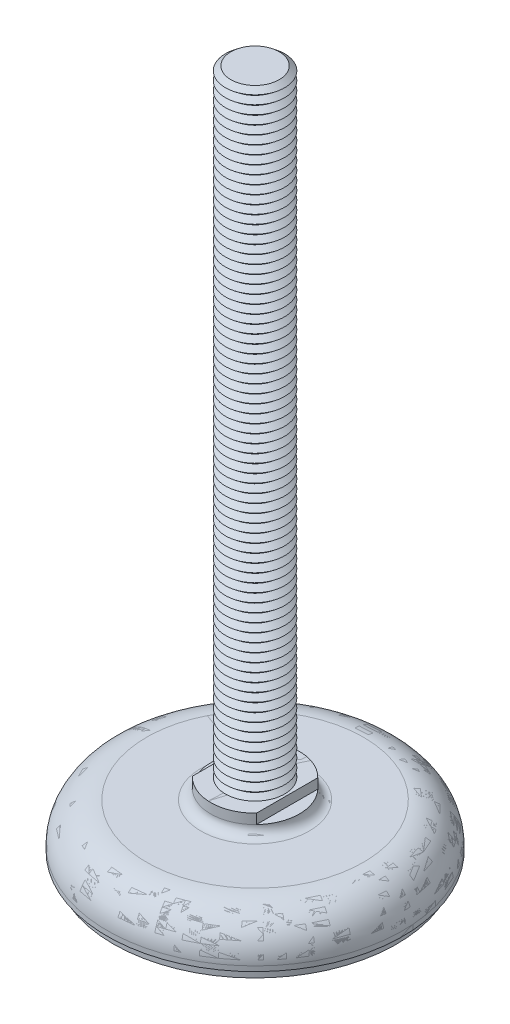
ISO-10303-21;
HEADER;
FILE_DESCRIPTION(('STEP AP214'),'2;1');
FILE_NAME('part.step','',(''),(''),'','','');
FILE_SCHEMA(('AUTOMOTIVE_DESIGN { 1 0 10303 214 1 1 1 1 }'));
ENDSEC;
DATA;
#1=APPLICATION_CONTEXT('core data for automotive mechanical design processes');
#2=APPLICATION_PROTOCOL_DEFINITION('international standard','automotive_design',2000,#1);
#3=PRODUCT_CONTEXT('',#1,'mechanical');
#4=PRODUCT('Part','Part','',(#3));
#5=PRODUCT_RELATED_PRODUCT_CATEGORY('part','',(#4));
#6=PRODUCT_DEFINITION_FORMATION('','',#4);
#7=PRODUCT_DEFINITION_CONTEXT('part definition',#1,'design');
#8=PRODUCT_DEFINITION('design','',#6,#7);
#9=PRODUCT_DEFINITION_SHAPE('','',#8);
#10=(LENGTH_UNIT() NAMED_UNIT(*) SI_UNIT(.MILLI.,.METRE.));
#11=(NAMED_UNIT(*) PLANE_ANGLE_UNIT() SI_UNIT($,.RADIAN.));
#12=(NAMED_UNIT(*) SI_UNIT($,.STERADIAN.) SOLID_ANGLE_UNIT());
#13=UNCERTAINTY_MEASURE_WITH_UNIT(LENGTH_MEASURE(1.E-05),#10,'distance_accuracy_value','');
#14=(GEOMETRIC_REPRESENTATION_CONTEXT(3) GLOBAL_UNCERTAINTY_ASSIGNED_CONTEXT((#13)) GLOBAL_UNIT_ASSIGNED_CONTEXT((#10,
#11,#12)) REPRESENTATION_CONTEXT('',''));
#15=CARTESIAN_POINT('',(0.,0.,0.));
#16=DIRECTION('',(0.,0.,1.));
#17=DIRECTION('',(1.,0.,0.));
#18=AXIS2_PLACEMENT_3D('',#15,#16,#17);
#19=CARTESIAN_POINT('',(0.,135.25,0.));
#20=DIRECTION('',(0.,-1.,0.));
#21=DIRECTION('',(0.998136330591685,0.,-0.0610234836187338));
#22=AXIS2_PLACEMENT_3D('',#19,#20,#21);
#23=CONICAL_SURFACE('',#22,4.90712535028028,0.895664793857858);
#24=CARTESIAN_POINT('',(0.,134.375,0.));
#25=DIRECTION('',(0.,-1.,0.));
#26=DIRECTION('',(0.998136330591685,0.,-0.0610234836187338));
#27=AXIS2_PLACEMENT_3D('',#24,#25,#26);
#28=CIRCLE('',#27,6.);
#29=CARTESIAN_POINT('',(5.98881798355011,134.375,-0.366140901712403));
#30=VERTEX_POINT('',#29);
#31=EDGE_CURVE('P0_E37',#30,#30,#28,.T.);
#32=ORIENTED_EDGE('',*,*,#31,.F.);
#33=EDGE_LOOP('',(#32));
#34=FACE_BOUND('',#33,.T.);
#35=CARTESIAN_POINT('',(0.,135.25,0.));
#36=DIRECTION('',(0.,-1.,0.));
#37=DIRECTION('',(0.998136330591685,0.,-0.0610234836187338));
#38=AXIS2_PLACEMENT_3D('',#35,#36,#37);
#39=CIRCLE('',#38,4.90712535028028);
#40=CARTESIAN_POINT('',(4.8979800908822,135.25,-0.299449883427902));
#41=VERTEX_POINT('',#40);
#42=EDGE_CURVE('P0_E25',#41,#41,#39,.T.);
#43=ORIENTED_EDGE('',*,*,#42,.T.);
#44=EDGE_LOOP('',(#43));
#45=FACE_BOUND('',#44,.T.);
#46=ADVANCED_FACE('P0_F14',(#34,#45),#23,.T.);
#47=CARTESIAN_POINT('',(0.,136.125,0.));
#48=DIRECTION('',(0.,1.,0.));
#49=DIRECTION('',(-0.998136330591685,0.,0.0610234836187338));
#50=AXIS2_PLACEMENT_3D('',#47,#48,#49);
#51=CONICAL_SURFACE('',#50,6.,0.895664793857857);
#52=ORIENTED_EDGE('',*,*,#42,.F.);
#53=EDGE_LOOP('',(#52));
#54=FACE_BOUND('',#53,.T.);
#55=CARTESIAN_POINT('',(0.,136.125,0.));
#56=DIRECTION('',(0.,-1.,0.));
#57=DIRECTION('',(0.998136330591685,0.,-0.0610234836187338));
#58=AXIS2_PLACEMENT_3D('',#55,#56,#57);
#59=CIRCLE('',#58,6.);
#60=CARTESIAN_POINT('',(5.98881798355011,136.125,-0.366140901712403));
#61=VERTEX_POINT('',#60);
#62=EDGE_CURVE('P0_E29',#61,#61,#59,.T.);
#63=ORIENTED_EDGE('',*,*,#62,.T.);
#64=EDGE_LOOP('',(#63));
#65=FACE_BOUND('',#64,.T.);
#66=ADVANCED_FACE('P0_F1375',(#54,#65),#51,.T.);
#67=CARTESIAN_POINT('',(0.,137.,0.));
#68=DIRECTION('',(0.,1.,0.));
#69=DIRECTION('',(-0.998136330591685,0.,0.0610234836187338));
#70=AXIS2_PLACEMENT_3D('',#67,#68,#69);
#71=PLANE('',#70);
#72=CARTESIAN_POINT('',(0.,137.,0.));
#73=DIRECTION('',(0.,-1.,0.));
#74=DIRECTION('',(0.998136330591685,0.,-0.0610234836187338));
#75=AXIS2_PLACEMENT_3D('',#72,#73,#74);
#76=CIRCLE('',#75,4.90712535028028);
#77=CARTESIAN_POINT('',(4.8979800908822,137.,-0.299449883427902));
#78=VERTEX_POINT('',#77);
#79=EDGE_CURVE('P0_E21',#78,#78,#76,.T.);
#80=ORIENTED_EDGE('',*,*,#79,.F.);
#81=EDGE_LOOP('',(#80));
#82=FACE_BOUND('',#81,.T.);
#83=ADVANCED_FACE('P0_F1381',(#82),#71,.T.);
#84=CARTESIAN_POINT('',(0.,137.,0.));
#85=DIRECTION('',(0.,-1.,0.));
#86=DIRECTION('',(0.998136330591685,0.,-0.0610234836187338));
#87=AXIS2_PLACEMENT_3D('',#84,#85,#86);
#88=CONICAL_SURFACE('',#87,4.90712535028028,0.895664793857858);
#89=ORIENTED_EDGE('',*,*,#62,.F.);
#90=EDGE_LOOP('',(#89));
#91=FACE_BOUND('',#90,.T.);
#92=ORIENTED_EDGE('',*,*,#79,.T.);
#93=EDGE_LOOP('',(#92));
#94=FACE_BOUND('',#93,.T.);
#95=ADVANCED_FACE('P0_F1364',(#91,#94),#88,.T.);
#96=CARTESIAN_POINT('',(0.,133.5,0.));
#97=DIRECTION('',(0.,-1.,0.));
#98=DIRECTION('',(0.998136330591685,0.,-0.0610234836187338));
#99=AXIS2_PLACEMENT_3D('',#96,#97,#98);
#100=CONICAL_SURFACE('',#99,4.90712535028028,0.895664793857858);
#101=CARTESIAN_POINT('',(0.,132.625,0.));
#102=DIRECTION('',(0.,-1.,0.));
#103=DIRECTION('',(0.998136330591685,0.,-0.0610234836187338));
#104=AXIS2_PLACEMENT_3D('',#101,#102,#103);
#105=CIRCLE('',#104,6.);
#106=CARTESIAN_POINT('',(5.98881798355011,132.625,-0.366140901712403));
#107=VERTEX_POINT('',#106);
#108=EDGE_CURVE('P0_E43',#107,#107,#105,.T.);
#109=ORIENTED_EDGE('',*,*,#108,.F.);
#110=EDGE_LOOP('',(#109));
#111=FACE_BOUND('',#110,.T.);
#112=CARTESIAN_POINT('',(0.,133.5,0.));
#113=DIRECTION('',(0.,-1.,0.));
#114=DIRECTION('',(0.998136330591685,0.,-0.0610234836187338));
#115=AXIS2_PLACEMENT_3D('',#112,#113,#114);
#116=CIRCLE('',#115,4.90712535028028);
#117=CARTESIAN_POINT('',(4.8979800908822,133.5,-0.299449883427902));
#118=VERTEX_POINT('',#117);
#119=EDGE_CURVE('P0_E34',#118,#118,#116,.T.);
#120=ORIENTED_EDGE('',*,*,#119,.T.);
#121=EDGE_LOOP('',(#120));
#122=FACE_BOUND('',#121,.T.);
#123=ADVANCED_FACE('P0_F1361',(#111,#122),#100,.T.);
#124=CARTESIAN_POINT('',(0.,134.375,0.));
#125=DIRECTION('',(0.,1.,0.));
#126=DIRECTION('',(-0.998136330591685,0.,0.0610234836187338));
#127=AXIS2_PLACEMENT_3D('',#124,#125,#126);
#128=CONICAL_SURFACE('',#127,6.,0.895664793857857);
#129=ORIENTED_EDGE('',*,*,#119,.F.);
#130=EDGE_LOOP('',(#129));
#131=FACE_BOUND('',#130,.T.);
#132=ORIENTED_EDGE('',*,*,#31,.T.);
#133=EDGE_LOOP('',(#132));
#134=FACE_BOUND('',#133,.T.);
#135=ADVANCED_FACE('P0_F1352',(#131,#134),#128,.T.);
#136=CARTESIAN_POINT('',(0.,131.75,0.));
#137=DIRECTION('',(0.,-1.,0.));
#138=DIRECTION('',(0.998136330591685,0.,-0.0610234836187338));
#139=AXIS2_PLACEMENT_3D('',#136,#137,#138);
#140=CONICAL_SURFACE('',#139,4.90712535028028,0.895664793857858);
#141=CARTESIAN_POINT('',(0.,130.875,0.));
#142=DIRECTION('',(0.,-1.,0.));
#143=DIRECTION('',(0.998136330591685,0.,-0.0610234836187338));
#144=AXIS2_PLACEMENT_3D('',#141,#142,#143);
#145=CIRCLE('',#144,6.);
#146=CARTESIAN_POINT('',(5.98881798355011,130.875,-0.366140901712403));
#147=VERTEX_POINT('',#146);
#148=EDGE_CURVE('P0_E49',#147,#147,#145,.T.);
#149=ORIENTED_EDGE('',*,*,#148,.F.);
#150=EDGE_LOOP('',(#149));
#151=FACE_BOUND('',#150,.T.);
#152=CARTESIAN_POINT('',(0.,131.75,0.));
#153=DIRECTION('',(0.,-1.,0.));
#154=DIRECTION('',(0.998136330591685,0.,-0.0610234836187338));
#155=AXIS2_PLACEMENT_3D('',#152,#153,#154);
#156=CIRCLE('',#155,4.90712535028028);
#157=CARTESIAN_POINT('',(4.8979800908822,131.75,-0.299449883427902));
#158=VERTEX_POINT('',#157);
#159=EDGE_CURVE('P0_E40',#158,#158,#156,.T.);
#160=ORIENTED_EDGE('',*,*,#159,.T.);
#161=EDGE_LOOP('',(#160));
#162=FACE_BOUND('',#161,.T.);
#163=ADVANCED_FACE('P0_F1349',(#151,#162),#140,.T.);
#164=CARTESIAN_POINT('',(0.,132.625,0.));
#165=DIRECTION('',(0.,1.,0.));
#166=DIRECTION('',(-0.998136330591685,0.,0.0610234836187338));
#167=AXIS2_PLACEMENT_3D('',#164,#165,#166);
#168=CONICAL_SURFACE('',#167,6.,0.895664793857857);
#169=ORIENTED_EDGE('',*,*,#159,.F.);
#170=EDGE_LOOP('',(#169));
#171=FACE_BOUND('',#170,.T.);
#172=ORIENTED_EDGE('',*,*,#108,.T.);
#173=EDGE_LOOP('',(#172));
#174=FACE_BOUND('',#173,.T.);
#175=ADVANCED_FACE('P0_F1340',(#171,#174),#168,.T.);
#176=CARTESIAN_POINT('',(0.,130.,0.));
#177=DIRECTION('',(0.,-1.,0.));
#178=DIRECTION('',(0.998136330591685,0.,-0.0610234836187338));
#179=AXIS2_PLACEMENT_3D('',#176,#177,#178);
#180=CONICAL_SURFACE('',#179,4.90712535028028,0.895664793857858);
#181=CARTESIAN_POINT('',(0.,129.125,0.));
#182=DIRECTION('',(0.,-1.,0.));
#183=DIRECTION('',(0.998136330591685,0.,-0.0610234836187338));
#184=AXIS2_PLACEMENT_3D('',#181,#182,#183);
#185=CIRCLE('',#184,6.);
#186=CARTESIAN_POINT('',(5.98881798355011,129.125,-0.366140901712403));
#187=VERTEX_POINT('',#186);
#188=EDGE_CURVE('P0_E55',#187,#187,#185,.T.);
#189=ORIENTED_EDGE('',*,*,#188,.F.);
#190=EDGE_LOOP('',(#189));
#191=FACE_BOUND('',#190,.T.);
#192=CARTESIAN_POINT('',(0.,130.,0.));
#193=DIRECTION('',(0.,-1.,0.));
#194=DIRECTION('',(0.998136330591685,0.,-0.0610234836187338));
#195=AXIS2_PLACEMENT_3D('',#192,#193,#194);
#196=CIRCLE('',#195,4.90712535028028);
#197=CARTESIAN_POINT('',(4.8979800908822,130.,-0.299449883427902));
#198=VERTEX_POINT('',#197);
#199=EDGE_CURVE('P0_E46',#198,#198,#196,.T.);
#200=ORIENTED_EDGE('',*,*,#199,.T.);
#201=EDGE_LOOP('',(#200));
#202=FACE_BOUND('',#201,.T.);
#203=ADVANCED_FACE('P0_F1337',(#191,#202),#180,.T.);
#204=CARTESIAN_POINT('',(0.,130.875,0.));
#205=DIRECTION('',(0.,1.,0.));
#206=DIRECTION('',(-0.998136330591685,0.,0.0610234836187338));
#207=AXIS2_PLACEMENT_3D('',#204,#205,#206);
#208=CONICAL_SURFACE('',#207,6.,0.895664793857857);
#209=ORIENTED_EDGE('',*,*,#199,.F.);
#210=EDGE_LOOP('',(#209));
#211=FACE_BOUND('',#210,.T.);
#212=ORIENTED_EDGE('',*,*,#148,.T.);
#213=EDGE_LOOP('',(#212));
#214=FACE_BOUND('',#213,.T.);
#215=ADVANCED_FACE('P0_F1328',(#211,#214),#208,.T.);
#216=CARTESIAN_POINT('',(0.,128.25,0.));
#217=DIRECTION('',(0.,-1.,0.));
#218=DIRECTION('',(0.998136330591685,0.,-0.0610234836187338));
#219=AXIS2_PLACEMENT_3D('',#216,#217,#218);
#220=CONICAL_SURFACE('',#219,4.90712535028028,0.895664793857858);
#221=CARTESIAN_POINT('',(0.,127.375,0.));
#222=DIRECTION('',(0.,-1.,0.));
#223=DIRECTION('',(0.998136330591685,0.,-0.0610234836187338));
#224=AXIS2_PLACEMENT_3D('',#221,#222,#223);
#225=CIRCLE('',#224,6.);
#226=CARTESIAN_POINT('',(5.98881798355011,127.375,-0.366140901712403));
#227=VERTEX_POINT('',#226);
#228=EDGE_CURVE('P0_E61',#227,#227,#225,.T.);
#229=ORIENTED_EDGE('',*,*,#228,.F.);
#230=EDGE_LOOP('',(#229));
#231=FACE_BOUND('',#230,.T.);
#232=CARTESIAN_POINT('',(0.,128.25,0.));
#233=DIRECTION('',(0.,-1.,0.));
#234=DIRECTION('',(0.998136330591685,0.,-0.0610234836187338));
#235=AXIS2_PLACEMENT_3D('',#232,#233,#234);
#236=CIRCLE('',#235,4.90712535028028);
#237=CARTESIAN_POINT('',(4.8979800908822,128.25,-0.299449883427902));
#238=VERTEX_POINT('',#237);
#239=EDGE_CURVE('P0_E52',#238,#238,#236,.T.);
#240=ORIENTED_EDGE('',*,*,#239,.T.);
#241=EDGE_LOOP('',(#240));
#242=FACE_BOUND('',#241,.T.);
#243=ADVANCED_FACE('P0_F1325',(#231,#242),#220,.T.);
#244=CARTESIAN_POINT('',(0.,129.125,0.));
#245=DIRECTION('',(0.,1.,0.));
#246=DIRECTION('',(-0.998136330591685,0.,0.0610234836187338));
#247=AXIS2_PLACEMENT_3D('',#244,#245,#246);
#248=CONICAL_SURFACE('',#247,6.,0.895664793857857);
#249=ORIENTED_EDGE('',*,*,#239,.F.);
#250=EDGE_LOOP('',(#249));
#251=FACE_BOUND('',#250,.T.);
#252=ORIENTED_EDGE('',*,*,#188,.T.);
#253=EDGE_LOOP('',(#252));
#254=FACE_BOUND('',#253,.T.);
#255=ADVANCED_FACE('P0_F1316',(#251,#254),#248,.T.);
#256=CARTESIAN_POINT('',(0.,126.5,0.));
#257=DIRECTION('',(0.,-1.,0.));
#258=DIRECTION('',(0.998136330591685,0.,-0.0610234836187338));
#259=AXIS2_PLACEMENT_3D('',#256,#257,#258);
#260=CONICAL_SURFACE('',#259,4.90712535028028,0.895664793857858);
#261=CARTESIAN_POINT('',(0.,125.625,0.));
#262=DIRECTION('',(0.,-1.,0.));
#263=DIRECTION('',(0.998136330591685,0.,-0.0610234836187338));
#264=AXIS2_PLACEMENT_3D('',#261,#262,#263);
#265=CIRCLE('',#264,6.);
#266=CARTESIAN_POINT('',(5.98881798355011,125.625,-0.366140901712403));
#267=VERTEX_POINT('',#266);
#268=EDGE_CURVE('P0_E67',#267,#267,#265,.T.);
#269=ORIENTED_EDGE('',*,*,#268,.F.);
#270=EDGE_LOOP('',(#269));
#271=FACE_BOUND('',#270,.T.);
#272=CARTESIAN_POINT('',(0.,126.5,0.));
#273=DIRECTION('',(0.,-1.,0.));
#274=DIRECTION('',(0.998136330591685,0.,-0.0610234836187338));
#275=AXIS2_PLACEMENT_3D('',#272,#273,#274);
#276=CIRCLE('',#275,4.90712535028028);
#277=CARTESIAN_POINT('',(4.8979800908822,126.5,-0.299449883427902));
#278=VERTEX_POINT('',#277);
#279=EDGE_CURVE('P0_E58',#278,#278,#276,.T.);
#280=ORIENTED_EDGE('',*,*,#279,.T.);
#281=EDGE_LOOP('',(#280));
#282=FACE_BOUND('',#281,.T.);
#283=ADVANCED_FACE('P0_F1313',(#271,#282),#260,.T.);
#284=CARTESIAN_POINT('',(0.,127.375,0.));
#285=DIRECTION('',(0.,1.,0.));
#286=DIRECTION('',(-0.998136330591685,0.,0.0610234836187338));
#287=AXIS2_PLACEMENT_3D('',#284,#285,#286);
#288=CONICAL_SURFACE('',#287,6.,0.895664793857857);
#289=ORIENTED_EDGE('',*,*,#279,.F.);
#290=EDGE_LOOP('',(#289));
#291=FACE_BOUND('',#290,.T.);
#292=ORIENTED_EDGE('',*,*,#228,.T.);
#293=EDGE_LOOP('',(#292));
#294=FACE_BOUND('',#293,.T.);
#295=ADVANCED_FACE('P0_F1304',(#291,#294),#288,.T.);
#296=CARTESIAN_POINT('',(0.,124.75,0.));
#297=DIRECTION('',(0.,-1.,0.));
#298=DIRECTION('',(0.998136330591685,0.,-0.0610234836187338));
#299=AXIS2_PLACEMENT_3D('',#296,#297,#298);
#300=CONICAL_SURFACE('',#299,4.90712535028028,0.895664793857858);
#301=CARTESIAN_POINT('',(0.,123.875,0.));
#302=DIRECTION('',(0.,-1.,0.));
#303=DIRECTION('',(0.998136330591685,0.,-0.0610234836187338));
#304=AXIS2_PLACEMENT_3D('',#301,#302,#303);
#305=CIRCLE('',#304,6.);
#306=CARTESIAN_POINT('',(5.98881798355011,123.875,-0.366140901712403));
#307=VERTEX_POINT('',#306);
#308=EDGE_CURVE('P0_E73',#307,#307,#305,.T.);
#309=ORIENTED_EDGE('',*,*,#308,.F.);
#310=EDGE_LOOP('',(#309));
#311=FACE_BOUND('',#310,.T.);
#312=CARTESIAN_POINT('',(0.,124.75,0.));
#313=DIRECTION('',(0.,-1.,0.));
#314=DIRECTION('',(0.998136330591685,0.,-0.0610234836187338));
#315=AXIS2_PLACEMENT_3D('',#312,#313,#314);
#316=CIRCLE('',#315,4.90712535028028);
#317=CARTESIAN_POINT('',(4.8979800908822,124.75,-0.299449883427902));
#318=VERTEX_POINT('',#317);
#319=EDGE_CURVE('P0_E64',#318,#318,#316,.T.);
#320=ORIENTED_EDGE('',*,*,#319,.T.);
#321=EDGE_LOOP('',(#320));
#322=FACE_BOUND('',#321,.T.);
#323=ADVANCED_FACE('P0_F1301',(#311,#322),#300,.T.);
#324=CARTESIAN_POINT('',(0.,125.625,0.));
#325=DIRECTION('',(0.,1.,0.));
#326=DIRECTION('',(-0.998136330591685,0.,0.0610234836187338));
#327=AXIS2_PLACEMENT_3D('',#324,#325,#326);
#328=CONICAL_SURFACE('',#327,6.,0.895664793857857);
#329=ORIENTED_EDGE('',*,*,#319,.F.);
#330=EDGE_LOOP('',(#329));
#331=FACE_BOUND('',#330,.T.);
#332=ORIENTED_EDGE('',*,*,#268,.T.);
#333=EDGE_LOOP('',(#332));
#334=FACE_BOUND('',#333,.T.);
#335=ADVANCED_FACE('P0_F1292',(#331,#334),#328,.T.);
#336=CARTESIAN_POINT('',(0.,123.,0.));
#337=DIRECTION('',(0.,-1.,0.));
#338=DIRECTION('',(0.998136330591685,0.,-0.0610234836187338));
#339=AXIS2_PLACEMENT_3D('',#336,#337,#338);
#340=CONICAL_SURFACE('',#339,4.90712535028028,0.895664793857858);
#341=CARTESIAN_POINT('',(0.,122.125,0.));
#342=DIRECTION('',(0.,-1.,0.));
#343=DIRECTION('',(0.998136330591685,0.,-0.0610234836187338));
#344=AXIS2_PLACEMENT_3D('',#341,#342,#343);
#345=CIRCLE('',#344,6.);
#346=CARTESIAN_POINT('',(5.98881798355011,122.125,-0.366140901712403));
#347=VERTEX_POINT('',#346);
#348=EDGE_CURVE('P0_E79',#347,#347,#345,.T.);
#349=ORIENTED_EDGE('',*,*,#348,.F.);
#350=EDGE_LOOP('',(#349));
#351=FACE_BOUND('',#350,.T.);
#352=CARTESIAN_POINT('',(0.,123.,0.));
#353=DIRECTION('',(0.,-1.,0.));
#354=DIRECTION('',(0.998136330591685,0.,-0.0610234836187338));
#355=AXIS2_PLACEMENT_3D('',#352,#353,#354);
#356=CIRCLE('',#355,4.90712535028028);
#357=CARTESIAN_POINT('',(4.8979800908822,123.,-0.299449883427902));
#358=VERTEX_POINT('',#357);
#359=EDGE_CURVE('P0_E70',#358,#358,#356,.T.);
#360=ORIENTED_EDGE('',*,*,#359,.T.);
#361=EDGE_LOOP('',(#360));
#362=FACE_BOUND('',#361,.T.);
#363=ADVANCED_FACE('P0_F1289',(#351,#362),#340,.T.);
#364=CARTESIAN_POINT('',(0.,123.875,0.));
#365=DIRECTION('',(0.,1.,0.));
#366=DIRECTION('',(-0.998136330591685,0.,0.0610234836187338));
#367=AXIS2_PLACEMENT_3D('',#364,#365,#366);
#368=CONICAL_SURFACE('',#367,6.,0.895664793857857);
#369=ORIENTED_EDGE('',*,*,#359,.F.);
#370=EDGE_LOOP('',(#369));
#371=FACE_BOUND('',#370,.T.);
#372=ORIENTED_EDGE('',*,*,#308,.T.);
#373=EDGE_LOOP('',(#372));
#374=FACE_BOUND('',#373,.T.);
#375=ADVANCED_FACE('P0_F1280',(#371,#374),#368,.T.);
#376=CARTESIAN_POINT('',(0.,121.25,0.));
#377=DIRECTION('',(0.,-1.,0.));
#378=DIRECTION('',(0.998136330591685,0.,-0.0610234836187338));
#379=AXIS2_PLACEMENT_3D('',#376,#377,#378);
#380=CONICAL_SURFACE('',#379,4.90712535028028,0.895664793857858);
#381=CARTESIAN_POINT('',(0.,120.375,0.));
#382=DIRECTION('',(0.,-1.,0.));
#383=DIRECTION('',(0.998136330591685,0.,-0.0610234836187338));
#384=AXIS2_PLACEMENT_3D('',#381,#382,#383);
#385=CIRCLE('',#384,6.);
#386=CARTESIAN_POINT('',(5.98881798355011,120.375,-0.366140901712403));
#387=VERTEX_POINT('',#386);
#388=EDGE_CURVE('P0_E85',#387,#387,#385,.T.);
#389=ORIENTED_EDGE('',*,*,#388,.F.);
#390=EDGE_LOOP('',(#389));
#391=FACE_BOUND('',#390,.T.);
#392=CARTESIAN_POINT('',(0.,121.25,0.));
#393=DIRECTION('',(0.,-1.,0.));
#394=DIRECTION('',(0.998136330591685,0.,-0.0610234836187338));
#395=AXIS2_PLACEMENT_3D('',#392,#393,#394);
#396=CIRCLE('',#395,4.90712535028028);
#397=CARTESIAN_POINT('',(4.8979800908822,121.25,-0.299449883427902));
#398=VERTEX_POINT('',#397);
#399=EDGE_CURVE('P0_E76',#398,#398,#396,.T.);
#400=ORIENTED_EDGE('',*,*,#399,.T.);
#401=EDGE_LOOP('',(#400));
#402=FACE_BOUND('',#401,.T.);
#403=ADVANCED_FACE('P0_F1277',(#391,#402),#380,.T.);
#404=CARTESIAN_POINT('',(0.,122.125,0.));
#405=DIRECTION('',(0.,1.,0.));
#406=DIRECTION('',(-0.998136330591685,0.,0.0610234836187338));
#407=AXIS2_PLACEMENT_3D('',#404,#405,#406);
#408=CONICAL_SURFACE('',#407,6.,0.895664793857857);
#409=ORIENTED_EDGE('',*,*,#399,.F.);
#410=EDGE_LOOP('',(#409));
#411=FACE_BOUND('',#410,.T.);
#412=ORIENTED_EDGE('',*,*,#348,.T.);
#413=EDGE_LOOP('',(#412));
#414=FACE_BOUND('',#413,.T.);
#415=ADVANCED_FACE('P0_F1268',(#411,#414),#408,.T.);
#416=CARTESIAN_POINT('',(0.,119.5,0.));
#417=DIRECTION('',(0.,-1.,0.));
#418=DIRECTION('',(0.998136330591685,0.,-0.0610234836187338));
#419=AXIS2_PLACEMENT_3D('',#416,#417,#418);
#420=CONICAL_SURFACE('',#419,4.90712535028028,0.895664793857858);
#421=CARTESIAN_POINT('',(0.,118.625,0.));
#422=DIRECTION('',(0.,-1.,0.));
#423=DIRECTION('',(0.998136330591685,0.,-0.0610234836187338));
#424=AXIS2_PLACEMENT_3D('',#421,#422,#423);
#425=CIRCLE('',#424,6.);
#426=CARTESIAN_POINT('',(5.98881798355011,118.625,-0.366140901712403));
#427=VERTEX_POINT('',#426);
#428=EDGE_CURVE('P0_E91',#427,#427,#425,.T.);
#429=ORIENTED_EDGE('',*,*,#428,.F.);
#430=EDGE_LOOP('',(#429));
#431=FACE_BOUND('',#430,.T.);
#432=CARTESIAN_POINT('',(0.,119.5,0.));
#433=DIRECTION('',(0.,-1.,0.));
#434=DIRECTION('',(0.998136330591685,0.,-0.0610234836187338));
#435=AXIS2_PLACEMENT_3D('',#432,#433,#434);
#436=CIRCLE('',#435,4.90712535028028);
#437=CARTESIAN_POINT('',(4.8979800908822,119.5,-0.299449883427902));
#438=VERTEX_POINT('',#437);
#439=EDGE_CURVE('P0_E82',#438,#438,#436,.T.);
#440=ORIENTED_EDGE('',*,*,#439,.T.);
#441=EDGE_LOOP('',(#440));
#442=FACE_BOUND('',#441,.T.);
#443=ADVANCED_FACE('P0_F1265',(#431,#442),#420,.T.);
#444=CARTESIAN_POINT('',(0.,120.375,0.));
#445=DIRECTION('',(0.,1.,0.));
#446=DIRECTION('',(-0.998136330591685,0.,0.0610234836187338));
#447=AXIS2_PLACEMENT_3D('',#444,#445,#446);
#448=CONICAL_SURFACE('',#447,6.,0.895664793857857);
#449=ORIENTED_EDGE('',*,*,#439,.F.);
#450=EDGE_LOOP('',(#449));
#451=FACE_BOUND('',#450,.T.);
#452=ORIENTED_EDGE('',*,*,#388,.T.);
#453=EDGE_LOOP('',(#452));
#454=FACE_BOUND('',#453,.T.);
#455=ADVANCED_FACE('P0_F1256',(#451,#454),#448,.T.);
#456=CARTESIAN_POINT('',(0.,117.75,0.));
#457=DIRECTION('',(0.,-1.,0.));
#458=DIRECTION('',(0.998136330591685,0.,-0.0610234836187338));
#459=AXIS2_PLACEMENT_3D('',#456,#457,#458);
#460=CONICAL_SURFACE('',#459,4.90712535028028,0.895664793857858);
#461=CARTESIAN_POINT('',(0.,116.875,0.));
#462=DIRECTION('',(0.,-1.,0.));
#463=DIRECTION('',(0.998136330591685,0.,-0.0610234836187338));
#464=AXIS2_PLACEMENT_3D('',#461,#462,#463);
#465=CIRCLE('',#464,6.);
#466=CARTESIAN_POINT('',(5.98881798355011,116.875,-0.366140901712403));
#467=VERTEX_POINT('',#466);
#468=EDGE_CURVE('P0_E97',#467,#467,#465,.T.);
#469=ORIENTED_EDGE('',*,*,#468,.F.);
#470=EDGE_LOOP('',(#469));
#471=FACE_BOUND('',#470,.T.);
#472=CARTESIAN_POINT('',(0.,117.75,0.));
#473=DIRECTION('',(0.,-1.,0.));
#474=DIRECTION('',(0.998136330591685,0.,-0.0610234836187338));
#475=AXIS2_PLACEMENT_3D('',#472,#473,#474);
#476=CIRCLE('',#475,4.90712535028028);
#477=CARTESIAN_POINT('',(4.8979800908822,117.75,-0.299449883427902));
#478=VERTEX_POINT('',#477);
#479=EDGE_CURVE('P0_E88',#478,#478,#476,.T.);
#480=ORIENTED_EDGE('',*,*,#479,.T.);
#481=EDGE_LOOP('',(#480));
#482=FACE_BOUND('',#481,.T.);
#483=ADVANCED_FACE('P0_F1253',(#471,#482),#460,.T.);
#484=CARTESIAN_POINT('',(0.,118.625,0.));
#485=DIRECTION('',(0.,1.,0.));
#486=DIRECTION('',(-0.998136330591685,0.,0.0610234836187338));
#487=AXIS2_PLACEMENT_3D('',#484,#485,#486);
#488=CONICAL_SURFACE('',#487,6.,0.895664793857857);
#489=ORIENTED_EDGE('',*,*,#479,.F.);
#490=EDGE_LOOP('',(#489));
#491=FACE_BOUND('',#490,.T.);
#492=ORIENTED_EDGE('',*,*,#428,.T.);
#493=EDGE_LOOP('',(#492));
#494=FACE_BOUND('',#493,.T.);
#495=ADVANCED_FACE('P0_F1244',(#491,#494),#488,.T.);
#496=CARTESIAN_POINT('',(0.,116.,0.));
#497=DIRECTION('',(0.,-1.,0.));
#498=DIRECTION('',(0.998136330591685,0.,-0.0610234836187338));
#499=AXIS2_PLACEMENT_3D('',#496,#497,#498);
#500=CONICAL_SURFACE('',#499,4.90712535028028,0.895664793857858);
#501=CARTESIAN_POINT('',(0.,115.125,0.));
#502=DIRECTION('',(0.,-1.,0.));
#503=DIRECTION('',(0.998136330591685,0.,-0.0610234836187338));
#504=AXIS2_PLACEMENT_3D('',#501,#502,#503);
#505=CIRCLE('',#504,6.);
#506=CARTESIAN_POINT('',(5.98881798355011,115.125,-0.366140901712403));
#507=VERTEX_POINT('',#506);
#508=EDGE_CURVE('P0_E103',#507,#507,#505,.T.);
#509=ORIENTED_EDGE('',*,*,#508,.F.);
#510=EDGE_LOOP('',(#509));
#511=FACE_BOUND('',#510,.T.);
#512=CARTESIAN_POINT('',(0.,116.,0.));
#513=DIRECTION('',(0.,-1.,0.));
#514=DIRECTION('',(0.998136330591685,0.,-0.0610234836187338));
#515=AXIS2_PLACEMENT_3D('',#512,#513,#514);
#516=CIRCLE('',#515,4.90712535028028);
#517=CARTESIAN_POINT('',(4.8979800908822,116.,-0.299449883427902));
#518=VERTEX_POINT('',#517);
#519=EDGE_CURVE('P0_E94',#518,#518,#516,.T.);
#520=ORIENTED_EDGE('',*,*,#519,.T.);
#521=EDGE_LOOP('',(#520));
#522=FACE_BOUND('',#521,.T.);
#523=ADVANCED_FACE('P0_F1241',(#511,#522),#500,.T.);
#524=CARTESIAN_POINT('',(0.,116.875,0.));
#525=DIRECTION('',(0.,1.,0.));
#526=DIRECTION('',(-0.998136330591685,0.,0.0610234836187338));
#527=AXIS2_PLACEMENT_3D('',#524,#525,#526);
#528=CONICAL_SURFACE('',#527,6.,0.895664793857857);
#529=ORIENTED_EDGE('',*,*,#519,.F.);
#530=EDGE_LOOP('',(#529));
#531=FACE_BOUND('',#530,.T.);
#532=ORIENTED_EDGE('',*,*,#468,.T.);
#533=EDGE_LOOP('',(#532));
#534=FACE_BOUND('',#533,.T.);
#535=ADVANCED_FACE('P0_F1232',(#531,#534),#528,.T.);
#536=CARTESIAN_POINT('',(0.,114.25,0.));
#537=DIRECTION('',(0.,-1.,0.));
#538=DIRECTION('',(0.998136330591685,0.,-0.0610234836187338));
#539=AXIS2_PLACEMENT_3D('',#536,#537,#538);
#540=CONICAL_SURFACE('',#539,4.90712535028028,0.895664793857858);
#541=CARTESIAN_POINT('',(0.,113.375,0.));
#542=DIRECTION('',(0.,-1.,0.));
#543=DIRECTION('',(0.998136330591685,0.,-0.0610234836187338));
#544=AXIS2_PLACEMENT_3D('',#541,#542,#543);
#545=CIRCLE('',#544,6.);
#546=CARTESIAN_POINT('',(5.98881798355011,113.375,-0.366140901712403));
#547=VERTEX_POINT('',#546);
#548=EDGE_CURVE('P0_E109',#547,#547,#545,.T.);
#549=ORIENTED_EDGE('',*,*,#548,.F.);
#550=EDGE_LOOP('',(#549));
#551=FACE_BOUND('',#550,.T.);
#552=CARTESIAN_POINT('',(0.,114.25,0.));
#553=DIRECTION('',(0.,-1.,0.));
#554=DIRECTION('',(0.998136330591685,0.,-0.0610234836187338));
#555=AXIS2_PLACEMENT_3D('',#552,#553,#554);
#556=CIRCLE('',#555,4.90712535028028);
#557=CARTESIAN_POINT('',(4.8979800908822,114.25,-0.299449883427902));
#558=VERTEX_POINT('',#557);
#559=EDGE_CURVE('P0_E100',#558,#558,#556,.T.);
#560=ORIENTED_EDGE('',*,*,#559,.T.);
#561=EDGE_LOOP('',(#560));
#562=FACE_BOUND('',#561,.T.);
#563=ADVANCED_FACE('P0_F1229',(#551,#562),#540,.T.);
#564=CARTESIAN_POINT('',(0.,115.125,0.));
#565=DIRECTION('',(0.,1.,0.));
#566=DIRECTION('',(-0.998136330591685,0.,0.0610234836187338));
#567=AXIS2_PLACEMENT_3D('',#564,#565,#566);
#568=CONICAL_SURFACE('',#567,6.,0.895664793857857);
#569=ORIENTED_EDGE('',*,*,#559,.F.);
#570=EDGE_LOOP('',(#569));
#571=FACE_BOUND('',#570,.T.);
#572=ORIENTED_EDGE('',*,*,#508,.T.);
#573=EDGE_LOOP('',(#572));
#574=FACE_BOUND('',#573,.T.);
#575=ADVANCED_FACE('P0_F1220',(#571,#574),#568,.T.);
#576=CARTESIAN_POINT('',(0.,112.5,0.));
#577=DIRECTION('',(0.,-1.,0.));
#578=DIRECTION('',(0.998136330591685,0.,-0.0610234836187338));
#579=AXIS2_PLACEMENT_3D('',#576,#577,#578);
#580=CONICAL_SURFACE('',#579,4.90712535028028,0.895664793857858);
#581=CARTESIAN_POINT('',(0.,111.625,0.));
#582=DIRECTION('',(0.,-1.,0.));
#583=DIRECTION('',(0.998136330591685,0.,-0.0610234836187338));
#584=AXIS2_PLACEMENT_3D('',#581,#582,#583);
#585=CIRCLE('',#584,6.);
#586=CARTESIAN_POINT('',(5.98881798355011,111.625,-0.366140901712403));
#587=VERTEX_POINT('',#586);
#588=EDGE_CURVE('P0_E115',#587,#587,#585,.T.);
#589=ORIENTED_EDGE('',*,*,#588,.F.);
#590=EDGE_LOOP('',(#589));
#591=FACE_BOUND('',#590,.T.);
#592=CARTESIAN_POINT('',(0.,112.5,0.));
#593=DIRECTION('',(0.,-1.,0.));
#594=DIRECTION('',(0.998136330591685,0.,-0.0610234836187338));
#595=AXIS2_PLACEMENT_3D('',#592,#593,#594);
#596=CIRCLE('',#595,4.90712535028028);
#597=CARTESIAN_POINT('',(4.8979800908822,112.5,-0.299449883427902));
#598=VERTEX_POINT('',#597);
#599=EDGE_CURVE('P0_E106',#598,#598,#596,.T.);
#600=ORIENTED_EDGE('',*,*,#599,.T.);
#601=EDGE_LOOP('',(#600));
#602=FACE_BOUND('',#601,.T.);
#603=ADVANCED_FACE('P0_F1217',(#591,#602),#580,.T.);
#604=CARTESIAN_POINT('',(0.,113.375,0.));
#605=DIRECTION('',(0.,1.,0.));
#606=DIRECTION('',(-0.998136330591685,0.,0.0610234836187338));
#607=AXIS2_PLACEMENT_3D('',#604,#605,#606);
#608=CONICAL_SURFACE('',#607,6.,0.895664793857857);
#609=ORIENTED_EDGE('',*,*,#599,.F.);
#610=EDGE_LOOP('',(#609));
#611=FACE_BOUND('',#610,.T.);
#612=ORIENTED_EDGE('',*,*,#548,.T.);
#613=EDGE_LOOP('',(#612));
#614=FACE_BOUND('',#613,.T.);
#615=ADVANCED_FACE('P0_F1208',(#611,#614),#608,.T.);
#616=CARTESIAN_POINT('',(0.,110.75,0.));
#617=DIRECTION('',(0.,-1.,0.));
#618=DIRECTION('',(0.998136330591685,0.,-0.0610234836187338));
#619=AXIS2_PLACEMENT_3D('',#616,#617,#618);
#620=CONICAL_SURFACE('',#619,4.90712535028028,0.895664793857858);
#621=CARTESIAN_POINT('',(0.,109.875,0.));
#622=DIRECTION('',(0.,-1.,0.));
#623=DIRECTION('',(0.998136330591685,0.,-0.0610234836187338));
#624=AXIS2_PLACEMENT_3D('',#621,#622,#623);
#625=CIRCLE('',#624,6.);
#626=CARTESIAN_POINT('',(5.98881798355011,109.875,-0.366140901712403));
#627=VERTEX_POINT('',#626);
#628=EDGE_CURVE('P0_E121',#627,#627,#625,.T.);
#629=ORIENTED_EDGE('',*,*,#628,.F.);
#630=EDGE_LOOP('',(#629));
#631=FACE_BOUND('',#630,.T.);
#632=CARTESIAN_POINT('',(0.,110.75,0.));
#633=DIRECTION('',(0.,-1.,0.));
#634=DIRECTION('',(0.998136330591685,0.,-0.0610234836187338));
#635=AXIS2_PLACEMENT_3D('',#632,#633,#634);
#636=CIRCLE('',#635,4.90712535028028);
#637=CARTESIAN_POINT('',(4.8979800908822,110.75,-0.299449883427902));
#638=VERTEX_POINT('',#637);
#639=EDGE_CURVE('P0_E112',#638,#638,#636,.T.);
#640=ORIENTED_EDGE('',*,*,#639,.T.);
#641=EDGE_LOOP('',(#640));
#642=FACE_BOUND('',#641,.T.);
#643=ADVANCED_FACE('P0_F1205',(#631,#642),#620,.T.);
#644=CARTESIAN_POINT('',(0.,111.625,0.));
#645=DIRECTION('',(0.,1.,0.));
#646=DIRECTION('',(-0.998136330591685,0.,0.0610234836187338));
#647=AXIS2_PLACEMENT_3D('',#644,#645,#646);
#648=CONICAL_SURFACE('',#647,6.,0.895664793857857);
#649=ORIENTED_EDGE('',*,*,#639,.F.);
#650=EDGE_LOOP('',(#649));
#651=FACE_BOUND('',#650,.T.);
#652=ORIENTED_EDGE('',*,*,#588,.T.);
#653=EDGE_LOOP('',(#652));
#654=FACE_BOUND('',#653,.T.);
#655=ADVANCED_FACE('P0_F1196',(#651,#654),#648,.T.);
#656=CARTESIAN_POINT('',(0.,109.,0.));
#657=DIRECTION('',(0.,-1.,0.));
#658=DIRECTION('',(0.998136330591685,0.,-0.0610234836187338));
#659=AXIS2_PLACEMENT_3D('',#656,#657,#658);
#660=CONICAL_SURFACE('',#659,4.90712535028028,0.895664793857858);
#661=CARTESIAN_POINT('',(0.,108.125,0.));
#662=DIRECTION('',(0.,-1.,0.));
#663=DIRECTION('',(0.998136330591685,0.,-0.0610234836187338));
#664=AXIS2_PLACEMENT_3D('',#661,#662,#663);
#665=CIRCLE('',#664,6.);
#666=CARTESIAN_POINT('',(5.98881798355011,108.125,-0.366140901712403));
#667=VERTEX_POINT('',#666);
#668=EDGE_CURVE('P0_E127',#667,#667,#665,.T.);
#669=ORIENTED_EDGE('',*,*,#668,.F.);
#670=EDGE_LOOP('',(#669));
#671=FACE_BOUND('',#670,.T.);
#672=CARTESIAN_POINT('',(0.,109.,0.));
#673=DIRECTION('',(0.,-1.,0.));
#674=DIRECTION('',(0.998136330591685,0.,-0.0610234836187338));
#675=AXIS2_PLACEMENT_3D('',#672,#673,#674);
#676=CIRCLE('',#675,4.90712535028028);
#677=CARTESIAN_POINT('',(4.8979800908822,109.,-0.299449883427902));
#678=VERTEX_POINT('',#677);
#679=EDGE_CURVE('P0_E118',#678,#678,#676,.T.);
#680=ORIENTED_EDGE('',*,*,#679,.T.);
#681=EDGE_LOOP('',(#680));
#682=FACE_BOUND('',#681,.T.);
#683=ADVANCED_FACE('P0_F1193',(#671,#682),#660,.T.);
#684=CARTESIAN_POINT('',(0.,109.875,0.));
#685=DIRECTION('',(0.,1.,0.));
#686=DIRECTION('',(-0.998136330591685,0.,0.0610234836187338));
#687=AXIS2_PLACEMENT_3D('',#684,#685,#686);
#688=CONICAL_SURFACE('',#687,6.,0.895664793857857);
#689=ORIENTED_EDGE('',*,*,#679,.F.);
#690=EDGE_LOOP('',(#689));
#691=FACE_BOUND('',#690,.T.);
#692=ORIENTED_EDGE('',*,*,#628,.T.);
#693=EDGE_LOOP('',(#692));
#694=FACE_BOUND('',#693,.T.);
#695=ADVANCED_FACE('P0_F1184',(#691,#694),#688,.T.);
#696=CARTESIAN_POINT('',(0.,107.25,0.));
#697=DIRECTION('',(0.,-1.,0.));
#698=DIRECTION('',(0.998136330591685,0.,-0.0610234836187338));
#699=AXIS2_PLACEMENT_3D('',#696,#697,#698);
#700=CONICAL_SURFACE('',#699,4.90712535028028,0.895664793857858);
#701=CARTESIAN_POINT('',(0.,106.375,0.));
#702=DIRECTION('',(0.,-1.,0.));
#703=DIRECTION('',(0.998136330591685,0.,-0.0610234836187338));
#704=AXIS2_PLACEMENT_3D('',#701,#702,#703);
#705=CIRCLE('',#704,6.);
#706=CARTESIAN_POINT('',(5.98881798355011,106.375,-0.366140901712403));
#707=VERTEX_POINT('',#706);
#708=EDGE_CURVE('P0_E133',#707,#707,#705,.T.);
#709=ORIENTED_EDGE('',*,*,#708,.F.);
#710=EDGE_LOOP('',(#709));
#711=FACE_BOUND('',#710,.T.);
#712=CARTESIAN_POINT('',(0.,107.25,0.));
#713=DIRECTION('',(0.,-1.,0.));
#714=DIRECTION('',(0.998136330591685,0.,-0.0610234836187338));
#715=AXIS2_PLACEMENT_3D('',#712,#713,#714);
#716=CIRCLE('',#715,4.90712535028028);
#717=CARTESIAN_POINT('',(4.8979800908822,107.25,-0.299449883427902));
#718=VERTEX_POINT('',#717);
#719=EDGE_CURVE('P0_E124',#718,#718,#716,.T.);
#720=ORIENTED_EDGE('',*,*,#719,.T.);
#721=EDGE_LOOP('',(#720));
#722=FACE_BOUND('',#721,.T.);
#723=ADVANCED_FACE('P0_F1181',(#711,#722),#700,.T.);
#724=CARTESIAN_POINT('',(0.,108.125,0.));
#725=DIRECTION('',(0.,1.,0.));
#726=DIRECTION('',(-0.998136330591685,0.,0.0610234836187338));
#727=AXIS2_PLACEMENT_3D('',#724,#725,#726);
#728=CONICAL_SURFACE('',#727,6.,0.895664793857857);
#729=ORIENTED_EDGE('',*,*,#719,.F.);
#730=EDGE_LOOP('',(#729));
#731=FACE_BOUND('',#730,.T.);
#732=ORIENTED_EDGE('',*,*,#668,.T.);
#733=EDGE_LOOP('',(#732));
#734=FACE_BOUND('',#733,.T.);
#735=ADVANCED_FACE('P0_F1172',(#731,#734),#728,.T.);
#736=CARTESIAN_POINT('',(0.,105.5,0.));
#737=DIRECTION('',(0.,-1.,0.));
#738=DIRECTION('',(0.998136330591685,0.,-0.0610234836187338));
#739=AXIS2_PLACEMENT_3D('',#736,#737,#738);
#740=CONICAL_SURFACE('',#739,4.90712535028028,0.895664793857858);
#741=CARTESIAN_POINT('',(0.,104.625,0.));
#742=DIRECTION('',(0.,-1.,0.));
#743=DIRECTION('',(0.998136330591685,0.,-0.0610234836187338));
#744=AXIS2_PLACEMENT_3D('',#741,#742,#743);
#745=CIRCLE('',#744,6.);
#746=CARTESIAN_POINT('',(5.98881798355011,104.625,-0.366140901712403));
#747=VERTEX_POINT('',#746);
#748=EDGE_CURVE('P0_E139',#747,#747,#745,.T.);
#749=ORIENTED_EDGE('',*,*,#748,.F.);
#750=EDGE_LOOP('',(#749));
#751=FACE_BOUND('',#750,.T.);
#752=CARTESIAN_POINT('',(0.,105.5,0.));
#753=DIRECTION('',(0.,-1.,0.));
#754=DIRECTION('',(0.998136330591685,0.,-0.0610234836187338));
#755=AXIS2_PLACEMENT_3D('',#752,#753,#754);
#756=CIRCLE('',#755,4.90712535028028);
#757=CARTESIAN_POINT('',(4.8979800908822,105.5,-0.299449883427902));
#758=VERTEX_POINT('',#757);
#759=EDGE_CURVE('P0_E130',#758,#758,#756,.T.);
#760=ORIENTED_EDGE('',*,*,#759,.T.);
#761=EDGE_LOOP('',(#760));
#762=FACE_BOUND('',#761,.T.);
#763=ADVANCED_FACE('P0_F1169',(#751,#762),#740,.T.);
#764=CARTESIAN_POINT('',(0.,106.375,0.));
#765=DIRECTION('',(0.,1.,0.));
#766=DIRECTION('',(-0.998136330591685,0.,0.0610234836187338));
#767=AXIS2_PLACEMENT_3D('',#764,#765,#766);
#768=CONICAL_SURFACE('',#767,6.,0.895664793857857);
#769=ORIENTED_EDGE('',*,*,#759,.F.);
#770=EDGE_LOOP('',(#769));
#771=FACE_BOUND('',#770,.T.);
#772=ORIENTED_EDGE('',*,*,#708,.T.);
#773=EDGE_LOOP('',(#772));
#774=FACE_BOUND('',#773,.T.);
#775=ADVANCED_FACE('P0_F1160',(#771,#774),#768,.T.);
#776=CARTESIAN_POINT('',(0.,103.75,0.));
#777=DIRECTION('',(0.,-1.,0.));
#778=DIRECTION('',(0.998136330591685,0.,-0.0610234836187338));
#779=AXIS2_PLACEMENT_3D('',#776,#777,#778);
#780=CONICAL_SURFACE('',#779,4.90712535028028,0.895664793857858);
#781=CARTESIAN_POINT('',(0.,102.875,0.));
#782=DIRECTION('',(0.,-1.,0.));
#783=DIRECTION('',(0.998136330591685,0.,-0.0610234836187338));
#784=AXIS2_PLACEMENT_3D('',#781,#782,#783);
#785=CIRCLE('',#784,6.);
#786=CARTESIAN_POINT('',(5.98881798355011,102.875,-0.366140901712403));
#787=VERTEX_POINT('',#786);
#788=EDGE_CURVE('P0_E145',#787,#787,#785,.T.);
#789=ORIENTED_EDGE('',*,*,#788,.F.);
#790=EDGE_LOOP('',(#789));
#791=FACE_BOUND('',#790,.T.);
#792=CARTESIAN_POINT('',(0.,103.75,0.));
#793=DIRECTION('',(0.,-1.,0.));
#794=DIRECTION('',(0.998136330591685,0.,-0.0610234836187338));
#795=AXIS2_PLACEMENT_3D('',#792,#793,#794);
#796=CIRCLE('',#795,4.90712535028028);
#797=CARTESIAN_POINT('',(4.8979800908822,103.75,-0.299449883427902));
#798=VERTEX_POINT('',#797);
#799=EDGE_CURVE('P0_E136',#798,#798,#796,.T.);
#800=ORIENTED_EDGE('',*,*,#799,.T.);
#801=EDGE_LOOP('',(#800));
#802=FACE_BOUND('',#801,.T.);
#803=ADVANCED_FACE('P0_F1157',(#791,#802),#780,.T.);
#804=CARTESIAN_POINT('',(0.,104.625,0.));
#805=DIRECTION('',(0.,1.,0.));
#806=DIRECTION('',(-0.998136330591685,0.,0.0610234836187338));
#807=AXIS2_PLACEMENT_3D('',#804,#805,#806);
#808=CONICAL_SURFACE('',#807,6.,0.895664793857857);
#809=ORIENTED_EDGE('',*,*,#799,.F.);
#810=EDGE_LOOP('',(#809));
#811=FACE_BOUND('',#810,.T.);
#812=ORIENTED_EDGE('',*,*,#748,.T.);
#813=EDGE_LOOP('',(#812));
#814=FACE_BOUND('',#813,.T.);
#815=ADVANCED_FACE('P0_F1148',(#811,#814),#808,.T.);
#816=CARTESIAN_POINT('',(0.,102.,0.));
#817=DIRECTION('',(0.,-1.,0.));
#818=DIRECTION('',(0.998136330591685,0.,-0.0610234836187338));
#819=AXIS2_PLACEMENT_3D('',#816,#817,#818);
#820=CONICAL_SURFACE('',#819,4.90712535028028,0.895664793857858);
#821=CARTESIAN_POINT('',(0.,101.125,0.));
#822=DIRECTION('',(0.,-1.,0.));
#823=DIRECTION('',(0.998136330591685,0.,-0.0610234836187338));
#824=AXIS2_PLACEMENT_3D('',#821,#822,#823);
#825=CIRCLE('',#824,6.);
#826=CARTESIAN_POINT('',(5.98881798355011,101.125,-0.366140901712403));
#827=VERTEX_POINT('',#826);
#828=EDGE_CURVE('P0_E151',#827,#827,#825,.T.);
#829=ORIENTED_EDGE('',*,*,#828,.F.);
#830=EDGE_LOOP('',(#829));
#831=FACE_BOUND('',#830,.T.);
#832=CARTESIAN_POINT('',(0.,102.,0.));
#833=DIRECTION('',(0.,-1.,0.));
#834=DIRECTION('',(0.998136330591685,0.,-0.0610234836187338));
#835=AXIS2_PLACEMENT_3D('',#832,#833,#834);
#836=CIRCLE('',#835,4.90712535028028);
#837=CARTESIAN_POINT('',(4.8979800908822,102.,-0.299449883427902));
#838=VERTEX_POINT('',#837);
#839=EDGE_CURVE('P0_E142',#838,#838,#836,.T.);
#840=ORIENTED_EDGE('',*,*,#839,.T.);
#841=EDGE_LOOP('',(#840));
#842=FACE_BOUND('',#841,.T.);
#843=ADVANCED_FACE('P0_F1145',(#831,#842),#820,.T.);
#844=CARTESIAN_POINT('',(0.,102.875,0.));
#845=DIRECTION('',(0.,1.,0.));
#846=DIRECTION('',(-0.998136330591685,0.,0.0610234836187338));
#847=AXIS2_PLACEMENT_3D('',#844,#845,#846);
#848=CONICAL_SURFACE('',#847,6.,0.895664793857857);
#849=ORIENTED_EDGE('',*,*,#839,.F.);
#850=EDGE_LOOP('',(#849));
#851=FACE_BOUND('',#850,.T.);
#852=ORIENTED_EDGE('',*,*,#788,.T.);
#853=EDGE_LOOP('',(#852));
#854=FACE_BOUND('',#853,.T.);
#855=ADVANCED_FACE('P0_F1136',(#851,#854),#848,.T.);
#856=CARTESIAN_POINT('',(0.,100.25,0.));
#857=DIRECTION('',(0.,-1.,0.));
#858=DIRECTION('',(0.998136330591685,0.,-0.0610234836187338));
#859=AXIS2_PLACEMENT_3D('',#856,#857,#858);
#860=CONICAL_SURFACE('',#859,4.90712535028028,0.895664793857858);
#861=CARTESIAN_POINT('',(0.,99.375,0.));
#862=DIRECTION('',(0.,-1.,0.));
#863=DIRECTION('',(0.998136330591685,0.,-0.0610234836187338));
#864=AXIS2_PLACEMENT_3D('',#861,#862,#863);
#865=CIRCLE('',#864,6.);
#866=CARTESIAN_POINT('',(5.98881798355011,99.375,-0.366140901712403));
#867=VERTEX_POINT('',#866);
#868=EDGE_CURVE('P0_E157',#867,#867,#865,.T.);
#869=ORIENTED_EDGE('',*,*,#868,.F.);
#870=EDGE_LOOP('',(#869));
#871=FACE_BOUND('',#870,.T.);
#872=CARTESIAN_POINT('',(0.,100.25,0.));
#873=DIRECTION('',(0.,-1.,0.));
#874=DIRECTION('',(0.998136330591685,0.,-0.0610234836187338));
#875=AXIS2_PLACEMENT_3D('',#872,#873,#874);
#876=CIRCLE('',#875,4.90712535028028);
#877=CARTESIAN_POINT('',(4.8979800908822,100.25,-0.299449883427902));
#878=VERTEX_POINT('',#877);
#879=EDGE_CURVE('P0_E148',#878,#878,#876,.T.);
#880=ORIENTED_EDGE('',*,*,#879,.T.);
#881=EDGE_LOOP('',(#880));
#882=FACE_BOUND('',#881,.T.);
#883=ADVANCED_FACE('P0_F1133',(#871,#882),#860,.T.);
#884=CARTESIAN_POINT('',(0.,101.125,0.));
#885=DIRECTION('',(0.,1.,0.));
#886=DIRECTION('',(-0.998136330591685,0.,0.0610234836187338));
#887=AXIS2_PLACEMENT_3D('',#884,#885,#886);
#888=CONICAL_SURFACE('',#887,6.,0.895664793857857);
#889=ORIENTED_EDGE('',*,*,#879,.F.);
#890=EDGE_LOOP('',(#889));
#891=FACE_BOUND('',#890,.T.);
#892=ORIENTED_EDGE('',*,*,#828,.T.);
#893=EDGE_LOOP('',(#892));
#894=FACE_BOUND('',#893,.T.);
#895=ADVANCED_FACE('P0_F1124',(#891,#894),#888,.T.);
#896=CARTESIAN_POINT('',(0.,98.5,0.));
#897=DIRECTION('',(0.,-1.,0.));
#898=DIRECTION('',(0.998136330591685,0.,-0.0610234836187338));
#899=AXIS2_PLACEMENT_3D('',#896,#897,#898);
#900=CONICAL_SURFACE('',#899,4.90712535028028,0.895664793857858);
#901=CARTESIAN_POINT('',(0.,97.625,0.));
#902=DIRECTION('',(0.,-1.,0.));
#903=DIRECTION('',(0.998136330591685,0.,-0.0610234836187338));
#904=AXIS2_PLACEMENT_3D('',#901,#902,#903);
#905=CIRCLE('',#904,6.);
#906=CARTESIAN_POINT('',(5.98881798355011,97.625,-0.366140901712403));
#907=VERTEX_POINT('',#906);
#908=EDGE_CURVE('P0_E163',#907,#907,#905,.T.);
#909=ORIENTED_EDGE('',*,*,#908,.F.);
#910=EDGE_LOOP('',(#909));
#911=FACE_BOUND('',#910,.T.);
#912=CARTESIAN_POINT('',(0.,98.5,0.));
#913=DIRECTION('',(0.,-1.,0.));
#914=DIRECTION('',(0.998136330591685,0.,-0.0610234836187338));
#915=AXIS2_PLACEMENT_3D('',#912,#913,#914);
#916=CIRCLE('',#915,4.90712535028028);
#917=CARTESIAN_POINT('',(4.8979800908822,98.5,-0.299449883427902));
#918=VERTEX_POINT('',#917);
#919=EDGE_CURVE('P0_E154',#918,#918,#916,.T.);
#920=ORIENTED_EDGE('',*,*,#919,.T.);
#921=EDGE_LOOP('',(#920));
#922=FACE_BOUND('',#921,.T.);
#923=ADVANCED_FACE('P0_F1121',(#911,#922),#900,.T.);
#924=CARTESIAN_POINT('',(0.,99.375,0.));
#925=DIRECTION('',(0.,1.,0.));
#926=DIRECTION('',(-0.998136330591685,0.,0.0610234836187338));
#927=AXIS2_PLACEMENT_3D('',#924,#925,#926);
#928=CONICAL_SURFACE('',#927,6.,0.895664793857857);
#929=ORIENTED_EDGE('',*,*,#919,.F.);
#930=EDGE_LOOP('',(#929));
#931=FACE_BOUND('',#930,.T.);
#932=ORIENTED_EDGE('',*,*,#868,.T.);
#933=EDGE_LOOP('',(#932));
#934=FACE_BOUND('',#933,.T.);
#935=ADVANCED_FACE('P0_F1112',(#931,#934),#928,.T.);
#936=CARTESIAN_POINT('',(0.,96.75,0.));
#937=DIRECTION('',(0.,-1.,0.));
#938=DIRECTION('',(0.998136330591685,0.,-0.0610234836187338));
#939=AXIS2_PLACEMENT_3D('',#936,#937,#938);
#940=CONICAL_SURFACE('',#939,4.90712535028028,0.895664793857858);
#941=CARTESIAN_POINT('',(0.,95.875,0.));
#942=DIRECTION('',(0.,-1.,0.));
#943=DIRECTION('',(0.998136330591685,0.,-0.0610234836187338));
#944=AXIS2_PLACEMENT_3D('',#941,#942,#943);
#945=CIRCLE('',#944,6.);
#946=CARTESIAN_POINT('',(5.98881798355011,95.875,-0.366140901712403));
#947=VERTEX_POINT('',#946);
#948=EDGE_CURVE('P0_E169',#947,#947,#945,.T.);
#949=ORIENTED_EDGE('',*,*,#948,.F.);
#950=EDGE_LOOP('',(#949));
#951=FACE_BOUND('',#950,.T.);
#952=CARTESIAN_POINT('',(0.,96.75,0.));
#953=DIRECTION('',(0.,-1.,0.));
#954=DIRECTION('',(0.998136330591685,0.,-0.0610234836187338));
#955=AXIS2_PLACEMENT_3D('',#952,#953,#954);
#956=CIRCLE('',#955,4.90712535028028);
#957=CARTESIAN_POINT('',(4.8979800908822,96.75,-0.299449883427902));
#958=VERTEX_POINT('',#957);
#959=EDGE_CURVE('P0_E160',#958,#958,#956,.T.);
#960=ORIENTED_EDGE('',*,*,#959,.T.);
#961=EDGE_LOOP('',(#960));
#962=FACE_BOUND('',#961,.T.);
#963=ADVANCED_FACE('P0_F1109',(#951,#962),#940,.T.);
#964=CARTESIAN_POINT('',(0.,97.625,0.));
#965=DIRECTION('',(0.,1.,0.));
#966=DIRECTION('',(-0.998136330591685,0.,0.0610234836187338));
#967=AXIS2_PLACEMENT_3D('',#964,#965,#966);
#968=CONICAL_SURFACE('',#967,6.,0.895664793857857);
#969=ORIENTED_EDGE('',*,*,#959,.F.);
#970=EDGE_LOOP('',(#969));
#971=FACE_BOUND('',#970,.T.);
#972=ORIENTED_EDGE('',*,*,#908,.T.);
#973=EDGE_LOOP('',(#972));
#974=FACE_BOUND('',#973,.T.);
#975=ADVANCED_FACE('P0_F1100',(#971,#974),#968,.T.);
#976=CARTESIAN_POINT('',(0.,95.,0.));
#977=DIRECTION('',(0.,-1.,0.));
#978=DIRECTION('',(0.998136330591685,0.,-0.0610234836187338));
#979=AXIS2_PLACEMENT_3D('',#976,#977,#978);
#980=CONICAL_SURFACE('',#979,4.90712535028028,0.895664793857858);
#981=CARTESIAN_POINT('',(0.,94.125,0.));
#982=DIRECTION('',(0.,-1.,0.));
#983=DIRECTION('',(0.998136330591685,0.,-0.0610234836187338));
#984=AXIS2_PLACEMENT_3D('',#981,#982,#983);
#985=CIRCLE('',#984,6.);
#986=CARTESIAN_POINT('',(5.98881798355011,94.125,-0.366140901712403));
#987=VERTEX_POINT('',#986);
#988=EDGE_CURVE('P0_E175',#987,#987,#985,.T.);
#989=ORIENTED_EDGE('',*,*,#988,.F.);
#990=EDGE_LOOP('',(#989));
#991=FACE_BOUND('',#990,.T.);
#992=CARTESIAN_POINT('',(0.,95.,0.));
#993=DIRECTION('',(0.,-1.,0.));
#994=DIRECTION('',(0.998136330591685,0.,-0.0610234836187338));
#995=AXIS2_PLACEMENT_3D('',#992,#993,#994);
#996=CIRCLE('',#995,4.90712535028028);
#997=CARTESIAN_POINT('',(4.8979800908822,95.,-0.299449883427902));
#998=VERTEX_POINT('',#997);
#999=EDGE_CURVE('P0_E166',#998,#998,#996,.T.);
#1000=ORIENTED_EDGE('',*,*,#999,.T.);
#1001=EDGE_LOOP('',(#1000));
#1002=FACE_BOUND('',#1001,.T.);
#1003=ADVANCED_FACE('P0_F1097',(#991,#1002),#980,.T.);
#1004=CARTESIAN_POINT('',(0.,95.875,0.));
#1005=DIRECTION('',(0.,1.,0.));
#1006=DIRECTION('',(-0.998136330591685,0.,0.0610234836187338));
#1007=AXIS2_PLACEMENT_3D('',#1004,#1005,#1006);
#1008=CONICAL_SURFACE('',#1007,6.,0.895664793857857);
#1009=ORIENTED_EDGE('',*,*,#999,.F.);
#1010=EDGE_LOOP('',(#1009));
#1011=FACE_BOUND('',#1010,.T.);
#1012=ORIENTED_EDGE('',*,*,#948,.T.);
#1013=EDGE_LOOP('',(#1012));
#1014=FACE_BOUND('',#1013,.T.);
#1015=ADVANCED_FACE('P0_F1088',(#1011,#1014),#1008,.T.);
#1016=CARTESIAN_POINT('',(0.,93.25,0.));
#1017=DIRECTION('',(0.,-1.,0.));
#1018=DIRECTION('',(0.998136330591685,0.,-0.0610234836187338));
#1019=AXIS2_PLACEMENT_3D('',#1016,#1017,#1018);
#1020=CONICAL_SURFACE('',#1019,4.90712535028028,0.895664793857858);
#1021=CARTESIAN_POINT('',(0.,92.375,0.));
#1022=DIRECTION('',(0.,-1.,0.));
#1023=DIRECTION('',(0.998136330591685,0.,-0.0610234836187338));
#1024=AXIS2_PLACEMENT_3D('',#1021,#1022,#1023);
#1025=CIRCLE('',#1024,6.);
#1026=CARTESIAN_POINT('',(5.98881798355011,92.375,-0.366140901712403));
#1027=VERTEX_POINT('',#1026);
#1028=EDGE_CURVE('P0_E181',#1027,#1027,#1025,.T.);
#1029=ORIENTED_EDGE('',*,*,#1028,.F.);
#1030=EDGE_LOOP('',(#1029));
#1031=FACE_BOUND('',#1030,.T.);
#1032=CARTESIAN_POINT('',(0.,93.25,0.));
#1033=DIRECTION('',(0.,-1.,0.));
#1034=DIRECTION('',(0.998136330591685,0.,-0.0610234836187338));
#1035=AXIS2_PLACEMENT_3D('',#1032,#1033,#1034);
#1036=CIRCLE('',#1035,4.90712535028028);
#1037=CARTESIAN_POINT('',(4.8979800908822,93.25,-0.299449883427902));
#1038=VERTEX_POINT('',#1037);
#1039=EDGE_CURVE('P0_E172',#1038,#1038,#1036,.T.);
#1040=ORIENTED_EDGE('',*,*,#1039,.T.);
#1041=EDGE_LOOP('',(#1040));
#1042=FACE_BOUND('',#1041,.T.);
#1043=ADVANCED_FACE('P0_F1085',(#1031,#1042),#1020,.T.);
#1044=CARTESIAN_POINT('',(0.,94.125,0.));
#1045=DIRECTION('',(0.,1.,0.));
#1046=DIRECTION('',(-0.998136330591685,0.,0.0610234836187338));
#1047=AXIS2_PLACEMENT_3D('',#1044,#1045,#1046);
#1048=CONICAL_SURFACE('',#1047,6.,0.895664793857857);
#1049=ORIENTED_EDGE('',*,*,#1039,.F.);
#1050=EDGE_LOOP('',(#1049));
#1051=FACE_BOUND('',#1050,.T.);
#1052=ORIENTED_EDGE('',*,*,#988,.T.);
#1053=EDGE_LOOP('',(#1052));
#1054=FACE_BOUND('',#1053,.T.);
#1055=ADVANCED_FACE('P0_F1076',(#1051,#1054),#1048,.T.);
#1056=CARTESIAN_POINT('',(0.,91.5,0.));
#1057=DIRECTION('',(0.,-1.,0.));
#1058=DIRECTION('',(0.998136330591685,0.,-0.0610234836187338));
#1059=AXIS2_PLACEMENT_3D('',#1056,#1057,#1058);
#1060=CONICAL_SURFACE('',#1059,4.90712535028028,0.895664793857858);
#1061=CARTESIAN_POINT('',(0.,90.625,0.));
#1062=DIRECTION('',(0.,-1.,0.));
#1063=DIRECTION('',(0.998136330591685,0.,-0.0610234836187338));
#1064=AXIS2_PLACEMENT_3D('',#1061,#1062,#1063);
#1065=CIRCLE('',#1064,6.);
#1066=CARTESIAN_POINT('',(5.98881798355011,90.625,-0.366140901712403));
#1067=VERTEX_POINT('',#1066);
#1068=EDGE_CURVE('P0_E187',#1067,#1067,#1065,.T.);
#1069=ORIENTED_EDGE('',*,*,#1068,.F.);
#1070=EDGE_LOOP('',(#1069));
#1071=FACE_BOUND('',#1070,.T.);
#1072=CARTESIAN_POINT('',(0.,91.5,0.));
#1073=DIRECTION('',(0.,-1.,0.));
#1074=DIRECTION('',(0.998136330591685,0.,-0.0610234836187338));
#1075=AXIS2_PLACEMENT_3D('',#1072,#1073,#1074);
#1076=CIRCLE('',#1075,4.90712535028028);
#1077=CARTESIAN_POINT('',(4.8979800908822,91.5,-0.299449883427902));
#1078=VERTEX_POINT('',#1077);
#1079=EDGE_CURVE('P0_E178',#1078,#1078,#1076,.T.);
#1080=ORIENTED_EDGE('',*,*,#1079,.T.);
#1081=EDGE_LOOP('',(#1080));
#1082=FACE_BOUND('',#1081,.T.);
#1083=ADVANCED_FACE('P0_F1073',(#1071,#1082),#1060,.T.);
#1084=CARTESIAN_POINT('',(0.,92.375,0.));
#1085=DIRECTION('',(0.,1.,0.));
#1086=DIRECTION('',(-0.998136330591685,0.,0.0610234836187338));
#1087=AXIS2_PLACEMENT_3D('',#1084,#1085,#1086);
#1088=CONICAL_SURFACE('',#1087,6.,0.895664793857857);
#1089=ORIENTED_EDGE('',*,*,#1079,.F.);
#1090=EDGE_LOOP('',(#1089));
#1091=FACE_BOUND('',#1090,.T.);
#1092=ORIENTED_EDGE('',*,*,#1028,.T.);
#1093=EDGE_LOOP('',(#1092));
#1094=FACE_BOUND('',#1093,.T.);
#1095=ADVANCED_FACE('P0_F1064',(#1091,#1094),#1088,.T.);
#1096=CARTESIAN_POINT('',(0.,89.75,0.));
#1097=DIRECTION('',(0.,-1.,0.));
#1098=DIRECTION('',(0.998136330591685,0.,-0.0610234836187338));
#1099=AXIS2_PLACEMENT_3D('',#1096,#1097,#1098);
#1100=CONICAL_SURFACE('',#1099,4.90712535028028,0.895664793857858);
#1101=CARTESIAN_POINT('',(0.,88.875,0.));
#1102=DIRECTION('',(0.,-1.,0.));
#1103=DIRECTION('',(0.998136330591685,0.,-0.0610234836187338));
#1104=AXIS2_PLACEMENT_3D('',#1101,#1102,#1103);
#1105=CIRCLE('',#1104,6.);
#1106=CARTESIAN_POINT('',(5.98881798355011,88.875,-0.366140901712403));
#1107=VERTEX_POINT('',#1106);
#1108=EDGE_CURVE('P0_E193',#1107,#1107,#1105,.T.);
#1109=ORIENTED_EDGE('',*,*,#1108,.F.);
#1110=EDGE_LOOP('',(#1109));
#1111=FACE_BOUND('',#1110,.T.);
#1112=CARTESIAN_POINT('',(0.,89.75,0.));
#1113=DIRECTION('',(0.,-1.,0.));
#1114=DIRECTION('',(0.998136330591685,0.,-0.0610234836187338));
#1115=AXIS2_PLACEMENT_3D('',#1112,#1113,#1114);
#1116=CIRCLE('',#1115,4.90712535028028);
#1117=CARTESIAN_POINT('',(4.8979800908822,89.75,-0.299449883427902));
#1118=VERTEX_POINT('',#1117);
#1119=EDGE_CURVE('P0_E184',#1118,#1118,#1116,.T.);
#1120=ORIENTED_EDGE('',*,*,#1119,.T.);
#1121=EDGE_LOOP('',(#1120));
#1122=FACE_BOUND('',#1121,.T.);
#1123=ADVANCED_FACE('P0_F1061',(#1111,#1122),#1100,.T.);
#1124=CARTESIAN_POINT('',(0.,90.625,0.));
#1125=DIRECTION('',(0.,1.,0.));
#1126=DIRECTION('',(-0.998136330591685,0.,0.0610234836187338));
#1127=AXIS2_PLACEMENT_3D('',#1124,#1125,#1126);
#1128=CONICAL_SURFACE('',#1127,6.,0.895664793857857);
#1129=ORIENTED_EDGE('',*,*,#1119,.F.);
#1130=EDGE_LOOP('',(#1129));
#1131=FACE_BOUND('',#1130,.T.);
#1132=ORIENTED_EDGE('',*,*,#1068,.T.);
#1133=EDGE_LOOP('',(#1132));
#1134=FACE_BOUND('',#1133,.T.);
#1135=ADVANCED_FACE('P0_F1052',(#1131,#1134),#1128,.T.);
#1136=CARTESIAN_POINT('',(0.,88.,0.));
#1137=DIRECTION('',(0.,-1.,0.));
#1138=DIRECTION('',(0.998136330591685,0.,-0.0610234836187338));
#1139=AXIS2_PLACEMENT_3D('',#1136,#1137,#1138);
#1140=CONICAL_SURFACE('',#1139,4.90712535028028,0.895664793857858);
#1141=CARTESIAN_POINT('',(0.,87.125,0.));
#1142=DIRECTION('',(0.,-1.,0.));
#1143=DIRECTION('',(0.998136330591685,0.,-0.0610234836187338));
#1144=AXIS2_PLACEMENT_3D('',#1141,#1142,#1143);
#1145=CIRCLE('',#1144,6.);
#1146=CARTESIAN_POINT('',(5.98881798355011,87.125,-0.366140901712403));
#1147=VERTEX_POINT('',#1146);
#1148=EDGE_CURVE('P0_E199',#1147,#1147,#1145,.T.);
#1149=ORIENTED_EDGE('',*,*,#1148,.F.);
#1150=EDGE_LOOP('',(#1149));
#1151=FACE_BOUND('',#1150,.T.);
#1152=CARTESIAN_POINT('',(0.,88.,0.));
#1153=DIRECTION('',(0.,-1.,0.));
#1154=DIRECTION('',(0.998136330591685,0.,-0.0610234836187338));
#1155=AXIS2_PLACEMENT_3D('',#1152,#1153,#1154);
#1156=CIRCLE('',#1155,4.90712535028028);
#1157=CARTESIAN_POINT('',(4.8979800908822,88.,-0.299449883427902));
#1158=VERTEX_POINT('',#1157);
#1159=EDGE_CURVE('P0_E190',#1158,#1158,#1156,.T.);
#1160=ORIENTED_EDGE('',*,*,#1159,.T.);
#1161=EDGE_LOOP('',(#1160));
#1162=FACE_BOUND('',#1161,.T.);
#1163=ADVANCED_FACE('P0_F1049',(#1151,#1162),#1140,.T.);
#1164=CARTESIAN_POINT('',(0.,88.875,0.));
#1165=DIRECTION('',(0.,1.,0.));
#1166=DIRECTION('',(-0.998136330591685,0.,0.0610234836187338));
#1167=AXIS2_PLACEMENT_3D('',#1164,#1165,#1166);
#1168=CONICAL_SURFACE('',#1167,6.,0.895664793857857);
#1169=ORIENTED_EDGE('',*,*,#1159,.F.);
#1170=EDGE_LOOP('',(#1169));
#1171=FACE_BOUND('',#1170,.T.);
#1172=ORIENTED_EDGE('',*,*,#1108,.T.);
#1173=EDGE_LOOP('',(#1172));
#1174=FACE_BOUND('',#1173,.T.);
#1175=ADVANCED_FACE('P0_F1040',(#1171,#1174),#1168,.T.);
#1176=CARTESIAN_POINT('',(0.,86.25,0.));
#1177=DIRECTION('',(0.,-1.,0.));
#1178=DIRECTION('',(0.998136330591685,0.,-0.0610234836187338));
#1179=AXIS2_PLACEMENT_3D('',#1176,#1177,#1178);
#1180=CONICAL_SURFACE('',#1179,4.90712535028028,0.895664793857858);
#1181=CARTESIAN_POINT('',(0.,85.375,0.));
#1182=DIRECTION('',(0.,-1.,0.));
#1183=DIRECTION('',(0.998136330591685,0.,-0.0610234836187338));
#1184=AXIS2_PLACEMENT_3D('',#1181,#1182,#1183);
#1185=CIRCLE('',#1184,6.);
#1186=CARTESIAN_POINT('',(5.98881798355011,85.375,-0.366140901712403));
#1187=VERTEX_POINT('',#1186);
#1188=EDGE_CURVE('P0_E205',#1187,#1187,#1185,.T.);
#1189=ORIENTED_EDGE('',*,*,#1188,.F.);
#1190=EDGE_LOOP('',(#1189));
#1191=FACE_BOUND('',#1190,.T.);
#1192=CARTESIAN_POINT('',(0.,86.25,0.));
#1193=DIRECTION('',(0.,-1.,0.));
#1194=DIRECTION('',(0.998136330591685,0.,-0.0610234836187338));
#1195=AXIS2_PLACEMENT_3D('',#1192,#1193,#1194);
#1196=CIRCLE('',#1195,4.90712535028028);
#1197=CARTESIAN_POINT('',(4.8979800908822,86.25,-0.299449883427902));
#1198=VERTEX_POINT('',#1197);
#1199=EDGE_CURVE('P0_E196',#1198,#1198,#1196,.T.);
#1200=ORIENTED_EDGE('',*,*,#1199,.T.);
#1201=EDGE_LOOP('',(#1200));
#1202=FACE_BOUND('',#1201,.T.);
#1203=ADVANCED_FACE('P0_F1037',(#1191,#1202),#1180,.T.);
#1204=CARTESIAN_POINT('',(0.,87.125,0.));
#1205=DIRECTION('',(0.,1.,0.));
#1206=DIRECTION('',(-0.998136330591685,0.,0.0610234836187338));
#1207=AXIS2_PLACEMENT_3D('',#1204,#1205,#1206);
#1208=CONICAL_SURFACE('',#1207,6.,0.895664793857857);
#1209=ORIENTED_EDGE('',*,*,#1199,.F.);
#1210=EDGE_LOOP('',(#1209));
#1211=FACE_BOUND('',#1210,.T.);
#1212=ORIENTED_EDGE('',*,*,#1148,.T.);
#1213=EDGE_LOOP('',(#1212));
#1214=FACE_BOUND('',#1213,.T.);
#1215=ADVANCED_FACE('P0_F1028',(#1211,#1214),#1208,.T.);
#1216=CARTESIAN_POINT('',(0.,84.5,0.));
#1217=DIRECTION('',(0.,-1.,0.));
#1218=DIRECTION('',(0.998136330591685,0.,-0.0610234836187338));
#1219=AXIS2_PLACEMENT_3D('',#1216,#1217,#1218);
#1220=CONICAL_SURFACE('',#1219,4.90712535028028,0.895664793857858);
#1221=CARTESIAN_POINT('',(0.,83.625,0.));
#1222=DIRECTION('',(0.,-1.,0.));
#1223=DIRECTION('',(0.998136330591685,0.,-0.0610234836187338));
#1224=AXIS2_PLACEMENT_3D('',#1221,#1222,#1223);
#1225=CIRCLE('',#1224,6.);
#1226=CARTESIAN_POINT('',(5.98881798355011,83.625,-0.366140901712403));
#1227=VERTEX_POINT('',#1226);
#1228=EDGE_CURVE('P0_E211',#1227,#1227,#1225,.T.);
#1229=ORIENTED_EDGE('',*,*,#1228,.F.);
#1230=EDGE_LOOP('',(#1229));
#1231=FACE_BOUND('',#1230,.T.);
#1232=CARTESIAN_POINT('',(0.,84.5,0.));
#1233=DIRECTION('',(0.,-1.,0.));
#1234=DIRECTION('',(0.998136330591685,0.,-0.0610234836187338));
#1235=AXIS2_PLACEMENT_3D('',#1232,#1233,#1234);
#1236=CIRCLE('',#1235,4.90712535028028);
#1237=CARTESIAN_POINT('',(4.8979800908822,84.5,-0.299449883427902));
#1238=VERTEX_POINT('',#1237);
#1239=EDGE_CURVE('P0_E202',#1238,#1238,#1236,.T.);
#1240=ORIENTED_EDGE('',*,*,#1239,.T.);
#1241=EDGE_LOOP('',(#1240));
#1242=FACE_BOUND('',#1241,.T.);
#1243=ADVANCED_FACE('P0_F1025',(#1231,#1242),#1220,.T.);
#1244=CARTESIAN_POINT('',(0.,85.375,0.));
#1245=DIRECTION('',(0.,1.,0.));
#1246=DIRECTION('',(-0.998136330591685,0.,0.0610234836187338));
#1247=AXIS2_PLACEMENT_3D('',#1244,#1245,#1246);
#1248=CONICAL_SURFACE('',#1247,6.,0.895664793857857);
#1249=ORIENTED_EDGE('',*,*,#1239,.F.);
#1250=EDGE_LOOP('',(#1249));
#1251=FACE_BOUND('',#1250,.T.);
#1252=ORIENTED_EDGE('',*,*,#1188,.T.);
#1253=EDGE_LOOP('',(#1252));
#1254=FACE_BOUND('',#1253,.T.);
#1255=ADVANCED_FACE('P0_F1016',(#1251,#1254),#1248,.T.);
#1256=CARTESIAN_POINT('',(0.,82.75,0.));
#1257=DIRECTION('',(0.,-1.,0.));
#1258=DIRECTION('',(0.998136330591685,0.,-0.0610234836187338));
#1259=AXIS2_PLACEMENT_3D('',#1256,#1257,#1258);
#1260=CONICAL_SURFACE('',#1259,4.90712535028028,0.895664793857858);
#1261=CARTESIAN_POINT('',(0.,81.875,0.));
#1262=DIRECTION('',(0.,-1.,0.));
#1263=DIRECTION('',(0.998136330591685,0.,-0.0610234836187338));
#1264=AXIS2_PLACEMENT_3D('',#1261,#1262,#1263);
#1265=CIRCLE('',#1264,6.);
#1266=CARTESIAN_POINT('',(5.98881798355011,81.875,-0.366140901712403));
#1267=VERTEX_POINT('',#1266);
#1268=EDGE_CURVE('P0_E217',#1267,#1267,#1265,.T.);
#1269=ORIENTED_EDGE('',*,*,#1268,.F.);
#1270=EDGE_LOOP('',(#1269));
#1271=FACE_BOUND('',#1270,.T.);
#1272=CARTESIAN_POINT('',(0.,82.75,0.));
#1273=DIRECTION('',(0.,-1.,0.));
#1274=DIRECTION('',(0.998136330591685,0.,-0.0610234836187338));
#1275=AXIS2_PLACEMENT_3D('',#1272,#1273,#1274);
#1276=CIRCLE('',#1275,4.90712535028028);
#1277=CARTESIAN_POINT('',(4.8979800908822,82.75,-0.299449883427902));
#1278=VERTEX_POINT('',#1277);
#1279=EDGE_CURVE('P0_E208',#1278,#1278,#1276,.T.);
#1280=ORIENTED_EDGE('',*,*,#1279,.T.);
#1281=EDGE_LOOP('',(#1280));
#1282=FACE_BOUND('',#1281,.T.);
#1283=ADVANCED_FACE('P0_F1013',(#1271,#1282),#1260,.T.);
#1284=CARTESIAN_POINT('',(0.,83.625,0.));
#1285=DIRECTION('',(0.,1.,0.));
#1286=DIRECTION('',(-0.998136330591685,0.,0.0610234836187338));
#1287=AXIS2_PLACEMENT_3D('',#1284,#1285,#1286);
#1288=CONICAL_SURFACE('',#1287,6.,0.895664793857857);
#1289=ORIENTED_EDGE('',*,*,#1279,.F.);
#1290=EDGE_LOOP('',(#1289));
#1291=FACE_BOUND('',#1290,.T.);
#1292=ORIENTED_EDGE('',*,*,#1228,.T.);
#1293=EDGE_LOOP('',(#1292));
#1294=FACE_BOUND('',#1293,.T.);
#1295=ADVANCED_FACE('P0_F1004',(#1291,#1294),#1288,.T.);
#1296=CARTESIAN_POINT('',(0.,81.,0.));
#1297=DIRECTION('',(0.,-1.,0.));
#1298=DIRECTION('',(0.998136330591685,0.,-0.0610234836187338));
#1299=AXIS2_PLACEMENT_3D('',#1296,#1297,#1298);
#1300=CONICAL_SURFACE('',#1299,4.90712535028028,0.895664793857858);
#1301=CARTESIAN_POINT('',(0.,80.125,0.));
#1302=DIRECTION('',(0.,-1.,0.));
#1303=DIRECTION('',(0.998136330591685,0.,-0.0610234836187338));
#1304=AXIS2_PLACEMENT_3D('',#1301,#1302,#1303);
#1305=CIRCLE('',#1304,6.);
#1306=CARTESIAN_POINT('',(5.98881798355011,80.125,-0.366140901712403));
#1307=VERTEX_POINT('',#1306);
#1308=EDGE_CURVE('P0_E223',#1307,#1307,#1305,.T.);
#1309=ORIENTED_EDGE('',*,*,#1308,.F.);
#1310=EDGE_LOOP('',(#1309));
#1311=FACE_BOUND('',#1310,.T.);
#1312=CARTESIAN_POINT('',(0.,81.,0.));
#1313=DIRECTION('',(0.,-1.,0.));
#1314=DIRECTION('',(0.998136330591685,0.,-0.0610234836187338));
#1315=AXIS2_PLACEMENT_3D('',#1312,#1313,#1314);
#1316=CIRCLE('',#1315,4.90712535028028);
#1317=CARTESIAN_POINT('',(4.8979800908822,81.,-0.299449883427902));
#1318=VERTEX_POINT('',#1317);
#1319=EDGE_CURVE('P0_E214',#1318,#1318,#1316,.T.);
#1320=ORIENTED_EDGE('',*,*,#1319,.T.);
#1321=EDGE_LOOP('',(#1320));
#1322=FACE_BOUND('',#1321,.T.);
#1323=ADVANCED_FACE('P0_F1001',(#1311,#1322),#1300,.T.);
#1324=CARTESIAN_POINT('',(0.,81.875,0.));
#1325=DIRECTION('',(0.,1.,0.));
#1326=DIRECTION('',(-0.998136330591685,0.,0.0610234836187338));
#1327=AXIS2_PLACEMENT_3D('',#1324,#1325,#1326);
#1328=CONICAL_SURFACE('',#1327,6.,0.895664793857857);
#1329=ORIENTED_EDGE('',*,*,#1319,.F.);
#1330=EDGE_LOOP('',(#1329));
#1331=FACE_BOUND('',#1330,.T.);
#1332=ORIENTED_EDGE('',*,*,#1268,.T.);
#1333=EDGE_LOOP('',(#1332));
#1334=FACE_BOUND('',#1333,.T.);
#1335=ADVANCED_FACE('P0_F992',(#1331,#1334),#1328,.T.);
#1336=CARTESIAN_POINT('',(0.,79.25,0.));
#1337=DIRECTION('',(0.,-1.,0.));
#1338=DIRECTION('',(0.998136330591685,0.,-0.0610234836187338));
#1339=AXIS2_PLACEMENT_3D('',#1336,#1337,#1338);
#1340=CONICAL_SURFACE('',#1339,4.90712535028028,0.895664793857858);
#1341=CARTESIAN_POINT('',(0.,78.375,0.));
#1342=DIRECTION('',(0.,-1.,0.));
#1343=DIRECTION('',(0.998136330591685,0.,-0.0610234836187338));
#1344=AXIS2_PLACEMENT_3D('',#1341,#1342,#1343);
#1345=CIRCLE('',#1344,6.);
#1346=CARTESIAN_POINT('',(5.98881798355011,78.375,-0.366140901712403));
#1347=VERTEX_POINT('',#1346);
#1348=EDGE_CURVE('P0_E229',#1347,#1347,#1345,.T.);
#1349=ORIENTED_EDGE('',*,*,#1348,.F.);
#1350=EDGE_LOOP('',(#1349));
#1351=FACE_BOUND('',#1350,.T.);
#1352=CARTESIAN_POINT('',(0.,79.25,0.));
#1353=DIRECTION('',(0.,-1.,0.));
#1354=DIRECTION('',(0.998136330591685,0.,-0.0610234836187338));
#1355=AXIS2_PLACEMENT_3D('',#1352,#1353,#1354);
#1356=CIRCLE('',#1355,4.90712535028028);
#1357=CARTESIAN_POINT('',(4.8979800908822,79.25,-0.299449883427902));
#1358=VERTEX_POINT('',#1357);
#1359=EDGE_CURVE('P0_E220',#1358,#1358,#1356,.T.);
#1360=ORIENTED_EDGE('',*,*,#1359,.T.);
#1361=EDGE_LOOP('',(#1360));
#1362=FACE_BOUND('',#1361,.T.);
#1363=ADVANCED_FACE('P0_F989',(#1351,#1362),#1340,.T.);
#1364=CARTESIAN_POINT('',(0.,80.125,0.));
#1365=DIRECTION('',(0.,1.,0.));
#1366=DIRECTION('',(-0.998136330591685,0.,0.0610234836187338));
#1367=AXIS2_PLACEMENT_3D('',#1364,#1365,#1366);
#1368=CONICAL_SURFACE('',#1367,6.,0.895664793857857);
#1369=ORIENTED_EDGE('',*,*,#1359,.F.);
#1370=EDGE_LOOP('',(#1369));
#1371=FACE_BOUND('',#1370,.T.);
#1372=ORIENTED_EDGE('',*,*,#1308,.T.);
#1373=EDGE_LOOP('',(#1372));
#1374=FACE_BOUND('',#1373,.T.);
#1375=ADVANCED_FACE('P0_F980',(#1371,#1374),#1368,.T.);
#1376=CARTESIAN_POINT('',(0.,77.5,0.));
#1377=DIRECTION('',(0.,-1.,0.));
#1378=DIRECTION('',(0.998136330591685,0.,-0.0610234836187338));
#1379=AXIS2_PLACEMENT_3D('',#1376,#1377,#1378);
#1380=CONICAL_SURFACE('',#1379,4.90712535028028,0.895664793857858);
#1381=CARTESIAN_POINT('',(0.,76.625,0.));
#1382=DIRECTION('',(0.,-1.,0.));
#1383=DIRECTION('',(0.998136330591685,0.,-0.0610234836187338));
#1384=AXIS2_PLACEMENT_3D('',#1381,#1382,#1383);
#1385=CIRCLE('',#1384,6.);
#1386=CARTESIAN_POINT('',(5.98881798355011,76.625,-0.366140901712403));
#1387=VERTEX_POINT('',#1386);
#1388=EDGE_CURVE('P0_E235',#1387,#1387,#1385,.T.);
#1389=ORIENTED_EDGE('',*,*,#1388,.F.);
#1390=EDGE_LOOP('',(#1389));
#1391=FACE_BOUND('',#1390,.T.);
#1392=CARTESIAN_POINT('',(0.,77.5,0.));
#1393=DIRECTION('',(0.,-1.,0.));
#1394=DIRECTION('',(0.998136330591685,0.,-0.0610234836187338));
#1395=AXIS2_PLACEMENT_3D('',#1392,#1393,#1394);
#1396=CIRCLE('',#1395,4.90712535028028);
#1397=CARTESIAN_POINT('',(4.8979800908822,77.5,-0.299449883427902));
#1398=VERTEX_POINT('',#1397);
#1399=EDGE_CURVE('P0_E226',#1398,#1398,#1396,.T.);
#1400=ORIENTED_EDGE('',*,*,#1399,.T.);
#1401=EDGE_LOOP('',(#1400));
#1402=FACE_BOUND('',#1401,.T.);
#1403=ADVANCED_FACE('P0_F977',(#1391,#1402),#1380,.T.);
#1404=CARTESIAN_POINT('',(0.,78.375,0.));
#1405=DIRECTION('',(0.,1.,0.));
#1406=DIRECTION('',(-0.998136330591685,0.,0.0610234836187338));
#1407=AXIS2_PLACEMENT_3D('',#1404,#1405,#1406);
#1408=CONICAL_SURFACE('',#1407,6.,0.895664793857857);
#1409=ORIENTED_EDGE('',*,*,#1399,.F.);
#1410=EDGE_LOOP('',(#1409));
#1411=FACE_BOUND('',#1410,.T.);
#1412=ORIENTED_EDGE('',*,*,#1348,.T.);
#1413=EDGE_LOOP('',(#1412));
#1414=FACE_BOUND('',#1413,.T.);
#1415=ADVANCED_FACE('P0_F968',(#1411,#1414),#1408,.T.);
#1416=CARTESIAN_POINT('',(0.,75.75,0.));
#1417=DIRECTION('',(0.,-1.,0.));
#1418=DIRECTION('',(0.998136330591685,0.,-0.0610234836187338));
#1419=AXIS2_PLACEMENT_3D('',#1416,#1417,#1418);
#1420=CONICAL_SURFACE('',#1419,4.90712535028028,0.895664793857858);
#1421=CARTESIAN_POINT('',(0.,74.875,0.));
#1422=DIRECTION('',(0.,-1.,0.));
#1423=DIRECTION('',(0.998136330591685,0.,-0.0610234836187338));
#1424=AXIS2_PLACEMENT_3D('',#1421,#1422,#1423);
#1425=CIRCLE('',#1424,6.);
#1426=CARTESIAN_POINT('',(5.98881798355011,74.875,-0.366140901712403));
#1427=VERTEX_POINT('',#1426);
#1428=EDGE_CURVE('P0_E241',#1427,#1427,#1425,.T.);
#1429=ORIENTED_EDGE('',*,*,#1428,.F.);
#1430=EDGE_LOOP('',(#1429));
#1431=FACE_BOUND('',#1430,.T.);
#1432=CARTESIAN_POINT('',(0.,75.75,0.));
#1433=DIRECTION('',(0.,-1.,0.));
#1434=DIRECTION('',(0.998136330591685,0.,-0.0610234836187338));
#1435=AXIS2_PLACEMENT_3D('',#1432,#1433,#1434);
#1436=CIRCLE('',#1435,4.90712535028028);
#1437=CARTESIAN_POINT('',(4.8979800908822,75.75,-0.299449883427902));
#1438=VERTEX_POINT('',#1437);
#1439=EDGE_CURVE('P0_E232',#1438,#1438,#1436,.T.);
#1440=ORIENTED_EDGE('',*,*,#1439,.T.);
#1441=EDGE_LOOP('',(#1440));
#1442=FACE_BOUND('',#1441,.T.);
#1443=ADVANCED_FACE('P0_F965',(#1431,#1442),#1420,.T.);
#1444=CARTESIAN_POINT('',(0.,76.625,0.));
#1445=DIRECTION('',(0.,1.,0.));
#1446=DIRECTION('',(-0.998136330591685,0.,0.0610234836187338));
#1447=AXIS2_PLACEMENT_3D('',#1444,#1445,#1446);
#1448=CONICAL_SURFACE('',#1447,6.,0.895664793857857);
#1449=ORIENTED_EDGE('',*,*,#1439,.F.);
#1450=EDGE_LOOP('',(#1449));
#1451=FACE_BOUND('',#1450,.T.);
#1452=ORIENTED_EDGE('',*,*,#1388,.T.);
#1453=EDGE_LOOP('',(#1452));
#1454=FACE_BOUND('',#1453,.T.);
#1455=ADVANCED_FACE('P0_F956',(#1451,#1454),#1448,.T.);
#1456=CARTESIAN_POINT('',(0.,74.,0.));
#1457=DIRECTION('',(0.,-1.,0.));
#1458=DIRECTION('',(0.998136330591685,0.,-0.0610234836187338));
#1459=AXIS2_PLACEMENT_3D('',#1456,#1457,#1458);
#1460=CONICAL_SURFACE('',#1459,4.90712535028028,0.895664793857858);
#1461=CARTESIAN_POINT('',(0.,73.125,0.));
#1462=DIRECTION('',(0.,-1.,0.));
#1463=DIRECTION('',(0.998136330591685,0.,-0.0610234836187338));
#1464=AXIS2_PLACEMENT_3D('',#1461,#1462,#1463);
#1465=CIRCLE('',#1464,6.);
#1466=CARTESIAN_POINT('',(5.98881798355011,73.125,-0.366140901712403));
#1467=VERTEX_POINT('',#1466);
#1468=EDGE_CURVE('P0_E247',#1467,#1467,#1465,.T.);
#1469=ORIENTED_EDGE('',*,*,#1468,.F.);
#1470=EDGE_LOOP('',(#1469));
#1471=FACE_BOUND('',#1470,.T.);
#1472=CARTESIAN_POINT('',(0.,74.,0.));
#1473=DIRECTION('',(0.,-1.,0.));
#1474=DIRECTION('',(0.998136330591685,0.,-0.0610234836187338));
#1475=AXIS2_PLACEMENT_3D('',#1472,#1473,#1474);
#1476=CIRCLE('',#1475,4.90712535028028);
#1477=CARTESIAN_POINT('',(4.8979800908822,74.,-0.299449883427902));
#1478=VERTEX_POINT('',#1477);
#1479=EDGE_CURVE('P0_E238',#1478,#1478,#1476,.T.);
#1480=ORIENTED_EDGE('',*,*,#1479,.T.);
#1481=EDGE_LOOP('',(#1480));
#1482=FACE_BOUND('',#1481,.T.);
#1483=ADVANCED_FACE('P0_F953',(#1471,#1482),#1460,.T.);
#1484=CARTESIAN_POINT('',(0.,74.875,0.));
#1485=DIRECTION('',(0.,1.,0.));
#1486=DIRECTION('',(-0.998136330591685,0.,0.0610234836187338));
#1487=AXIS2_PLACEMENT_3D('',#1484,#1485,#1486);
#1488=CONICAL_SURFACE('',#1487,6.,0.895664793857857);
#1489=ORIENTED_EDGE('',*,*,#1479,.F.);
#1490=EDGE_LOOP('',(#1489));
#1491=FACE_BOUND('',#1490,.T.);
#1492=ORIENTED_EDGE('',*,*,#1428,.T.);
#1493=EDGE_LOOP('',(#1492));
#1494=FACE_BOUND('',#1493,.T.);
#1495=ADVANCED_FACE('P0_F944',(#1491,#1494),#1488,.T.);
#1496=CARTESIAN_POINT('',(0.,72.25,0.));
#1497=DIRECTION('',(0.,-1.,0.));
#1498=DIRECTION('',(0.998136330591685,0.,-0.0610234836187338));
#1499=AXIS2_PLACEMENT_3D('',#1496,#1497,#1498);
#1500=CONICAL_SURFACE('',#1499,4.90712535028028,0.895664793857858);
#1501=CARTESIAN_POINT('',(0.,71.375,0.));
#1502=DIRECTION('',(0.,-1.,0.));
#1503=DIRECTION('',(0.998136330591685,0.,-0.0610234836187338));
#1504=AXIS2_PLACEMENT_3D('',#1501,#1502,#1503);
#1505=CIRCLE('',#1504,6.);
#1506=CARTESIAN_POINT('',(5.98881798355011,71.375,-0.366140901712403));
#1507=VERTEX_POINT('',#1506);
#1508=EDGE_CURVE('P0_E253',#1507,#1507,#1505,.T.);
#1509=ORIENTED_EDGE('',*,*,#1508,.F.);
#1510=EDGE_LOOP('',(#1509));
#1511=FACE_BOUND('',#1510,.T.);
#1512=CARTESIAN_POINT('',(0.,72.25,0.));
#1513=DIRECTION('',(0.,-1.,0.));
#1514=DIRECTION('',(0.998136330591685,0.,-0.0610234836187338));
#1515=AXIS2_PLACEMENT_3D('',#1512,#1513,#1514);
#1516=CIRCLE('',#1515,4.90712535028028);
#1517=CARTESIAN_POINT('',(4.8979800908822,72.25,-0.299449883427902));
#1518=VERTEX_POINT('',#1517);
#1519=EDGE_CURVE('P0_E244',#1518,#1518,#1516,.T.);
#1520=ORIENTED_EDGE('',*,*,#1519,.T.);
#1521=EDGE_LOOP('',(#1520));
#1522=FACE_BOUND('',#1521,.T.);
#1523=ADVANCED_FACE('P0_F941',(#1511,#1522),#1500,.T.);
#1524=CARTESIAN_POINT('',(0.,73.125,0.));
#1525=DIRECTION('',(0.,1.,0.));
#1526=DIRECTION('',(-0.998136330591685,0.,0.0610234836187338));
#1527=AXIS2_PLACEMENT_3D('',#1524,#1525,#1526);
#1528=CONICAL_SURFACE('',#1527,6.,0.895664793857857);
#1529=ORIENTED_EDGE('',*,*,#1519,.F.);
#1530=EDGE_LOOP('',(#1529));
#1531=FACE_BOUND('',#1530,.T.);
#1532=ORIENTED_EDGE('',*,*,#1468,.T.);
#1533=EDGE_LOOP('',(#1532));
#1534=FACE_BOUND('',#1533,.T.);
#1535=ADVANCED_FACE('P0_F932',(#1531,#1534),#1528,.T.);
#1536=CARTESIAN_POINT('',(0.,70.5,0.));
#1537=DIRECTION('',(0.,-1.,0.));
#1538=DIRECTION('',(0.998136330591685,0.,-0.0610234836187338));
#1539=AXIS2_PLACEMENT_3D('',#1536,#1537,#1538);
#1540=CONICAL_SURFACE('',#1539,4.90712535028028,0.895664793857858);
#1541=CARTESIAN_POINT('',(0.,69.625,0.));
#1542=DIRECTION('',(0.,-1.,0.));
#1543=DIRECTION('',(0.998136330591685,0.,-0.0610234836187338));
#1544=AXIS2_PLACEMENT_3D('',#1541,#1542,#1543);
#1545=CIRCLE('',#1544,6.);
#1546=CARTESIAN_POINT('',(5.98881798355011,69.625,-0.366140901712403));
#1547=VERTEX_POINT('',#1546);
#1548=EDGE_CURVE('P0_E259',#1547,#1547,#1545,.T.);
#1549=ORIENTED_EDGE('',*,*,#1548,.F.);
#1550=EDGE_LOOP('',(#1549));
#1551=FACE_BOUND('',#1550,.T.);
#1552=CARTESIAN_POINT('',(0.,70.5,0.));
#1553=DIRECTION('',(0.,-1.,0.));
#1554=DIRECTION('',(0.998136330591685,0.,-0.0610234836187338));
#1555=AXIS2_PLACEMENT_3D('',#1552,#1553,#1554);
#1556=CIRCLE('',#1555,4.90712535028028);
#1557=CARTESIAN_POINT('',(4.8979800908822,70.5,-0.299449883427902));
#1558=VERTEX_POINT('',#1557);
#1559=EDGE_CURVE('P0_E250',#1558,#1558,#1556,.T.);
#1560=ORIENTED_EDGE('',*,*,#1559,.T.);
#1561=EDGE_LOOP('',(#1560));
#1562=FACE_BOUND('',#1561,.T.);
#1563=ADVANCED_FACE('P0_F929',(#1551,#1562),#1540,.T.);
#1564=CARTESIAN_POINT('',(0.,71.375,0.));
#1565=DIRECTION('',(0.,1.,0.));
#1566=DIRECTION('',(-0.998136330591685,0.,0.0610234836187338));
#1567=AXIS2_PLACEMENT_3D('',#1564,#1565,#1566);
#1568=CONICAL_SURFACE('',#1567,6.,0.895664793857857);
#1569=ORIENTED_EDGE('',*,*,#1559,.F.);
#1570=EDGE_LOOP('',(#1569));
#1571=FACE_BOUND('',#1570,.T.);
#1572=ORIENTED_EDGE('',*,*,#1508,.T.);
#1573=EDGE_LOOP('',(#1572));
#1574=FACE_BOUND('',#1573,.T.);
#1575=ADVANCED_FACE('P0_F920',(#1571,#1574),#1568,.T.);
#1576=CARTESIAN_POINT('',(0.,68.75,0.));
#1577=DIRECTION('',(0.,-1.,0.));
#1578=DIRECTION('',(0.998136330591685,0.,-0.0610234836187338));
#1579=AXIS2_PLACEMENT_3D('',#1576,#1577,#1578);
#1580=CONICAL_SURFACE('',#1579,4.90712535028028,0.895664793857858);
#1581=CARTESIAN_POINT('',(0.,67.875,0.));
#1582=DIRECTION('',(0.,-1.,0.));
#1583=DIRECTION('',(0.998136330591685,0.,-0.0610234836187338));
#1584=AXIS2_PLACEMENT_3D('',#1581,#1582,#1583);
#1585=CIRCLE('',#1584,6.);
#1586=CARTESIAN_POINT('',(5.98881798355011,67.875,-0.366140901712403));
#1587=VERTEX_POINT('',#1586);
#1588=EDGE_CURVE('P0_E265',#1587,#1587,#1585,.T.);
#1589=ORIENTED_EDGE('',*,*,#1588,.F.);
#1590=EDGE_LOOP('',(#1589));
#1591=FACE_BOUND('',#1590,.T.);
#1592=CARTESIAN_POINT('',(0.,68.75,0.));
#1593=DIRECTION('',(0.,-1.,0.));
#1594=DIRECTION('',(0.998136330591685,0.,-0.0610234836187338));
#1595=AXIS2_PLACEMENT_3D('',#1592,#1593,#1594);
#1596=CIRCLE('',#1595,4.90712535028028);
#1597=CARTESIAN_POINT('',(4.8979800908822,68.75,-0.299449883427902));
#1598=VERTEX_POINT('',#1597);
#1599=EDGE_CURVE('P0_E256',#1598,#1598,#1596,.T.);
#1600=ORIENTED_EDGE('',*,*,#1599,.T.);
#1601=EDGE_LOOP('',(#1600));
#1602=FACE_BOUND('',#1601,.T.);
#1603=ADVANCED_FACE('P0_F917',(#1591,#1602),#1580,.T.);
#1604=CARTESIAN_POINT('',(0.,69.625,0.));
#1605=DIRECTION('',(0.,1.,0.));
#1606=DIRECTION('',(-0.998136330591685,0.,0.0610234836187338));
#1607=AXIS2_PLACEMENT_3D('',#1604,#1605,#1606);
#1608=CONICAL_SURFACE('',#1607,6.,0.895664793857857);
#1609=ORIENTED_EDGE('',*,*,#1599,.F.);
#1610=EDGE_LOOP('',(#1609));
#1611=FACE_BOUND('',#1610,.T.);
#1612=ORIENTED_EDGE('',*,*,#1548,.T.);
#1613=EDGE_LOOP('',(#1612));
#1614=FACE_BOUND('',#1613,.T.);
#1615=ADVANCED_FACE('P0_F908',(#1611,#1614),#1608,.T.);
#1616=CARTESIAN_POINT('',(0.,67.,0.));
#1617=DIRECTION('',(0.,-1.,0.));
#1618=DIRECTION('',(0.998136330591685,0.,-0.0610234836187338));
#1619=AXIS2_PLACEMENT_3D('',#1616,#1617,#1618);
#1620=CONICAL_SURFACE('',#1619,4.90712535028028,0.895664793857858);
#1621=CARTESIAN_POINT('',(0.,66.125,0.));
#1622=DIRECTION('',(0.,-1.,0.));
#1623=DIRECTION('',(0.998136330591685,0.,-0.0610234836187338));
#1624=AXIS2_PLACEMENT_3D('',#1621,#1622,#1623);
#1625=CIRCLE('',#1624,6.);
#1626=CARTESIAN_POINT('',(5.98881798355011,66.125,-0.366140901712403));
#1627=VERTEX_POINT('',#1626);
#1628=EDGE_CURVE('P0_E271',#1627,#1627,#1625,.T.);
#1629=ORIENTED_EDGE('',*,*,#1628,.F.);
#1630=EDGE_LOOP('',(#1629));
#1631=FACE_BOUND('',#1630,.T.);
#1632=CARTESIAN_POINT('',(0.,67.,0.));
#1633=DIRECTION('',(0.,-1.,0.));
#1634=DIRECTION('',(0.998136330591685,0.,-0.0610234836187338));
#1635=AXIS2_PLACEMENT_3D('',#1632,#1633,#1634);
#1636=CIRCLE('',#1635,4.90712535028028);
#1637=CARTESIAN_POINT('',(4.8979800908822,67.,-0.299449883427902));
#1638=VERTEX_POINT('',#1637);
#1639=EDGE_CURVE('P0_E262',#1638,#1638,#1636,.T.);
#1640=ORIENTED_EDGE('',*,*,#1639,.T.);
#1641=EDGE_LOOP('',(#1640));
#1642=FACE_BOUND('',#1641,.T.);
#1643=ADVANCED_FACE('P0_F905',(#1631,#1642),#1620,.T.);
#1644=CARTESIAN_POINT('',(0.,67.875,0.));
#1645=DIRECTION('',(0.,1.,0.));
#1646=DIRECTION('',(-0.998136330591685,0.,0.0610234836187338));
#1647=AXIS2_PLACEMENT_3D('',#1644,#1645,#1646);
#1648=CONICAL_SURFACE('',#1647,6.,0.895664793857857);
#1649=ORIENTED_EDGE('',*,*,#1639,.F.);
#1650=EDGE_LOOP('',(#1649));
#1651=FACE_BOUND('',#1650,.T.);
#1652=ORIENTED_EDGE('',*,*,#1588,.T.);
#1653=EDGE_LOOP('',(#1652));
#1654=FACE_BOUND('',#1653,.T.);
#1655=ADVANCED_FACE('P0_F896',(#1651,#1654),#1648,.T.);
#1656=CARTESIAN_POINT('',(0.,65.25,0.));
#1657=DIRECTION('',(0.,-1.,0.));
#1658=DIRECTION('',(0.998136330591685,0.,-0.0610234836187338));
#1659=AXIS2_PLACEMENT_3D('',#1656,#1657,#1658);
#1660=CONICAL_SURFACE('',#1659,4.90712535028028,0.895664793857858);
#1661=CARTESIAN_POINT('',(0.,64.375,0.));
#1662=DIRECTION('',(0.,-1.,0.));
#1663=DIRECTION('',(0.998136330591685,0.,-0.0610234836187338));
#1664=AXIS2_PLACEMENT_3D('',#1661,#1662,#1663);
#1665=CIRCLE('',#1664,6.);
#1666=CARTESIAN_POINT('',(5.98881798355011,64.375,-0.366140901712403));
#1667=VERTEX_POINT('',#1666);
#1668=EDGE_CURVE('P0_E277',#1667,#1667,#1665,.T.);
#1669=ORIENTED_EDGE('',*,*,#1668,.F.);
#1670=EDGE_LOOP('',(#1669));
#1671=FACE_BOUND('',#1670,.T.);
#1672=CARTESIAN_POINT('',(0.,65.25,0.));
#1673=DIRECTION('',(0.,-1.,0.));
#1674=DIRECTION('',(0.998136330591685,0.,-0.0610234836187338));
#1675=AXIS2_PLACEMENT_3D('',#1672,#1673,#1674);
#1676=CIRCLE('',#1675,4.90712535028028);
#1677=CARTESIAN_POINT('',(4.8979800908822,65.25,-0.299449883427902));
#1678=VERTEX_POINT('',#1677);
#1679=EDGE_CURVE('P0_E268',#1678,#1678,#1676,.T.);
#1680=ORIENTED_EDGE('',*,*,#1679,.T.);
#1681=EDGE_LOOP('',(#1680));
#1682=FACE_BOUND('',#1681,.T.);
#1683=ADVANCED_FACE('P0_F893',(#1671,#1682),#1660,.T.);
#1684=CARTESIAN_POINT('',(0.,66.125,0.));
#1685=DIRECTION('',(0.,1.,0.));
#1686=DIRECTION('',(-0.998136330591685,0.,0.0610234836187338));
#1687=AXIS2_PLACEMENT_3D('',#1684,#1685,#1686);
#1688=CONICAL_SURFACE('',#1687,6.,0.895664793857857);
#1689=ORIENTED_EDGE('',*,*,#1679,.F.);
#1690=EDGE_LOOP('',(#1689));
#1691=FACE_BOUND('',#1690,.T.);
#1692=ORIENTED_EDGE('',*,*,#1628,.T.);
#1693=EDGE_LOOP('',(#1692));
#1694=FACE_BOUND('',#1693,.T.);
#1695=ADVANCED_FACE('P0_F884',(#1691,#1694),#1688,.T.);
#1696=CARTESIAN_POINT('',(0.,63.5,0.));
#1697=DIRECTION('',(0.,-1.,0.));
#1698=DIRECTION('',(0.998136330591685,0.,-0.0610234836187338));
#1699=AXIS2_PLACEMENT_3D('',#1696,#1697,#1698);
#1700=CONICAL_SURFACE('',#1699,4.90712535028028,0.895664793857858);
#1701=CARTESIAN_POINT('',(0.,62.625,0.));
#1702=DIRECTION('',(0.,-1.,0.));
#1703=DIRECTION('',(0.998136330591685,0.,-0.0610234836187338));
#1704=AXIS2_PLACEMENT_3D('',#1701,#1702,#1703);
#1705=CIRCLE('',#1704,6.);
#1706=CARTESIAN_POINT('',(5.98881798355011,62.625,-0.366140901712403));
#1707=VERTEX_POINT('',#1706);
#1708=EDGE_CURVE('P0_E283',#1707,#1707,#1705,.T.);
#1709=ORIENTED_EDGE('',*,*,#1708,.F.);
#1710=EDGE_LOOP('',(#1709));
#1711=FACE_BOUND('',#1710,.T.);
#1712=CARTESIAN_POINT('',(0.,63.5,0.));
#1713=DIRECTION('',(0.,-1.,0.));
#1714=DIRECTION('',(0.998136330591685,0.,-0.0610234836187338));
#1715=AXIS2_PLACEMENT_3D('',#1712,#1713,#1714);
#1716=CIRCLE('',#1715,4.90712535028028);
#1717=CARTESIAN_POINT('',(4.8979800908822,63.5,-0.299449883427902));
#1718=VERTEX_POINT('',#1717);
#1719=EDGE_CURVE('P0_E274',#1718,#1718,#1716,.T.);
#1720=ORIENTED_EDGE('',*,*,#1719,.T.);
#1721=EDGE_LOOP('',(#1720));
#1722=FACE_BOUND('',#1721,.T.);
#1723=ADVANCED_FACE('P0_F881',(#1711,#1722),#1700,.T.);
#1724=CARTESIAN_POINT('',(0.,64.375,0.));
#1725=DIRECTION('',(0.,1.,0.));
#1726=DIRECTION('',(-0.998136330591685,0.,0.0610234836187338));
#1727=AXIS2_PLACEMENT_3D('',#1724,#1725,#1726);
#1728=CONICAL_SURFACE('',#1727,6.,0.895664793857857);
#1729=ORIENTED_EDGE('',*,*,#1719,.F.);
#1730=EDGE_LOOP('',(#1729));
#1731=FACE_BOUND('',#1730,.T.);
#1732=ORIENTED_EDGE('',*,*,#1668,.T.);
#1733=EDGE_LOOP('',(#1732));
#1734=FACE_BOUND('',#1733,.T.);
#1735=ADVANCED_FACE('P0_F872',(#1731,#1734),#1728,.T.);
#1736=CARTESIAN_POINT('',(0.,61.75,0.));
#1737=DIRECTION('',(0.,-1.,0.));
#1738=DIRECTION('',(0.998136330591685,0.,-0.0610234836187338));
#1739=AXIS2_PLACEMENT_3D('',#1736,#1737,#1738);
#1740=CONICAL_SURFACE('',#1739,4.90712535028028,0.895664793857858);
#1741=CARTESIAN_POINT('',(0.,60.875,0.));
#1742=DIRECTION('',(0.,-1.,0.));
#1743=DIRECTION('',(0.998136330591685,0.,-0.0610234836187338));
#1744=AXIS2_PLACEMENT_3D('',#1741,#1742,#1743);
#1745=CIRCLE('',#1744,6.);
#1746=CARTESIAN_POINT('',(5.98881798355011,60.875,-0.366140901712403));
#1747=VERTEX_POINT('',#1746);
#1748=EDGE_CURVE('P0_E289',#1747,#1747,#1745,.T.);
#1749=ORIENTED_EDGE('',*,*,#1748,.F.);
#1750=EDGE_LOOP('',(#1749));
#1751=FACE_BOUND('',#1750,.T.);
#1752=CARTESIAN_POINT('',(0.,61.75,0.));
#1753=DIRECTION('',(0.,-1.,0.));
#1754=DIRECTION('',(0.998136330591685,0.,-0.0610234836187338));
#1755=AXIS2_PLACEMENT_3D('',#1752,#1753,#1754);
#1756=CIRCLE('',#1755,4.90712535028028);
#1757=CARTESIAN_POINT('',(4.8979800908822,61.75,-0.299449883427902));
#1758=VERTEX_POINT('',#1757);
#1759=EDGE_CURVE('P0_E280',#1758,#1758,#1756,.T.);
#1760=ORIENTED_EDGE('',*,*,#1759,.T.);
#1761=EDGE_LOOP('',(#1760));
#1762=FACE_BOUND('',#1761,.T.);
#1763=ADVANCED_FACE('P0_F869',(#1751,#1762),#1740,.T.);
#1764=CARTESIAN_POINT('',(0.,62.625,0.));
#1765=DIRECTION('',(0.,1.,0.));
#1766=DIRECTION('',(-0.998136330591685,0.,0.0610234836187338));
#1767=AXIS2_PLACEMENT_3D('',#1764,#1765,#1766);
#1768=CONICAL_SURFACE('',#1767,6.,0.895664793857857);
#1769=ORIENTED_EDGE('',*,*,#1759,.F.);
#1770=EDGE_LOOP('',(#1769));
#1771=FACE_BOUND('',#1770,.T.);
#1772=ORIENTED_EDGE('',*,*,#1708,.T.);
#1773=EDGE_LOOP('',(#1772));
#1774=FACE_BOUND('',#1773,.T.);
#1775=ADVANCED_FACE('P0_F860',(#1771,#1774),#1768,.T.);
#1776=CARTESIAN_POINT('',(0.,60.,0.));
#1777=DIRECTION('',(0.,-1.,0.));
#1778=DIRECTION('',(0.998136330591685,0.,-0.0610234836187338));
#1779=AXIS2_PLACEMENT_3D('',#1776,#1777,#1778);
#1780=CONICAL_SURFACE('',#1779,4.90712535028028,0.895664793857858);
#1781=CARTESIAN_POINT('',(0.,59.125,0.));
#1782=DIRECTION('',(0.,-1.,0.));
#1783=DIRECTION('',(0.998136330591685,0.,-0.0610234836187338));
#1784=AXIS2_PLACEMENT_3D('',#1781,#1782,#1783);
#1785=CIRCLE('',#1784,6.);
#1786=CARTESIAN_POINT('',(5.98881798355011,59.125,-0.366140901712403));
#1787=VERTEX_POINT('',#1786);
#1788=EDGE_CURVE('P0_E295',#1787,#1787,#1785,.T.);
#1789=ORIENTED_EDGE('',*,*,#1788,.F.);
#1790=EDGE_LOOP('',(#1789));
#1791=FACE_BOUND('',#1790,.T.);
#1792=CARTESIAN_POINT('',(0.,60.,0.));
#1793=DIRECTION('',(0.,-1.,0.));
#1794=DIRECTION('',(0.998136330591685,0.,-0.0610234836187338));
#1795=AXIS2_PLACEMENT_3D('',#1792,#1793,#1794);
#1796=CIRCLE('',#1795,4.90712535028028);
#1797=CARTESIAN_POINT('',(4.8979800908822,60.,-0.299449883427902));
#1798=VERTEX_POINT('',#1797);
#1799=EDGE_CURVE('P0_E286',#1798,#1798,#1796,.T.);
#1800=ORIENTED_EDGE('',*,*,#1799,.T.);
#1801=EDGE_LOOP('',(#1800));
#1802=FACE_BOUND('',#1801,.T.);
#1803=ADVANCED_FACE('P0_F857',(#1791,#1802),#1780,.T.);
#1804=CARTESIAN_POINT('',(0.,60.875,0.));
#1805=DIRECTION('',(0.,1.,0.));
#1806=DIRECTION('',(-0.998136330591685,0.,0.0610234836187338));
#1807=AXIS2_PLACEMENT_3D('',#1804,#1805,#1806);
#1808=CONICAL_SURFACE('',#1807,6.,0.895664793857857);
#1809=ORIENTED_EDGE('',*,*,#1799,.F.);
#1810=EDGE_LOOP('',(#1809));
#1811=FACE_BOUND('',#1810,.T.);
#1812=ORIENTED_EDGE('',*,*,#1748,.T.);
#1813=EDGE_LOOP('',(#1812));
#1814=FACE_BOUND('',#1813,.T.);
#1815=ADVANCED_FACE('P0_F848',(#1811,#1814),#1808,.T.);
#1816=CARTESIAN_POINT('',(0.,58.25,0.));
#1817=DIRECTION('',(0.,-1.,0.));
#1818=DIRECTION('',(0.998136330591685,0.,-0.0610234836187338));
#1819=AXIS2_PLACEMENT_3D('',#1816,#1817,#1818);
#1820=CONICAL_SURFACE('',#1819,4.90712535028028,0.895664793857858);
#1821=CARTESIAN_POINT('',(0.,57.375,0.));
#1822=DIRECTION('',(0.,-1.,0.));
#1823=DIRECTION('',(0.998136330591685,0.,-0.0610234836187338));
#1824=AXIS2_PLACEMENT_3D('',#1821,#1822,#1823);
#1825=CIRCLE('',#1824,6.);
#1826=CARTESIAN_POINT('',(5.98881798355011,57.375,-0.366140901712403));
#1827=VERTEX_POINT('',#1826);
#1828=EDGE_CURVE('P0_E301',#1827,#1827,#1825,.T.);
#1829=ORIENTED_EDGE('',*,*,#1828,.F.);
#1830=EDGE_LOOP('',(#1829));
#1831=FACE_BOUND('',#1830,.T.);
#1832=CARTESIAN_POINT('',(0.,58.25,0.));
#1833=DIRECTION('',(0.,-1.,0.));
#1834=DIRECTION('',(0.998136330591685,0.,-0.0610234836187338));
#1835=AXIS2_PLACEMENT_3D('',#1832,#1833,#1834);
#1836=CIRCLE('',#1835,4.90712535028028);
#1837=CARTESIAN_POINT('',(4.8979800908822,58.25,-0.299449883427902));
#1838=VERTEX_POINT('',#1837);
#1839=EDGE_CURVE('P0_E292',#1838,#1838,#1836,.T.);
#1840=ORIENTED_EDGE('',*,*,#1839,.T.);
#1841=EDGE_LOOP('',(#1840));
#1842=FACE_BOUND('',#1841,.T.);
#1843=ADVANCED_FACE('P0_F845',(#1831,#1842),#1820,.T.);
#1844=CARTESIAN_POINT('',(0.,59.125,0.));
#1845=DIRECTION('',(0.,1.,0.));
#1846=DIRECTION('',(-0.998136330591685,0.,0.0610234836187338));
#1847=AXIS2_PLACEMENT_3D('',#1844,#1845,#1846);
#1848=CONICAL_SURFACE('',#1847,6.,0.895664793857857);
#1849=ORIENTED_EDGE('',*,*,#1839,.F.);
#1850=EDGE_LOOP('',(#1849));
#1851=FACE_BOUND('',#1850,.T.);
#1852=ORIENTED_EDGE('',*,*,#1788,.T.);
#1853=EDGE_LOOP('',(#1852));
#1854=FACE_BOUND('',#1853,.T.);
#1855=ADVANCED_FACE('P0_F836',(#1851,#1854),#1848,.T.);
#1856=CARTESIAN_POINT('',(0.,56.5,0.));
#1857=DIRECTION('',(0.,-1.,0.));
#1858=DIRECTION('',(0.998136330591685,0.,-0.0610234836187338));
#1859=AXIS2_PLACEMENT_3D('',#1856,#1857,#1858);
#1860=CONICAL_SURFACE('',#1859,4.90712535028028,0.895664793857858);
#1861=CARTESIAN_POINT('',(0.,55.625,0.));
#1862=DIRECTION('',(0.,-1.,0.));
#1863=DIRECTION('',(0.998136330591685,0.,-0.0610234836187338));
#1864=AXIS2_PLACEMENT_3D('',#1861,#1862,#1863);
#1865=CIRCLE('',#1864,6.);
#1866=CARTESIAN_POINT('',(5.98881798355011,55.625,-0.366140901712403));
#1867=VERTEX_POINT('',#1866);
#1868=EDGE_CURVE('P0_E307',#1867,#1867,#1865,.T.);
#1869=ORIENTED_EDGE('',*,*,#1868,.F.);
#1870=EDGE_LOOP('',(#1869));
#1871=FACE_BOUND('',#1870,.T.);
#1872=CARTESIAN_POINT('',(0.,56.5,0.));
#1873=DIRECTION('',(0.,-1.,0.));
#1874=DIRECTION('',(0.998136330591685,0.,-0.0610234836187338));
#1875=AXIS2_PLACEMENT_3D('',#1872,#1873,#1874);
#1876=CIRCLE('',#1875,4.90712535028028);
#1877=CARTESIAN_POINT('',(4.8979800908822,56.5,-0.299449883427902));
#1878=VERTEX_POINT('',#1877);
#1879=EDGE_CURVE('P0_E298',#1878,#1878,#1876,.T.);
#1880=ORIENTED_EDGE('',*,*,#1879,.T.);
#1881=EDGE_LOOP('',(#1880));
#1882=FACE_BOUND('',#1881,.T.);
#1883=ADVANCED_FACE('P0_F833',(#1871,#1882),#1860,.T.);
#1884=CARTESIAN_POINT('',(0.,57.375,0.));
#1885=DIRECTION('',(0.,1.,0.));
#1886=DIRECTION('',(-0.998136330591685,0.,0.0610234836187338));
#1887=AXIS2_PLACEMENT_3D('',#1884,#1885,#1886);
#1888=CONICAL_SURFACE('',#1887,6.,0.895664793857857);
#1889=ORIENTED_EDGE('',*,*,#1879,.F.);
#1890=EDGE_LOOP('',(#1889));
#1891=FACE_BOUND('',#1890,.T.);
#1892=ORIENTED_EDGE('',*,*,#1828,.T.);
#1893=EDGE_LOOP('',(#1892));
#1894=FACE_BOUND('',#1893,.T.);
#1895=ADVANCED_FACE('P0_F824',(#1891,#1894),#1888,.T.);
#1896=CARTESIAN_POINT('',(0.,54.75,0.));
#1897=DIRECTION('',(0.,-1.,0.));
#1898=DIRECTION('',(0.998136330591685,0.,-0.0610234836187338));
#1899=AXIS2_PLACEMENT_3D('',#1896,#1897,#1898);
#1900=CONICAL_SURFACE('',#1899,4.90712535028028,0.895664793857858);
#1901=CARTESIAN_POINT('',(0.,53.875,0.));
#1902=DIRECTION('',(0.,-1.,0.));
#1903=DIRECTION('',(0.998136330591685,0.,-0.0610234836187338));
#1904=AXIS2_PLACEMENT_3D('',#1901,#1902,#1903);
#1905=CIRCLE('',#1904,6.);
#1906=CARTESIAN_POINT('',(5.98881798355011,53.875,-0.366140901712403));
#1907=VERTEX_POINT('',#1906);
#1908=EDGE_CURVE('P0_E313',#1907,#1907,#1905,.T.);
#1909=ORIENTED_EDGE('',*,*,#1908,.F.);
#1910=EDGE_LOOP('',(#1909));
#1911=FACE_BOUND('',#1910,.T.);
#1912=CARTESIAN_POINT('',(0.,54.75,0.));
#1913=DIRECTION('',(0.,-1.,0.));
#1914=DIRECTION('',(0.998136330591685,0.,-0.0610234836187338));
#1915=AXIS2_PLACEMENT_3D('',#1912,#1913,#1914);
#1916=CIRCLE('',#1915,4.90712535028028);
#1917=CARTESIAN_POINT('',(4.8979800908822,54.75,-0.299449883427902));
#1918=VERTEX_POINT('',#1917);
#1919=EDGE_CURVE('P0_E304',#1918,#1918,#1916,.T.);
#1920=ORIENTED_EDGE('',*,*,#1919,.T.);
#1921=EDGE_LOOP('',(#1920));
#1922=FACE_BOUND('',#1921,.T.);
#1923=ADVANCED_FACE('P0_F821',(#1911,#1922),#1900,.T.);
#1924=CARTESIAN_POINT('',(0.,55.625,0.));
#1925=DIRECTION('',(0.,1.,0.));
#1926=DIRECTION('',(-0.998136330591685,0.,0.0610234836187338));
#1927=AXIS2_PLACEMENT_3D('',#1924,#1925,#1926);
#1928=CONICAL_SURFACE('',#1927,6.,0.895664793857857);
#1929=ORIENTED_EDGE('',*,*,#1919,.F.);
#1930=EDGE_LOOP('',(#1929));
#1931=FACE_BOUND('',#1930,.T.);
#1932=ORIENTED_EDGE('',*,*,#1868,.T.);
#1933=EDGE_LOOP('',(#1932));
#1934=FACE_BOUND('',#1933,.T.);
#1935=ADVANCED_FACE('P0_F812',(#1931,#1934),#1928,.T.);
#1936=CARTESIAN_POINT('',(0.,53.,0.));
#1937=DIRECTION('',(0.,-1.,0.));
#1938=DIRECTION('',(0.998136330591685,0.,-0.0610234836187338));
#1939=AXIS2_PLACEMENT_3D('',#1936,#1937,#1938);
#1940=CONICAL_SURFACE('',#1939,4.90712535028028,0.895664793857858);
#1941=CARTESIAN_POINT('',(0.,52.125,0.));
#1942=DIRECTION('',(0.,-1.,0.));
#1943=DIRECTION('',(0.998136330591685,0.,-0.0610234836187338));
#1944=AXIS2_PLACEMENT_3D('',#1941,#1942,#1943);
#1945=CIRCLE('',#1944,6.);
#1946=CARTESIAN_POINT('',(5.98881798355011,52.125,-0.366140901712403));
#1947=VERTEX_POINT('',#1946);
#1948=EDGE_CURVE('P0_E319',#1947,#1947,#1945,.T.);
#1949=ORIENTED_EDGE('',*,*,#1948,.F.);
#1950=EDGE_LOOP('',(#1949));
#1951=FACE_BOUND('',#1950,.T.);
#1952=CARTESIAN_POINT('',(0.,53.,0.));
#1953=DIRECTION('',(0.,-1.,0.));
#1954=DIRECTION('',(0.998136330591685,0.,-0.0610234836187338));
#1955=AXIS2_PLACEMENT_3D('',#1952,#1953,#1954);
#1956=CIRCLE('',#1955,4.90712535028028);
#1957=CARTESIAN_POINT('',(4.8979800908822,53.,-0.299449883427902));
#1958=VERTEX_POINT('',#1957);
#1959=EDGE_CURVE('P0_E310',#1958,#1958,#1956,.T.);
#1960=ORIENTED_EDGE('',*,*,#1959,.T.);
#1961=EDGE_LOOP('',(#1960));
#1962=FACE_BOUND('',#1961,.T.);
#1963=ADVANCED_FACE('P0_F809',(#1951,#1962),#1940,.T.);
#1964=CARTESIAN_POINT('',(0.,53.875,0.));
#1965=DIRECTION('',(0.,1.,0.));
#1966=DIRECTION('',(-0.998136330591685,0.,0.0610234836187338));
#1967=AXIS2_PLACEMENT_3D('',#1964,#1965,#1966);
#1968=CONICAL_SURFACE('',#1967,6.,0.895664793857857);
#1969=ORIENTED_EDGE('',*,*,#1959,.F.);
#1970=EDGE_LOOP('',(#1969));
#1971=FACE_BOUND('',#1970,.T.);
#1972=ORIENTED_EDGE('',*,*,#1908,.T.);
#1973=EDGE_LOOP('',(#1972));
#1974=FACE_BOUND('',#1973,.T.);
#1975=ADVANCED_FACE('P0_F800',(#1971,#1974),#1968,.T.);
#1976=CARTESIAN_POINT('',(0.,51.25,0.));
#1977=DIRECTION('',(0.,-1.,0.));
#1978=DIRECTION('',(0.998136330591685,0.,-0.0610234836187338));
#1979=AXIS2_PLACEMENT_3D('',#1976,#1977,#1978);
#1980=CONICAL_SURFACE('',#1979,4.90712535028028,0.895664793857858);
#1981=CARTESIAN_POINT('',(0.,50.375,0.));
#1982=DIRECTION('',(0.,-1.,0.));
#1983=DIRECTION('',(0.998136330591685,0.,-0.0610234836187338));
#1984=AXIS2_PLACEMENT_3D('',#1981,#1982,#1983);
#1985=CIRCLE('',#1984,6.);
#1986=CARTESIAN_POINT('',(5.98881798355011,50.375,-0.366140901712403));
#1987=VERTEX_POINT('',#1986);
#1988=EDGE_CURVE('P0_E325',#1987,#1987,#1985,.T.);
#1989=ORIENTED_EDGE('',*,*,#1988,.F.);
#1990=EDGE_LOOP('',(#1989));
#1991=FACE_BOUND('',#1990,.T.);
#1992=CARTESIAN_POINT('',(0.,51.25,0.));
#1993=DIRECTION('',(0.,-1.,0.));
#1994=DIRECTION('',(0.998136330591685,0.,-0.0610234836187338));
#1995=AXIS2_PLACEMENT_3D('',#1992,#1993,#1994);
#1996=CIRCLE('',#1995,4.90712535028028);
#1997=CARTESIAN_POINT('',(4.8979800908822,51.25,-0.299449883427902));
#1998=VERTEX_POINT('',#1997);
#1999=EDGE_CURVE('P0_E316',#1998,#1998,#1996,.T.);
#2000=ORIENTED_EDGE('',*,*,#1999,.T.);
#2001=EDGE_LOOP('',(#2000));
#2002=FACE_BOUND('',#2001,.T.);
#2003=ADVANCED_FACE('P0_F797',(#1991,#2002),#1980,.T.);
#2004=CARTESIAN_POINT('',(0.,52.125,0.));
#2005=DIRECTION('',(0.,1.,0.));
#2006=DIRECTION('',(-0.998136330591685,0.,0.0610234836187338));
#2007=AXIS2_PLACEMENT_3D('',#2004,#2005,#2006);
#2008=CONICAL_SURFACE('',#2007,6.,0.895664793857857);
#2009=ORIENTED_EDGE('',*,*,#1999,.F.);
#2010=EDGE_LOOP('',(#2009));
#2011=FACE_BOUND('',#2010,.T.);
#2012=ORIENTED_EDGE('',*,*,#1948,.T.);
#2013=EDGE_LOOP('',(#2012));
#2014=FACE_BOUND('',#2013,.T.);
#2015=ADVANCED_FACE('P0_F788',(#2011,#2014),#2008,.T.);
#2016=CARTESIAN_POINT('',(0.,49.5,0.));
#2017=DIRECTION('',(0.,-1.,0.));
#2018=DIRECTION('',(0.998136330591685,0.,-0.0610234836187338));
#2019=AXIS2_PLACEMENT_3D('',#2016,#2017,#2018);
#2020=CONICAL_SURFACE('',#2019,4.90712535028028,0.895664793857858);
#2021=CARTESIAN_POINT('',(0.,48.625,0.));
#2022=DIRECTION('',(0.,-1.,0.));
#2023=DIRECTION('',(0.998136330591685,0.,-0.0610234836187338));
#2024=AXIS2_PLACEMENT_3D('',#2021,#2022,#2023);
#2025=CIRCLE('',#2024,6.);
#2026=CARTESIAN_POINT('',(5.98881798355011,48.625,-0.366140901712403));
#2027=VERTEX_POINT('',#2026);
#2028=EDGE_CURVE('P0_E331',#2027,#2027,#2025,.T.);
#2029=ORIENTED_EDGE('',*,*,#2028,.F.);
#2030=EDGE_LOOP('',(#2029));
#2031=FACE_BOUND('',#2030,.T.);
#2032=CARTESIAN_POINT('',(0.,49.5,0.));
#2033=DIRECTION('',(0.,-1.,0.));
#2034=DIRECTION('',(0.998136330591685,0.,-0.0610234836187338));
#2035=AXIS2_PLACEMENT_3D('',#2032,#2033,#2034);
#2036=CIRCLE('',#2035,4.90712535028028);
#2037=CARTESIAN_POINT('',(4.8979800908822,49.5,-0.299449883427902));
#2038=VERTEX_POINT('',#2037);
#2039=EDGE_CURVE('P0_E322',#2038,#2038,#2036,.T.);
#2040=ORIENTED_EDGE('',*,*,#2039,.T.);
#2041=EDGE_LOOP('',(#2040));
#2042=FACE_BOUND('',#2041,.T.);
#2043=ADVANCED_FACE('P0_F785',(#2031,#2042),#2020,.T.);
#2044=CARTESIAN_POINT('',(0.,50.375,0.));
#2045=DIRECTION('',(0.,1.,0.));
#2046=DIRECTION('',(-0.998136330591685,0.,0.0610234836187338));
#2047=AXIS2_PLACEMENT_3D('',#2044,#2045,#2046);
#2048=CONICAL_SURFACE('',#2047,6.,0.895664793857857);
#2049=ORIENTED_EDGE('',*,*,#2039,.F.);
#2050=EDGE_LOOP('',(#2049));
#2051=FACE_BOUND('',#2050,.T.);
#2052=ORIENTED_EDGE('',*,*,#1988,.T.);
#2053=EDGE_LOOP('',(#2052));
#2054=FACE_BOUND('',#2053,.T.);
#2055=ADVANCED_FACE('P0_F776',(#2051,#2054),#2048,.T.);
#2056=CARTESIAN_POINT('',(0.,47.75,0.));
#2057=DIRECTION('',(0.,-1.,0.));
#2058=DIRECTION('',(0.998136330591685,0.,-0.0610234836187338));
#2059=AXIS2_PLACEMENT_3D('',#2056,#2057,#2058);
#2060=CONICAL_SURFACE('',#2059,4.90712535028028,0.895664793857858);
#2061=CARTESIAN_POINT('',(0.,46.875,0.));
#2062=DIRECTION('',(0.,-1.,0.));
#2063=DIRECTION('',(0.998136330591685,0.,-0.0610234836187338));
#2064=AXIS2_PLACEMENT_3D('',#2061,#2062,#2063);
#2065=CIRCLE('',#2064,6.);
#2066=CARTESIAN_POINT('',(5.98881798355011,46.875,-0.366140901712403));
#2067=VERTEX_POINT('',#2066);
#2068=EDGE_CURVE('P0_E337',#2067,#2067,#2065,.T.);
#2069=ORIENTED_EDGE('',*,*,#2068,.F.);
#2070=EDGE_LOOP('',(#2069));
#2071=FACE_BOUND('',#2070,.T.);
#2072=CARTESIAN_POINT('',(0.,47.75,0.));
#2073=DIRECTION('',(0.,-1.,0.));
#2074=DIRECTION('',(0.998136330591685,0.,-0.0610234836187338));
#2075=AXIS2_PLACEMENT_3D('',#2072,#2073,#2074);
#2076=CIRCLE('',#2075,4.90712535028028);
#2077=CARTESIAN_POINT('',(4.8979800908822,47.75,-0.299449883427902));
#2078=VERTEX_POINT('',#2077);
#2079=EDGE_CURVE('P0_E328',#2078,#2078,#2076,.T.);
#2080=ORIENTED_EDGE('',*,*,#2079,.T.);
#2081=EDGE_LOOP('',(#2080));
#2082=FACE_BOUND('',#2081,.T.);
#2083=ADVANCED_FACE('P0_F773',(#2071,#2082),#2060,.T.);
#2084=CARTESIAN_POINT('',(0.,48.625,0.));
#2085=DIRECTION('',(0.,1.,0.));
#2086=DIRECTION('',(-0.998136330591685,0.,0.0610234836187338));
#2087=AXIS2_PLACEMENT_3D('',#2084,#2085,#2086);
#2088=CONICAL_SURFACE('',#2087,6.,0.895664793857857);
#2089=ORIENTED_EDGE('',*,*,#2079,.F.);
#2090=EDGE_LOOP('',(#2089));
#2091=FACE_BOUND('',#2090,.T.);
#2092=ORIENTED_EDGE('',*,*,#2028,.T.);
#2093=EDGE_LOOP('',(#2092));
#2094=FACE_BOUND('',#2093,.T.);
#2095=ADVANCED_FACE('P0_F764',(#2091,#2094),#2088,.T.);
#2096=CARTESIAN_POINT('',(0.,46.,0.));
#2097=DIRECTION('',(0.,-1.,0.));
#2098=DIRECTION('',(0.998136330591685,0.,-0.0610234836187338));
#2099=AXIS2_PLACEMENT_3D('',#2096,#2097,#2098);
#2100=CONICAL_SURFACE('',#2099,4.90712535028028,0.895664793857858);
#2101=CARTESIAN_POINT('',(0.,45.125,0.));
#2102=DIRECTION('',(0.,-1.,0.));
#2103=DIRECTION('',(0.998136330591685,0.,-0.0610234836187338));
#2104=AXIS2_PLACEMENT_3D('',#2101,#2102,#2103);
#2105=CIRCLE('',#2104,6.);
#2106=CARTESIAN_POINT('',(5.98881798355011,45.125,-0.366140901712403));
#2107=VERTEX_POINT('',#2106);
#2108=EDGE_CURVE('P0_E343',#2107,#2107,#2105,.T.);
#2109=ORIENTED_EDGE('',*,*,#2108,.F.);
#2110=EDGE_LOOP('',(#2109));
#2111=FACE_BOUND('',#2110,.T.);
#2112=CARTESIAN_POINT('',(0.,46.,0.));
#2113=DIRECTION('',(0.,-1.,0.));
#2114=DIRECTION('',(0.998136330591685,0.,-0.0610234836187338));
#2115=AXIS2_PLACEMENT_3D('',#2112,#2113,#2114);
#2116=CIRCLE('',#2115,4.90712535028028);
#2117=CARTESIAN_POINT('',(4.8979800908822,46.,-0.299449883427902));
#2118=VERTEX_POINT('',#2117);
#2119=EDGE_CURVE('P0_E334',#2118,#2118,#2116,.T.);
#2120=ORIENTED_EDGE('',*,*,#2119,.T.);
#2121=EDGE_LOOP('',(#2120));
#2122=FACE_BOUND('',#2121,.T.);
#2123=ADVANCED_FACE('P0_F761',(#2111,#2122),#2100,.T.);
#2124=CARTESIAN_POINT('',(0.,46.875,0.));
#2125=DIRECTION('',(0.,1.,0.));
#2126=DIRECTION('',(-0.998136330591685,0.,0.0610234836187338));
#2127=AXIS2_PLACEMENT_3D('',#2124,#2125,#2126);
#2128=CONICAL_SURFACE('',#2127,6.,0.895664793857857);
#2129=ORIENTED_EDGE('',*,*,#2119,.F.);
#2130=EDGE_LOOP('',(#2129));
#2131=FACE_BOUND('',#2130,.T.);
#2132=ORIENTED_EDGE('',*,*,#2068,.T.);
#2133=EDGE_LOOP('',(#2132));
#2134=FACE_BOUND('',#2133,.T.);
#2135=ADVANCED_FACE('P0_F752',(#2131,#2134),#2128,.T.);
#2136=CARTESIAN_POINT('',(0.,44.25,0.));
#2137=DIRECTION('',(0.,-1.,0.));
#2138=DIRECTION('',(0.998136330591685,0.,-0.0610234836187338));
#2139=AXIS2_PLACEMENT_3D('',#2136,#2137,#2138);
#2140=CONICAL_SURFACE('',#2139,4.90712535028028,0.895664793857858);
#2141=CARTESIAN_POINT('',(0.,43.375,0.));
#2142=DIRECTION('',(0.,-1.,0.));
#2143=DIRECTION('',(0.998136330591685,0.,-0.0610234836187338));
#2144=AXIS2_PLACEMENT_3D('',#2141,#2142,#2143);
#2145=CIRCLE('',#2144,6.);
#2146=CARTESIAN_POINT('',(5.98881798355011,43.375,-0.366140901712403));
#2147=VERTEX_POINT('',#2146);
#2148=EDGE_CURVE('P0_E349',#2147,#2147,#2145,.T.);
#2149=ORIENTED_EDGE('',*,*,#2148,.F.);
#2150=EDGE_LOOP('',(#2149));
#2151=FACE_BOUND('',#2150,.T.);
#2152=CARTESIAN_POINT('',(0.,44.25,0.));
#2153=DIRECTION('',(0.,-1.,0.));
#2154=DIRECTION('',(0.998136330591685,0.,-0.0610234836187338));
#2155=AXIS2_PLACEMENT_3D('',#2152,#2153,#2154);
#2156=CIRCLE('',#2155,4.90712535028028);
#2157=CARTESIAN_POINT('',(4.8979800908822,44.25,-0.299449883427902));
#2158=VERTEX_POINT('',#2157);
#2159=EDGE_CURVE('P0_E340',#2158,#2158,#2156,.T.);
#2160=ORIENTED_EDGE('',*,*,#2159,.T.);
#2161=EDGE_LOOP('',(#2160));
#2162=FACE_BOUND('',#2161,.T.);
#2163=ADVANCED_FACE('P0_F749',(#2151,#2162),#2140,.T.);
#2164=CARTESIAN_POINT('',(0.,45.125,0.));
#2165=DIRECTION('',(0.,1.,0.));
#2166=DIRECTION('',(-0.998136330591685,0.,0.0610234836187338));
#2167=AXIS2_PLACEMENT_3D('',#2164,#2165,#2166);
#2168=CONICAL_SURFACE('',#2167,6.,0.895664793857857);
#2169=ORIENTED_EDGE('',*,*,#2159,.F.);
#2170=EDGE_LOOP('',(#2169));
#2171=FACE_BOUND('',#2170,.T.);
#2172=ORIENTED_EDGE('',*,*,#2108,.T.);
#2173=EDGE_LOOP('',(#2172));
#2174=FACE_BOUND('',#2173,.T.);
#2175=ADVANCED_FACE('P0_F740',(#2171,#2174),#2168,.T.);
#2176=CARTESIAN_POINT('',(0.,42.5,0.));
#2177=DIRECTION('',(0.,-1.,0.));
#2178=DIRECTION('',(0.998136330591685,0.,-0.0610234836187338));
#2179=AXIS2_PLACEMENT_3D('',#2176,#2177,#2178);
#2180=CONICAL_SURFACE('',#2179,4.90712535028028,0.895664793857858);
#2181=CARTESIAN_POINT('',(0.,41.625,0.));
#2182=DIRECTION('',(0.,-1.,0.));
#2183=DIRECTION('',(0.998136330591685,0.,-0.0610234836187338));
#2184=AXIS2_PLACEMENT_3D('',#2181,#2182,#2183);
#2185=CIRCLE('',#2184,6.);
#2186=CARTESIAN_POINT('',(5.98881798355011,41.625,-0.366140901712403));
#2187=VERTEX_POINT('',#2186);
#2188=EDGE_CURVE('P0_E355',#2187,#2187,#2185,.T.);
#2189=ORIENTED_EDGE('',*,*,#2188,.F.);
#2190=EDGE_LOOP('',(#2189));
#2191=FACE_BOUND('',#2190,.T.);
#2192=CARTESIAN_POINT('',(0.,42.5,0.));
#2193=DIRECTION('',(0.,-1.,0.));
#2194=DIRECTION('',(0.998136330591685,0.,-0.0610234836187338));
#2195=AXIS2_PLACEMENT_3D('',#2192,#2193,#2194);
#2196=CIRCLE('',#2195,4.90712535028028);
#2197=CARTESIAN_POINT('',(4.8979800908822,42.5,-0.299449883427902));
#2198=VERTEX_POINT('',#2197);
#2199=EDGE_CURVE('P0_E346',#2198,#2198,#2196,.T.);
#2200=ORIENTED_EDGE('',*,*,#2199,.T.);
#2201=EDGE_LOOP('',(#2200));
#2202=FACE_BOUND('',#2201,.T.);
#2203=ADVANCED_FACE('P0_F737',(#2191,#2202),#2180,.T.);
#2204=CARTESIAN_POINT('',(0.,43.375,0.));
#2205=DIRECTION('',(0.,1.,0.));
#2206=DIRECTION('',(-0.998136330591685,0.,0.0610234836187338));
#2207=AXIS2_PLACEMENT_3D('',#2204,#2205,#2206);
#2208=CONICAL_SURFACE('',#2207,6.,0.895664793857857);
#2209=ORIENTED_EDGE('',*,*,#2199,.F.);
#2210=EDGE_LOOP('',(#2209));
#2211=FACE_BOUND('',#2210,.T.);
#2212=ORIENTED_EDGE('',*,*,#2148,.T.);
#2213=EDGE_LOOP('',(#2212));
#2214=FACE_BOUND('',#2213,.T.);
#2215=ADVANCED_FACE('P0_F728',(#2211,#2214),#2208,.T.);
#2216=CARTESIAN_POINT('',(0.,40.75,0.));
#2217=DIRECTION('',(0.,-1.,0.));
#2218=DIRECTION('',(0.998136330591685,0.,-0.0610234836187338));
#2219=AXIS2_PLACEMENT_3D('',#2216,#2217,#2218);
#2220=CONICAL_SURFACE('',#2219,4.90712535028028,0.895664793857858);
#2221=CARTESIAN_POINT('',(0.,39.875,0.));
#2222=DIRECTION('',(0.,-1.,0.));
#2223=DIRECTION('',(0.998136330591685,0.,-0.0610234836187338));
#2224=AXIS2_PLACEMENT_3D('',#2221,#2222,#2223);
#2225=CIRCLE('',#2224,6.);
#2226=CARTESIAN_POINT('',(5.98881798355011,39.875,-0.366140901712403));
#2227=VERTEX_POINT('',#2226);
#2228=EDGE_CURVE('P0_E361',#2227,#2227,#2225,.T.);
#2229=ORIENTED_EDGE('',*,*,#2228,.F.);
#2230=EDGE_LOOP('',(#2229));
#2231=FACE_BOUND('',#2230,.T.);
#2232=CARTESIAN_POINT('',(0.,40.75,0.));
#2233=DIRECTION('',(0.,-1.,0.));
#2234=DIRECTION('',(0.998136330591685,0.,-0.0610234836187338));
#2235=AXIS2_PLACEMENT_3D('',#2232,#2233,#2234);
#2236=CIRCLE('',#2235,4.90712535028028);
#2237=CARTESIAN_POINT('',(4.8979800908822,40.75,-0.299449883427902));
#2238=VERTEX_POINT('',#2237);
#2239=EDGE_CURVE('P0_E352',#2238,#2238,#2236,.T.);
#2240=ORIENTED_EDGE('',*,*,#2239,.T.);
#2241=EDGE_LOOP('',(#2240));
#2242=FACE_BOUND('',#2241,.T.);
#2243=ADVANCED_FACE('P0_F725',(#2231,#2242),#2220,.T.);
#2244=CARTESIAN_POINT('',(0.,41.625,0.));
#2245=DIRECTION('',(0.,1.,0.));
#2246=DIRECTION('',(-0.998136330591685,0.,0.0610234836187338));
#2247=AXIS2_PLACEMENT_3D('',#2244,#2245,#2246);
#2248=CONICAL_SURFACE('',#2247,6.,0.895664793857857);
#2249=ORIENTED_EDGE('',*,*,#2239,.F.);
#2250=EDGE_LOOP('',(#2249));
#2251=FACE_BOUND('',#2250,.T.);
#2252=ORIENTED_EDGE('',*,*,#2188,.T.);
#2253=EDGE_LOOP('',(#2252));
#2254=FACE_BOUND('',#2253,.T.);
#2255=ADVANCED_FACE('P0_F716',(#2251,#2254),#2248,.T.);
#2256=CARTESIAN_POINT('',(0.,39.,0.));
#2257=DIRECTION('',(0.,-1.,0.));
#2258=DIRECTION('',(0.998136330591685,0.,-0.0610234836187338));
#2259=AXIS2_PLACEMENT_3D('',#2256,#2257,#2258);
#2260=CONICAL_SURFACE('',#2259,4.90712535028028,0.895664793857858);
#2261=CARTESIAN_POINT('',(0.,38.125,0.));
#2262=DIRECTION('',(0.,-1.,0.));
#2263=DIRECTION('',(0.998136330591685,0.,-0.0610234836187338));
#2264=AXIS2_PLACEMENT_3D('',#2261,#2262,#2263);
#2265=CIRCLE('',#2264,6.);
#2266=CARTESIAN_POINT('',(5.98881798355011,38.125,-0.366140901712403));
#2267=VERTEX_POINT('',#2266);
#2268=EDGE_CURVE('P0_E367',#2267,#2267,#2265,.T.);
#2269=ORIENTED_EDGE('',*,*,#2268,.F.);
#2270=EDGE_LOOP('',(#2269));
#2271=FACE_BOUND('',#2270,.T.);
#2272=CARTESIAN_POINT('',(0.,39.,0.));
#2273=DIRECTION('',(0.,-1.,0.));
#2274=DIRECTION('',(0.998136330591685,0.,-0.0610234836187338));
#2275=AXIS2_PLACEMENT_3D('',#2272,#2273,#2274);
#2276=CIRCLE('',#2275,4.90712535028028);
#2277=CARTESIAN_POINT('',(4.8979800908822,39.,-0.299449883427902));
#2278=VERTEX_POINT('',#2277);
#2279=EDGE_CURVE('P0_E358',#2278,#2278,#2276,.T.);
#2280=ORIENTED_EDGE('',*,*,#2279,.T.);
#2281=EDGE_LOOP('',(#2280));
#2282=FACE_BOUND('',#2281,.T.);
#2283=ADVANCED_FACE('P0_F713',(#2271,#2282),#2260,.T.);
#2284=CARTESIAN_POINT('',(0.,39.875,0.));
#2285=DIRECTION('',(0.,1.,0.));
#2286=DIRECTION('',(-0.998136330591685,0.,0.0610234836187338));
#2287=AXIS2_PLACEMENT_3D('',#2284,#2285,#2286);
#2288=CONICAL_SURFACE('',#2287,6.,0.895664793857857);
#2289=ORIENTED_EDGE('',*,*,#2279,.F.);
#2290=EDGE_LOOP('',(#2289));
#2291=FACE_BOUND('',#2290,.T.);
#2292=ORIENTED_EDGE('',*,*,#2228,.T.);
#2293=EDGE_LOOP('',(#2292));
#2294=FACE_BOUND('',#2293,.T.);
#2295=ADVANCED_FACE('P0_F704',(#2291,#2294),#2288,.T.);
#2296=CARTESIAN_POINT('',(0.,37.25,0.));
#2297=DIRECTION('',(0.,-1.,0.));
#2298=DIRECTION('',(0.998136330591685,0.,-0.0610234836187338));
#2299=AXIS2_PLACEMENT_3D('',#2296,#2297,#2298);
#2300=CONICAL_SURFACE('',#2299,4.90712535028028,0.895664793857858);
#2301=CARTESIAN_POINT('',(0.,36.375,0.));
#2302=DIRECTION('',(0.,-1.,0.));
#2303=DIRECTION('',(0.998136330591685,0.,-0.0610234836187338));
#2304=AXIS2_PLACEMENT_3D('',#2301,#2302,#2303);
#2305=CIRCLE('',#2304,6.);
#2306=CARTESIAN_POINT('',(5.98881798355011,36.375,-0.366140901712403));
#2307=VERTEX_POINT('',#2306);
#2308=EDGE_CURVE('P0_E373',#2307,#2307,#2305,.T.);
#2309=ORIENTED_EDGE('',*,*,#2308,.F.);
#2310=EDGE_LOOP('',(#2309));
#2311=FACE_BOUND('',#2310,.T.);
#2312=CARTESIAN_POINT('',(0.,37.25,0.));
#2313=DIRECTION('',(0.,-1.,0.));
#2314=DIRECTION('',(0.998136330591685,0.,-0.0610234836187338));
#2315=AXIS2_PLACEMENT_3D('',#2312,#2313,#2314);
#2316=CIRCLE('',#2315,4.90712535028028);
#2317=CARTESIAN_POINT('',(4.8979800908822,37.25,-0.299449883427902));
#2318=VERTEX_POINT('',#2317);
#2319=EDGE_CURVE('P0_E364',#2318,#2318,#2316,.T.);
#2320=ORIENTED_EDGE('',*,*,#2319,.T.);
#2321=EDGE_LOOP('',(#2320));
#2322=FACE_BOUND('',#2321,.T.);
#2323=ADVANCED_FACE('P0_F701',(#2311,#2322),#2300,.T.);
#2324=CARTESIAN_POINT('',(0.,38.125,0.));
#2325=DIRECTION('',(0.,1.,0.));
#2326=DIRECTION('',(-0.998136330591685,0.,0.0610234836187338));
#2327=AXIS2_PLACEMENT_3D('',#2324,#2325,#2326);
#2328=CONICAL_SURFACE('',#2327,6.,0.895664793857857);
#2329=ORIENTED_EDGE('',*,*,#2319,.F.);
#2330=EDGE_LOOP('',(#2329));
#2331=FACE_BOUND('',#2330,.T.);
#2332=ORIENTED_EDGE('',*,*,#2268,.T.);
#2333=EDGE_LOOP('',(#2332));
#2334=FACE_BOUND('',#2333,.T.);
#2335=ADVANCED_FACE('P0_F692',(#2331,#2334),#2328,.T.);
#2336=CARTESIAN_POINT('',(0.,35.5,0.));
#2337=DIRECTION('',(0.,-1.,0.));
#2338=DIRECTION('',(0.998136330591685,0.,-0.0610234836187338));
#2339=AXIS2_PLACEMENT_3D('',#2336,#2337,#2338);
#2340=CONICAL_SURFACE('',#2339,4.90712535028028,0.895664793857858);
#2341=CARTESIAN_POINT('',(0.,34.625,0.));
#2342=DIRECTION('',(0.,-1.,0.));
#2343=DIRECTION('',(0.998136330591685,0.,-0.0610234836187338));
#2344=AXIS2_PLACEMENT_3D('',#2341,#2342,#2343);
#2345=CIRCLE('',#2344,6.);
#2346=CARTESIAN_POINT('',(5.98881798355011,34.625,-0.366140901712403));
#2347=VERTEX_POINT('',#2346);
#2348=EDGE_CURVE('P0_E379',#2347,#2347,#2345,.T.);
#2349=ORIENTED_EDGE('',*,*,#2348,.F.);
#2350=EDGE_LOOP('',(#2349));
#2351=FACE_BOUND('',#2350,.T.);
#2352=CARTESIAN_POINT('',(0.,35.5,0.));
#2353=DIRECTION('',(0.,-1.,0.));
#2354=DIRECTION('',(0.998136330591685,0.,-0.0610234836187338));
#2355=AXIS2_PLACEMENT_3D('',#2352,#2353,#2354);
#2356=CIRCLE('',#2355,4.90712535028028);
#2357=CARTESIAN_POINT('',(4.8979800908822,35.5,-0.299449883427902));
#2358=VERTEX_POINT('',#2357);
#2359=EDGE_CURVE('P0_E370',#2358,#2358,#2356,.T.);
#2360=ORIENTED_EDGE('',*,*,#2359,.T.);
#2361=EDGE_LOOP('',(#2360));
#2362=FACE_BOUND('',#2361,.T.);
#2363=ADVANCED_FACE('P0_F689',(#2351,#2362),#2340,.T.);
#2364=CARTESIAN_POINT('',(0.,36.375,0.));
#2365=DIRECTION('',(0.,1.,0.));
#2366=DIRECTION('',(-0.998136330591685,0.,0.0610234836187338));
#2367=AXIS2_PLACEMENT_3D('',#2364,#2365,#2366);
#2368=CONICAL_SURFACE('',#2367,6.,0.895664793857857);
#2369=ORIENTED_EDGE('',*,*,#2359,.F.);
#2370=EDGE_LOOP('',(#2369));
#2371=FACE_BOUND('',#2370,.T.);
#2372=ORIENTED_EDGE('',*,*,#2308,.T.);
#2373=EDGE_LOOP('',(#2372));
#2374=FACE_BOUND('',#2373,.T.);
#2375=ADVANCED_FACE('P0_F680',(#2371,#2374),#2368,.T.);
#2376=CARTESIAN_POINT('',(0.,33.75,0.));
#2377=DIRECTION('',(0.,-1.,0.));
#2378=DIRECTION('',(0.998136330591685,0.,-0.0610234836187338));
#2379=AXIS2_PLACEMENT_3D('',#2376,#2377,#2378);
#2380=CONICAL_SURFACE('',#2379,4.90712535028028,0.895664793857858);
#2381=CARTESIAN_POINT('',(0.,32.875,0.));
#2382=DIRECTION('',(0.,-1.,0.));
#2383=DIRECTION('',(0.998136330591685,0.,-0.0610234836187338));
#2384=AXIS2_PLACEMENT_3D('',#2381,#2382,#2383);
#2385=CIRCLE('',#2384,6.);
#2386=CARTESIAN_POINT('',(5.98881798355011,32.875,-0.366140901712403));
#2387=VERTEX_POINT('',#2386);
#2388=EDGE_CURVE('P0_E385',#2387,#2387,#2385,.T.);
#2389=ORIENTED_EDGE('',*,*,#2388,.F.);
#2390=EDGE_LOOP('',(#2389));
#2391=FACE_BOUND('',#2390,.T.);
#2392=CARTESIAN_POINT('',(0.,33.75,0.));
#2393=DIRECTION('',(0.,-1.,0.));
#2394=DIRECTION('',(0.998136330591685,0.,-0.0610234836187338));
#2395=AXIS2_PLACEMENT_3D('',#2392,#2393,#2394);
#2396=CIRCLE('',#2395,4.90712535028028);
#2397=CARTESIAN_POINT('',(4.8979800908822,33.75,-0.299449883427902));
#2398=VERTEX_POINT('',#2397);
#2399=EDGE_CURVE('P0_E376',#2398,#2398,#2396,.T.);
#2400=ORIENTED_EDGE('',*,*,#2399,.T.);
#2401=EDGE_LOOP('',(#2400));
#2402=FACE_BOUND('',#2401,.T.);
#2403=ADVANCED_FACE('P0_F677',(#2391,#2402),#2380,.T.);
#2404=CARTESIAN_POINT('',(0.,34.625,0.));
#2405=DIRECTION('',(0.,1.,0.));
#2406=DIRECTION('',(-0.998136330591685,0.,0.0610234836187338));
#2407=AXIS2_PLACEMENT_3D('',#2404,#2405,#2406);
#2408=CONICAL_SURFACE('',#2407,6.,0.895664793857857);
#2409=ORIENTED_EDGE('',*,*,#2399,.F.);
#2410=EDGE_LOOP('',(#2409));
#2411=FACE_BOUND('',#2410,.T.);
#2412=ORIENTED_EDGE('',*,*,#2348,.T.);
#2413=EDGE_LOOP('',(#2412));
#2414=FACE_BOUND('',#2413,.T.);
#2415=ADVANCED_FACE('P0_F668',(#2411,#2414),#2408,.T.);
#2416=CARTESIAN_POINT('',(0.,32.,0.));
#2417=DIRECTION('',(0.,-1.,0.));
#2418=DIRECTION('',(0.998136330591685,0.,-0.0610234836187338));
#2419=AXIS2_PLACEMENT_3D('',#2416,#2417,#2418);
#2420=CONICAL_SURFACE('',#2419,4.90712535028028,0.895664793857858);
#2421=CARTESIAN_POINT('',(0.,31.125,0.));
#2422=DIRECTION('',(0.,-1.,0.));
#2423=DIRECTION('',(0.998136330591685,0.,-0.0610234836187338));
#2424=AXIS2_PLACEMENT_3D('',#2421,#2422,#2423);
#2425=CIRCLE('',#2424,6.);
#2426=CARTESIAN_POINT('',(5.98881798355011,31.125,-0.366140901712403));
#2427=VERTEX_POINT('',#2426);
#2428=EDGE_CURVE('P0_E391',#2427,#2427,#2425,.T.);
#2429=ORIENTED_EDGE('',*,*,#2428,.F.);
#2430=EDGE_LOOP('',(#2429));
#2431=FACE_BOUND('',#2430,.T.);
#2432=CARTESIAN_POINT('',(0.,32.,0.));
#2433=DIRECTION('',(0.,-1.,0.));
#2434=DIRECTION('',(0.998136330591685,0.,-0.0610234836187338));
#2435=AXIS2_PLACEMENT_3D('',#2432,#2433,#2434);
#2436=CIRCLE('',#2435,4.90712535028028);
#2437=CARTESIAN_POINT('',(4.8979800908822,32.,-0.299449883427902));
#2438=VERTEX_POINT('',#2437);
#2439=EDGE_CURVE('P0_E382',#2438,#2438,#2436,.T.);
#2440=ORIENTED_EDGE('',*,*,#2439,.T.);
#2441=EDGE_LOOP('',(#2440));
#2442=FACE_BOUND('',#2441,.T.);
#2443=ADVANCED_FACE('P0_F665',(#2431,#2442),#2420,.T.);
#2444=CARTESIAN_POINT('',(0.,32.875,0.));
#2445=DIRECTION('',(0.,1.,0.));
#2446=DIRECTION('',(-0.998136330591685,0.,0.0610234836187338));
#2447=AXIS2_PLACEMENT_3D('',#2444,#2445,#2446);
#2448=CONICAL_SURFACE('',#2447,6.,0.895664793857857);
#2449=ORIENTED_EDGE('',*,*,#2439,.F.);
#2450=EDGE_LOOP('',(#2449));
#2451=FACE_BOUND('',#2450,.T.);
#2452=ORIENTED_EDGE('',*,*,#2388,.T.);
#2453=EDGE_LOOP('',(#2452));
#2454=FACE_BOUND('',#2453,.T.);
#2455=ADVANCED_FACE('P0_F656',(#2451,#2454),#2448,.T.);
#2456=CARTESIAN_POINT('',(0.,30.25,0.));
#2457=DIRECTION('',(0.,-1.,0.));
#2458=DIRECTION('',(0.998136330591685,0.,-0.0610234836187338));
#2459=AXIS2_PLACEMENT_3D('',#2456,#2457,#2458);
#2460=CONICAL_SURFACE('',#2459,4.90712535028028,0.895664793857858);
#2461=CARTESIAN_POINT('',(0.,29.375,0.));
#2462=DIRECTION('',(0.,-1.,0.));
#2463=DIRECTION('',(0.998136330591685,0.,-0.0610234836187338));
#2464=AXIS2_PLACEMENT_3D('',#2461,#2462,#2463);
#2465=CIRCLE('',#2464,6.);
#2466=CARTESIAN_POINT('',(5.98881798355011,29.375,-0.366140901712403));
#2467=VERTEX_POINT('',#2466);
#2468=EDGE_CURVE('P0_E397',#2467,#2467,#2465,.T.);
#2469=ORIENTED_EDGE('',*,*,#2468,.F.);
#2470=EDGE_LOOP('',(#2469));
#2471=FACE_BOUND('',#2470,.T.);
#2472=CARTESIAN_POINT('',(0.,30.25,0.));
#2473=DIRECTION('',(0.,-1.,0.));
#2474=DIRECTION('',(0.998136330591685,0.,-0.0610234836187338));
#2475=AXIS2_PLACEMENT_3D('',#2472,#2473,#2474);
#2476=CIRCLE('',#2475,4.90712535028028);
#2477=CARTESIAN_POINT('',(4.8979800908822,30.25,-0.299449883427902));
#2478=VERTEX_POINT('',#2477);
#2479=EDGE_CURVE('P0_E388',#2478,#2478,#2476,.T.);
#2480=ORIENTED_EDGE('',*,*,#2479,.T.);
#2481=EDGE_LOOP('',(#2480));
#2482=FACE_BOUND('',#2481,.T.);
#2483=ADVANCED_FACE('P0_F653',(#2471,#2482),#2460,.T.);
#2484=CARTESIAN_POINT('',(0.,31.125,0.));
#2485=DIRECTION('',(0.,1.,0.));
#2486=DIRECTION('',(-0.998136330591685,0.,0.0610234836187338));
#2487=AXIS2_PLACEMENT_3D('',#2484,#2485,#2486);
#2488=CONICAL_SURFACE('',#2487,6.,0.895664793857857);
#2489=ORIENTED_EDGE('',*,*,#2479,.F.);
#2490=EDGE_LOOP('',(#2489));
#2491=FACE_BOUND('',#2490,.T.);
#2492=ORIENTED_EDGE('',*,*,#2428,.T.);
#2493=EDGE_LOOP('',(#2492));
#2494=FACE_BOUND('',#2493,.T.);
#2495=ADVANCED_FACE('P0_F644',(#2491,#2494),#2488,.T.);
#2496=CARTESIAN_POINT('',(0.,28.5,0.));
#2497=DIRECTION('',(0.,-1.,0.));
#2498=DIRECTION('',(0.998136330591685,0.,-0.0610234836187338));
#2499=AXIS2_PLACEMENT_3D('',#2496,#2497,#2498);
#2500=CONICAL_SURFACE('',#2499,4.90712535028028,0.895664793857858);
#2501=CARTESIAN_POINT('',(0.,27.625,0.));
#2502=DIRECTION('',(0.,-1.,0.));
#2503=DIRECTION('',(0.998136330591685,0.,-0.0610234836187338));
#2504=AXIS2_PLACEMENT_3D('',#2501,#2502,#2503);
#2505=CIRCLE('',#2504,6.);
#2506=CARTESIAN_POINT('',(5.98881798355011,27.625,-0.366140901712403));
#2507=VERTEX_POINT('',#2506);
#2508=EDGE_CURVE('P0_E403',#2507,#2507,#2505,.T.);
#2509=ORIENTED_EDGE('',*,*,#2508,.F.);
#2510=EDGE_LOOP('',(#2509));
#2511=FACE_BOUND('',#2510,.T.);
#2512=CARTESIAN_POINT('',(0.,28.5,0.));
#2513=DIRECTION('',(0.,-1.,0.));
#2514=DIRECTION('',(0.998136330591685,0.,-0.0610234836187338));
#2515=AXIS2_PLACEMENT_3D('',#2512,#2513,#2514);
#2516=CIRCLE('',#2515,4.90712535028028);
#2517=CARTESIAN_POINT('',(4.8979800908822,28.5,-0.299449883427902));
#2518=VERTEX_POINT('',#2517);
#2519=EDGE_CURVE('P0_E394',#2518,#2518,#2516,.T.);
#2520=ORIENTED_EDGE('',*,*,#2519,.T.);
#2521=EDGE_LOOP('',(#2520));
#2522=FACE_BOUND('',#2521,.T.);
#2523=ADVANCED_FACE('P0_F641',(#2511,#2522),#2500,.T.);
#2524=CARTESIAN_POINT('',(0.,29.375,0.));
#2525=DIRECTION('',(0.,1.,0.));
#2526=DIRECTION('',(-0.998136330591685,0.,0.0610234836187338));
#2527=AXIS2_PLACEMENT_3D('',#2524,#2525,#2526);
#2528=CONICAL_SURFACE('',#2527,6.,0.895664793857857);
#2529=ORIENTED_EDGE('',*,*,#2519,.F.);
#2530=EDGE_LOOP('',(#2529));
#2531=FACE_BOUND('',#2530,.T.);
#2532=ORIENTED_EDGE('',*,*,#2468,.T.);
#2533=EDGE_LOOP('',(#2532));
#2534=FACE_BOUND('',#2533,.T.);
#2535=ADVANCED_FACE('P0_F632',(#2531,#2534),#2528,.T.);
#2536=CARTESIAN_POINT('',(0.,26.75,0.));
#2537=DIRECTION('',(0.,-1.,0.));
#2538=DIRECTION('',(0.998136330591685,0.,-0.0610234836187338));
#2539=AXIS2_PLACEMENT_3D('',#2536,#2537,#2538);
#2540=CONICAL_SURFACE('',#2539,4.90712535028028,0.895664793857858);
#2541=CARTESIAN_POINT('',(0.,25.875,0.));
#2542=DIRECTION('',(0.,-1.,0.));
#2543=DIRECTION('',(0.998136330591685,0.,-0.0610234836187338));
#2544=AXIS2_PLACEMENT_3D('',#2541,#2542,#2543);
#2545=CIRCLE('',#2544,6.);
#2546=CARTESIAN_POINT('',(5.98881798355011,25.875,-0.366140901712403));
#2547=VERTEX_POINT('',#2546);
#2548=EDGE_CURVE('P0_E409',#2547,#2547,#2545,.T.);
#2549=ORIENTED_EDGE('',*,*,#2548,.F.);
#2550=EDGE_LOOP('',(#2549));
#2551=FACE_BOUND('',#2550,.T.);
#2552=CARTESIAN_POINT('',(0.,26.75,0.));
#2553=DIRECTION('',(0.,-1.,0.));
#2554=DIRECTION('',(0.998136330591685,0.,-0.0610234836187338));
#2555=AXIS2_PLACEMENT_3D('',#2552,#2553,#2554);
#2556=CIRCLE('',#2555,4.90712535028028);
#2557=CARTESIAN_POINT('',(4.8979800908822,26.75,-0.299449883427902));
#2558=VERTEX_POINT('',#2557);
#2559=EDGE_CURVE('P0_E400',#2558,#2558,#2556,.T.);
#2560=ORIENTED_EDGE('',*,*,#2559,.T.);
#2561=EDGE_LOOP('',(#2560));
#2562=FACE_BOUND('',#2561,.T.);
#2563=ADVANCED_FACE('P0_F629',(#2551,#2562),#2540,.T.);
#2564=CARTESIAN_POINT('',(0.,27.625,0.));
#2565=DIRECTION('',(0.,1.,0.));
#2566=DIRECTION('',(-0.998136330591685,0.,0.0610234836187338));
#2567=AXIS2_PLACEMENT_3D('',#2564,#2565,#2566);
#2568=CONICAL_SURFACE('',#2567,6.,0.895664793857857);
#2569=ORIENTED_EDGE('',*,*,#2559,.F.);
#2570=EDGE_LOOP('',(#2569));
#2571=FACE_BOUND('',#2570,.T.);
#2572=ORIENTED_EDGE('',*,*,#2508,.T.);
#2573=EDGE_LOOP('',(#2572));
#2574=FACE_BOUND('',#2573,.T.);
#2575=ADVANCED_FACE('P0_F620',(#2571,#2574),#2568,.T.);
#2576=CARTESIAN_POINT('',(0.,25.,0.));
#2577=DIRECTION('',(0.,-1.,0.));
#2578=DIRECTION('',(0.998136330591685,0.,-0.0610234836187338));
#2579=AXIS2_PLACEMENT_3D('',#2576,#2577,#2578);
#2580=CONICAL_SURFACE('',#2579,4.90712535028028,0.895664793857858);
#2581=CARTESIAN_POINT('',(0.,24.125,0.));
#2582=DIRECTION('',(0.,-1.,0.));
#2583=DIRECTION('',(0.998136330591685,0.,-0.0610234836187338));
#2584=AXIS2_PLACEMENT_3D('',#2581,#2582,#2583);
#2585=CIRCLE('',#2584,6.);
#2586=CARTESIAN_POINT('',(5.98881798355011,24.125,-0.366140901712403));
#2587=VERTEX_POINT('',#2586);
#2588=EDGE_CURVE('P0_E415',#2587,#2587,#2585,.T.);
#2589=ORIENTED_EDGE('',*,*,#2588,.F.);
#2590=EDGE_LOOP('',(#2589));
#2591=FACE_BOUND('',#2590,.T.);
#2592=CARTESIAN_POINT('',(0.,25.,0.));
#2593=DIRECTION('',(0.,-1.,0.));
#2594=DIRECTION('',(0.998136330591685,0.,-0.0610234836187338));
#2595=AXIS2_PLACEMENT_3D('',#2592,#2593,#2594);
#2596=CIRCLE('',#2595,4.90712535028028);
#2597=CARTESIAN_POINT('',(4.8979800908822,25.,-0.299449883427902));
#2598=VERTEX_POINT('',#2597);
#2599=EDGE_CURVE('P0_E406',#2598,#2598,#2596,.T.);
#2600=ORIENTED_EDGE('',*,*,#2599,.T.);
#2601=EDGE_LOOP('',(#2600));
#2602=FACE_BOUND('',#2601,.T.);
#2603=ADVANCED_FACE('P0_F617',(#2591,#2602),#2580,.T.);
#2604=CARTESIAN_POINT('',(0.,25.875,0.));
#2605=DIRECTION('',(0.,1.,0.));
#2606=DIRECTION('',(-0.998136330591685,0.,0.0610234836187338));
#2607=AXIS2_PLACEMENT_3D('',#2604,#2605,#2606);
#2608=CONICAL_SURFACE('',#2607,6.,0.895664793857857);
#2609=ORIENTED_EDGE('',*,*,#2599,.F.);
#2610=EDGE_LOOP('',(#2609));
#2611=FACE_BOUND('',#2610,.T.);
#2612=ORIENTED_EDGE('',*,*,#2548,.T.);
#2613=EDGE_LOOP('',(#2612));
#2614=FACE_BOUND('',#2613,.T.);
#2615=ADVANCED_FACE('P0_F608',(#2611,#2614),#2608,.T.);
#2616=CARTESIAN_POINT('',(0.,23.25,0.));
#2617=DIRECTION('',(0.,-1.,0.));
#2618=DIRECTION('',(0.998136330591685,0.,-0.0610234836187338));
#2619=AXIS2_PLACEMENT_3D('',#2616,#2617,#2618);
#2620=CONICAL_SURFACE('',#2619,4.90712535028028,0.895664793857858);
#2621=CARTESIAN_POINT('',(0.,22.375,0.));
#2622=DIRECTION('',(0.,-1.,0.));
#2623=DIRECTION('',(0.998136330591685,0.,-0.0610234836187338));
#2624=AXIS2_PLACEMENT_3D('',#2621,#2622,#2623);
#2625=CIRCLE('',#2624,6.);
#2626=CARTESIAN_POINT('',(5.98881798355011,22.375,-0.366140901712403));
#2627=VERTEX_POINT('',#2626);
#2628=EDGE_CURVE('P0_E421',#2627,#2627,#2625,.T.);
#2629=ORIENTED_EDGE('',*,*,#2628,.F.);
#2630=EDGE_LOOP('',(#2629));
#2631=FACE_BOUND('',#2630,.T.);
#2632=CARTESIAN_POINT('',(0.,23.25,0.));
#2633=DIRECTION('',(0.,-1.,0.));
#2634=DIRECTION('',(0.998136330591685,0.,-0.0610234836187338));
#2635=AXIS2_PLACEMENT_3D('',#2632,#2633,#2634);
#2636=CIRCLE('',#2635,4.90712535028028);
#2637=CARTESIAN_POINT('',(4.8979800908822,23.25,-0.299449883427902));
#2638=VERTEX_POINT('',#2637);
#2639=EDGE_CURVE('P0_E412',#2638,#2638,#2636,.T.);
#2640=ORIENTED_EDGE('',*,*,#2639,.T.);
#2641=EDGE_LOOP('',(#2640));
#2642=FACE_BOUND('',#2641,.T.);
#2643=ADVANCED_FACE('P0_F605',(#2631,#2642),#2620,.T.);
#2644=CARTESIAN_POINT('',(0.,24.125,0.));
#2645=DIRECTION('',(0.,1.,0.));
#2646=DIRECTION('',(-0.998136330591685,0.,0.0610234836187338));
#2647=AXIS2_PLACEMENT_3D('',#2644,#2645,#2646);
#2648=CONICAL_SURFACE('',#2647,6.,0.895664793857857);
#2649=ORIENTED_EDGE('',*,*,#2639,.F.);
#2650=EDGE_LOOP('',(#2649));
#2651=FACE_BOUND('',#2650,.T.);
#2652=ORIENTED_EDGE('',*,*,#2588,.T.);
#2653=EDGE_LOOP('',(#2652));
#2654=FACE_BOUND('',#2653,.T.);
#2655=ADVANCED_FACE('P0_F596',(#2651,#2654),#2648,.T.);
#2656=CARTESIAN_POINT('',(0.,21.5,0.));
#2657=DIRECTION('',(0.,-1.,0.));
#2658=DIRECTION('',(0.998136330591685,0.,-0.0610234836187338));
#2659=AXIS2_PLACEMENT_3D('',#2656,#2657,#2658);
#2660=CONICAL_SURFACE('',#2659,4.90712535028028,0.895664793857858);
#2661=CARTESIAN_POINT('',(0.,20.625,0.));
#2662=DIRECTION('',(0.,-1.,0.));
#2663=DIRECTION('',(0.998136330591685,0.,-0.0610234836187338));
#2664=AXIS2_PLACEMENT_3D('',#2661,#2662,#2663);
#2665=CIRCLE('',#2664,6.);
#2666=CARTESIAN_POINT('',(5.98881798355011,20.625,-0.366140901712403));
#2667=VERTEX_POINT('',#2666);
#2668=EDGE_CURVE('P0_E427',#2667,#2667,#2665,.T.);
#2669=ORIENTED_EDGE('',*,*,#2668,.F.);
#2670=EDGE_LOOP('',(#2669));
#2671=FACE_BOUND('',#2670,.T.);
#2672=CARTESIAN_POINT('',(0.,21.5,0.));
#2673=DIRECTION('',(0.,-1.,0.));
#2674=DIRECTION('',(0.998136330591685,0.,-0.0610234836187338));
#2675=AXIS2_PLACEMENT_3D('',#2672,#2673,#2674);
#2676=CIRCLE('',#2675,4.90712535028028);
#2677=CARTESIAN_POINT('',(4.8979800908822,21.5,-0.299449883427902));
#2678=VERTEX_POINT('',#2677);
#2679=EDGE_CURVE('P0_E418',#2678,#2678,#2676,.T.);
#2680=ORIENTED_EDGE('',*,*,#2679,.T.);
#2681=EDGE_LOOP('',(#2680));
#2682=FACE_BOUND('',#2681,.T.);
#2683=ADVANCED_FACE('P0_F593',(#2671,#2682),#2660,.T.);
#2684=CARTESIAN_POINT('',(0.,22.375,0.));
#2685=DIRECTION('',(0.,1.,0.));
#2686=DIRECTION('',(-0.998136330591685,0.,0.0610234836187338));
#2687=AXIS2_PLACEMENT_3D('',#2684,#2685,#2686);
#2688=CONICAL_SURFACE('',#2687,6.,0.895664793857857);
#2689=ORIENTED_EDGE('',*,*,#2679,.F.);
#2690=EDGE_LOOP('',(#2689));
#2691=FACE_BOUND('',#2690,.T.);
#2692=ORIENTED_EDGE('',*,*,#2628,.T.);
#2693=EDGE_LOOP('',(#2692));
#2694=FACE_BOUND('',#2693,.T.);
#2695=ADVANCED_FACE('P0_F584',(#2691,#2694),#2688,.T.);
#2696=CARTESIAN_POINT('',(0.,19.75,0.));
#2697=DIRECTION('',(0.,-1.,0.));
#2698=DIRECTION('',(0.998136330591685,0.,-0.0610234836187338));
#2699=AXIS2_PLACEMENT_3D('',#2696,#2697,#2698);
#2700=CONICAL_SURFACE('',#2699,4.90712535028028,0.895664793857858);
#2701=CARTESIAN_POINT('',(0.,18.875,0.));
#2702=DIRECTION('',(0.,-1.,0.));
#2703=DIRECTION('',(0.998136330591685,0.,-0.0610234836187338));
#2704=AXIS2_PLACEMENT_3D('',#2701,#2702,#2703);
#2705=CIRCLE('',#2704,6.);
#2706=CARTESIAN_POINT('',(5.98881798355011,18.875,-0.366140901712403));
#2707=VERTEX_POINT('',#2706);
#2708=EDGE_CURVE('P0_E433',#2707,#2707,#2705,.T.);
#2709=ORIENTED_EDGE('',*,*,#2708,.F.);
#2710=EDGE_LOOP('',(#2709));
#2711=FACE_BOUND('',#2710,.T.);
#2712=CARTESIAN_POINT('',(0.,19.75,0.));
#2713=DIRECTION('',(0.,-1.,0.));
#2714=DIRECTION('',(0.998136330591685,0.,-0.0610234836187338));
#2715=AXIS2_PLACEMENT_3D('',#2712,#2713,#2714);
#2716=CIRCLE('',#2715,4.90712535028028);
#2717=CARTESIAN_POINT('',(4.8979800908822,19.75,-0.299449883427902));
#2718=VERTEX_POINT('',#2717);
#2719=EDGE_CURVE('P0_E424',#2718,#2718,#2716,.T.);
#2720=ORIENTED_EDGE('',*,*,#2719,.T.);
#2721=EDGE_LOOP('',(#2720));
#2722=FACE_BOUND('',#2721,.T.);
#2723=ADVANCED_FACE('P0_F581',(#2711,#2722),#2700,.T.);
#2724=CARTESIAN_POINT('',(0.,20.625,0.));
#2725=DIRECTION('',(0.,1.,0.));
#2726=DIRECTION('',(-0.998136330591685,0.,0.0610234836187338));
#2727=AXIS2_PLACEMENT_3D('',#2724,#2725,#2726);
#2728=CONICAL_SURFACE('',#2727,6.,0.895664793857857);
#2729=ORIENTED_EDGE('',*,*,#2719,.F.);
#2730=EDGE_LOOP('',(#2729));
#2731=FACE_BOUND('',#2730,.T.);
#2732=ORIENTED_EDGE('',*,*,#2668,.T.);
#2733=EDGE_LOOP('',(#2732));
#2734=FACE_BOUND('',#2733,.T.);
#2735=ADVANCED_FACE('P0_F572',(#2731,#2734),#2728,.T.);
#2736=CARTESIAN_POINT('',(0.,18.,0.));
#2737=DIRECTION('',(0.,-1.,0.));
#2738=DIRECTION('',(0.998136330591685,0.,-0.0610234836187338));
#2739=AXIS2_PLACEMENT_3D('',#2736,#2737,#2738);
#2740=CONICAL_SURFACE('',#2739,4.90712535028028,0.895664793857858);
#2741=CARTESIAN_POINT('',(0.,17.125,0.));
#2742=DIRECTION('',(0.,-1.,0.));
#2743=DIRECTION('',(0.998136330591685,0.,-0.0610234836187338));
#2744=AXIS2_PLACEMENT_3D('',#2741,#2742,#2743);
#2745=CIRCLE('',#2744,6.);
#2746=CARTESIAN_POINT('',(5.98881798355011,17.125,-0.366140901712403));
#2747=VERTEX_POINT('',#2746);
#2748=EDGE_CURVE('P0_E439',#2747,#2747,#2745,.T.);
#2749=ORIENTED_EDGE('',*,*,#2748,.F.);
#2750=EDGE_LOOP('',(#2749));
#2751=FACE_BOUND('',#2750,.T.);
#2752=CARTESIAN_POINT('',(0.,18.,0.));
#2753=DIRECTION('',(0.,-1.,0.));
#2754=DIRECTION('',(0.998136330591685,0.,-0.0610234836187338));
#2755=AXIS2_PLACEMENT_3D('',#2752,#2753,#2754);
#2756=CIRCLE('',#2755,4.90712535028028);
#2757=CARTESIAN_POINT('',(4.8979800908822,18.,-0.299449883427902));
#2758=VERTEX_POINT('',#2757);
#2759=EDGE_CURVE('P0_E430',#2758,#2758,#2756,.T.);
#2760=ORIENTED_EDGE('',*,*,#2759,.T.);
#2761=EDGE_LOOP('',(#2760));
#2762=FACE_BOUND('',#2761,.T.);
#2763=ADVANCED_FACE('P0_F569',(#2751,#2762),#2740,.T.);
#2764=CARTESIAN_POINT('',(0.,18.875,0.));
#2765=DIRECTION('',(0.,1.,0.));
#2766=DIRECTION('',(-0.998136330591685,0.,0.0610234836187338));
#2767=AXIS2_PLACEMENT_3D('',#2764,#2765,#2766);
#2768=CONICAL_SURFACE('',#2767,6.,0.895664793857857);
#2769=ORIENTED_EDGE('',*,*,#2759,.F.);
#2770=EDGE_LOOP('',(#2769));
#2771=FACE_BOUND('',#2770,.T.);
#2772=ORIENTED_EDGE('',*,*,#2708,.T.);
#2773=EDGE_LOOP('',(#2772));
#2774=FACE_BOUND('',#2773,.T.);
#2775=ADVANCED_FACE('P0_F560',(#2771,#2774),#2768,.T.);
#2776=CARTESIAN_POINT('',(0.,16.25,0.));
#2777=DIRECTION('',(0.,-1.,0.));
#2778=DIRECTION('',(0.998136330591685,0.,-0.0610234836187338));
#2779=AXIS2_PLACEMENT_3D('',#2776,#2777,#2778);
#2780=CONICAL_SURFACE('',#2779,4.90712535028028,0.895664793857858);
#2781=CARTESIAN_POINT('',(0.,15.375,0.));
#2782=DIRECTION('',(0.,-1.,0.));
#2783=DIRECTION('',(0.998136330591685,0.,-0.0610234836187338));
#2784=AXIS2_PLACEMENT_3D('',#2781,#2782,#2783);
#2785=CIRCLE('',#2784,6.);
#2786=CARTESIAN_POINT('',(5.98881798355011,15.375,-0.366140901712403));
#2787=VERTEX_POINT('',#2786);
#2788=EDGE_CURVE('P0_E445',#2787,#2787,#2785,.T.);
#2789=ORIENTED_EDGE('',*,*,#2788,.F.);
#2790=EDGE_LOOP('',(#2789));
#2791=FACE_BOUND('',#2790,.T.);
#2792=CARTESIAN_POINT('',(0.,16.25,0.));
#2793=DIRECTION('',(0.,-1.,0.));
#2794=DIRECTION('',(0.998136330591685,0.,-0.0610234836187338));
#2795=AXIS2_PLACEMENT_3D('',#2792,#2793,#2794);
#2796=CIRCLE('',#2795,4.90712535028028);
#2797=CARTESIAN_POINT('',(4.8979800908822,16.25,-0.299449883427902));
#2798=VERTEX_POINT('',#2797);
#2799=EDGE_CURVE('P0_E436',#2798,#2798,#2796,.T.);
#2800=ORIENTED_EDGE('',*,*,#2799,.T.);
#2801=EDGE_LOOP('',(#2800));
#2802=FACE_BOUND('',#2801,.T.);
#2803=ADVANCED_FACE('P0_F557',(#2791,#2802),#2780,.T.);
#2804=CARTESIAN_POINT('',(0.,17.125,0.));
#2805=DIRECTION('',(0.,1.,0.));
#2806=DIRECTION('',(-0.998136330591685,0.,0.0610234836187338));
#2807=AXIS2_PLACEMENT_3D('',#2804,#2805,#2806);
#2808=CONICAL_SURFACE('',#2807,6.,0.895664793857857);
#2809=ORIENTED_EDGE('',*,*,#2799,.F.);
#2810=EDGE_LOOP('',(#2809));
#2811=FACE_BOUND('',#2810,.T.);
#2812=ORIENTED_EDGE('',*,*,#2748,.T.);
#2813=EDGE_LOOP('',(#2812));
#2814=FACE_BOUND('',#2813,.T.);
#2815=ADVANCED_FACE('P0_F548',(#2811,#2814),#2808,.T.);
#2816=CARTESIAN_POINT('',(0.,14.5,0.));
#2817=DIRECTION('',(0.,-1.,0.));
#2818=DIRECTION('',(0.998136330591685,0.,-0.0610234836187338));
#2819=AXIS2_PLACEMENT_3D('',#2816,#2817,#2818);
#2820=CONICAL_SURFACE('',#2819,4.90712535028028,0.895664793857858);
#2821=CARTESIAN_POINT('',(0.,13.625,0.));
#2822=DIRECTION('',(0.,-1.,0.));
#2823=DIRECTION('',(0.998136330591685,0.,-0.0610234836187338));
#2824=AXIS2_PLACEMENT_3D('',#2821,#2822,#2823);
#2825=CIRCLE('',#2824,6.);
#2826=CARTESIAN_POINT('',(5.98881798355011,13.625,-0.366140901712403));
#2827=VERTEX_POINT('',#2826);
#2828=EDGE_CURVE('P0_E451',#2827,#2827,#2825,.T.);
#2829=ORIENTED_EDGE('',*,*,#2828,.F.);
#2830=EDGE_LOOP('',(#2829));
#2831=FACE_BOUND('',#2830,.T.);
#2832=CARTESIAN_POINT('',(0.,14.5,0.));
#2833=DIRECTION('',(0.,-1.,0.));
#2834=DIRECTION('',(0.998136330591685,0.,-0.0610234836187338));
#2835=AXIS2_PLACEMENT_3D('',#2832,#2833,#2834);
#2836=CIRCLE('',#2835,4.90712535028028);
#2837=CARTESIAN_POINT('',(4.8979800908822,14.5,-0.299449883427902));
#2838=VERTEX_POINT('',#2837);
#2839=EDGE_CURVE('P0_E442',#2838,#2838,#2836,.T.);
#2840=ORIENTED_EDGE('',*,*,#2839,.T.);
#2841=EDGE_LOOP('',(#2840));
#2842=FACE_BOUND('',#2841,.T.);
#2843=ADVANCED_FACE('P0_F545',(#2831,#2842),#2820,.T.);
#2844=CARTESIAN_POINT('',(0.,15.375,0.));
#2845=DIRECTION('',(0.,1.,0.));
#2846=DIRECTION('',(-0.998136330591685,0.,0.0610234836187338));
#2847=AXIS2_PLACEMENT_3D('',#2844,#2845,#2846);
#2848=CONICAL_SURFACE('',#2847,6.,0.895664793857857);
#2849=ORIENTED_EDGE('',*,*,#2839,.F.);
#2850=EDGE_LOOP('',(#2849));
#2851=FACE_BOUND('',#2850,.T.);
#2852=ORIENTED_EDGE('',*,*,#2788,.T.);
#2853=EDGE_LOOP('',(#2852));
#2854=FACE_BOUND('',#2853,.T.);
#2855=ADVANCED_FACE('P0_F536',(#2851,#2854),#2848,.T.);
#2856=CARTESIAN_POINT('',(0.,12.75,0.));
#2857=DIRECTION('',(0.,-1.,0.));
#2858=DIRECTION('',(0.998136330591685,0.,-0.0610234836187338));
#2859=AXIS2_PLACEMENT_3D('',#2856,#2857,#2858);
#2860=CONICAL_SURFACE('',#2859,4.90712535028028,0.895664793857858);
#2861=CARTESIAN_POINT('',(0.,11.875,0.));
#2862=DIRECTION('',(0.,-1.,0.));
#2863=DIRECTION('',(0.998136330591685,0.,-0.0610234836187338));
#2864=AXIS2_PLACEMENT_3D('',#2861,#2862,#2863);
#2865=CIRCLE('',#2864,6.);
#2866=CARTESIAN_POINT('',(5.98881798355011,11.875,-0.366140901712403));
#2867=VERTEX_POINT('',#2866);
#2868=EDGE_CURVE('P0_E457',#2867,#2867,#2865,.T.);
#2869=ORIENTED_EDGE('',*,*,#2868,.F.);
#2870=EDGE_LOOP('',(#2869));
#2871=FACE_BOUND('',#2870,.T.);
#2872=CARTESIAN_POINT('',(0.,12.75,0.));
#2873=DIRECTION('',(0.,-1.,0.));
#2874=DIRECTION('',(0.998136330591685,0.,-0.0610234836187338));
#2875=AXIS2_PLACEMENT_3D('',#2872,#2873,#2874);
#2876=CIRCLE('',#2875,4.90712535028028);
#2877=CARTESIAN_POINT('',(4.8979800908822,12.75,-0.299449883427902));
#2878=VERTEX_POINT('',#2877);
#2879=EDGE_CURVE('P0_E448',#2878,#2878,#2876,.T.);
#2880=ORIENTED_EDGE('',*,*,#2879,.T.);
#2881=EDGE_LOOP('',(#2880));
#2882=FACE_BOUND('',#2881,.T.);
#2883=ADVANCED_FACE('P0_F533',(#2871,#2882),#2860,.T.);
#2884=CARTESIAN_POINT('',(0.,13.625,0.));
#2885=DIRECTION('',(0.,1.,0.));
#2886=DIRECTION('',(-0.998136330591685,0.,0.0610234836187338));
#2887=AXIS2_PLACEMENT_3D('',#2884,#2885,#2886);
#2888=CONICAL_SURFACE('',#2887,6.,0.895664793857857);
#2889=ORIENTED_EDGE('',*,*,#2879,.F.);
#2890=EDGE_LOOP('',(#2889));
#2891=FACE_BOUND('',#2890,.T.);
#2892=ORIENTED_EDGE('',*,*,#2828,.T.);
#2893=EDGE_LOOP('',(#2892));
#2894=FACE_BOUND('',#2893,.T.);
#2895=ADVANCED_FACE('P0_F524',(#2891,#2894),#2888,.T.);
#2896=CARTESIAN_POINT('',(0.,11.,0.));
#2897=DIRECTION('',(0.,-1.,0.));
#2898=DIRECTION('',(0.998136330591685,0.,-0.0610234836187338));
#2899=AXIS2_PLACEMENT_3D('',#2896,#2897,#2898);
#2900=CONICAL_SURFACE('',#2899,4.90712535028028,0.895664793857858);
#2901=CARTESIAN_POINT('',(0.,10.125,0.));
#2902=DIRECTION('',(0.,-1.,0.));
#2903=DIRECTION('',(0.998136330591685,0.,-0.0610234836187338));
#2904=AXIS2_PLACEMENT_3D('',#2901,#2902,#2903);
#2905=CIRCLE('',#2904,6.);
#2906=CARTESIAN_POINT('',(5.98881798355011,10.125,-0.366140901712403));
#2907=VERTEX_POINT('',#2906);
#2908=EDGE_CURVE('P0_E463',#2907,#2907,#2905,.T.);
#2909=ORIENTED_EDGE('',*,*,#2908,.F.);
#2910=EDGE_LOOP('',(#2909));
#2911=FACE_BOUND('',#2910,.T.);
#2912=CARTESIAN_POINT('',(0.,11.,0.));
#2913=DIRECTION('',(0.,-1.,0.));
#2914=DIRECTION('',(0.998136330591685,0.,-0.0610234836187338));
#2915=AXIS2_PLACEMENT_3D('',#2912,#2913,#2914);
#2916=CIRCLE('',#2915,4.90712535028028);
#2917=CARTESIAN_POINT('',(4.8979800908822,11.,-0.299449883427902));
#2918=VERTEX_POINT('',#2917);
#2919=EDGE_CURVE('P0_E454',#2918,#2918,#2916,.T.);
#2920=ORIENTED_EDGE('',*,*,#2919,.T.);
#2921=EDGE_LOOP('',(#2920));
#2922=FACE_BOUND('',#2921,.T.);
#2923=ADVANCED_FACE('P0_F521',(#2911,#2922),#2900,.T.);
#2924=CARTESIAN_POINT('',(0.,11.875,0.));
#2925=DIRECTION('',(0.,1.,0.));
#2926=DIRECTION('',(-0.998136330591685,0.,0.0610234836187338));
#2927=AXIS2_PLACEMENT_3D('',#2924,#2925,#2926);
#2928=CONICAL_SURFACE('',#2927,6.,0.895664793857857);
#2929=ORIENTED_EDGE('',*,*,#2919,.F.);
#2930=EDGE_LOOP('',(#2929));
#2931=FACE_BOUND('',#2930,.T.);
#2932=ORIENTED_EDGE('',*,*,#2868,.T.);
#2933=EDGE_LOOP('',(#2932));
#2934=FACE_BOUND('',#2933,.T.);
#2935=ADVANCED_FACE('P0_F512',(#2931,#2934),#2928,.T.);
#2936=CARTESIAN_POINT('',(0.,9.25000000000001,0.));
#2937=DIRECTION('',(0.,-1.,0.));
#2938=DIRECTION('',(0.998136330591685,0.,-0.0610234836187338));
#2939=AXIS2_PLACEMENT_3D('',#2936,#2937,#2938);
#2940=CONICAL_SURFACE('',#2939,4.90712535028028,0.895664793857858);
#2941=CARTESIAN_POINT('',(0.,8.37500000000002,0.));
#2942=DIRECTION('',(0.,-1.,0.));
#2943=DIRECTION('',(0.998136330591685,0.,-0.0610234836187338));
#2944=AXIS2_PLACEMENT_3D('',#2941,#2942,#2943);
#2945=CIRCLE('',#2944,6.);
#2946=CARTESIAN_POINT('',(5.98881798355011,8.37500000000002,-0.366140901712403));
#2947=VERTEX_POINT('',#2946);
#2948=EDGE_CURVE('P0_E469',#2947,#2947,#2945,.T.);
#2949=ORIENTED_EDGE('',*,*,#2948,.F.);
#2950=EDGE_LOOP('',(#2949));
#2951=FACE_BOUND('',#2950,.T.);
#2952=CARTESIAN_POINT('',(0.,9.25000000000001,0.));
#2953=DIRECTION('',(0.,-1.,0.));
#2954=DIRECTION('',(0.998136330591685,0.,-0.0610234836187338));
#2955=AXIS2_PLACEMENT_3D('',#2952,#2953,#2954);
#2956=CIRCLE('',#2955,4.90712535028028);
#2957=CARTESIAN_POINT('',(4.8979800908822,9.25000000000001,-0.299449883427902));
#2958=VERTEX_POINT('',#2957);
#2959=EDGE_CURVE('P0_E460',#2958,#2958,#2956,.T.);
#2960=ORIENTED_EDGE('',*,*,#2959,.T.);
#2961=EDGE_LOOP('',(#2960));
#2962=FACE_BOUND('',#2961,.T.);
#2963=ADVANCED_FACE('P0_F509',(#2951,#2962),#2940,.T.);
#2964=CARTESIAN_POINT('',(0.,10.125,0.));
#2965=DIRECTION('',(0.,1.,0.));
#2966=DIRECTION('',(-0.998136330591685,0.,0.0610234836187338));
#2967=AXIS2_PLACEMENT_3D('',#2964,#2965,#2966);
#2968=CONICAL_SURFACE('',#2967,6.,0.895664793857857);
#2969=ORIENTED_EDGE('',*,*,#2959,.F.);
#2970=EDGE_LOOP('',(#2969));
#2971=FACE_BOUND('',#2970,.T.);
#2972=ORIENTED_EDGE('',*,*,#2908,.T.);
#2973=EDGE_LOOP('',(#2972));
#2974=FACE_BOUND('',#2973,.T.);
#2975=ADVANCED_FACE('P0_F500',(#2971,#2974),#2968,.T.);
#2976=CARTESIAN_POINT('',(0.,7.5,0.));
#2977=DIRECTION('',(0.,-1.,0.));
#2978=DIRECTION('',(0.998136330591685,0.,-0.0610234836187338));
#2979=AXIS2_PLACEMENT_3D('',#2976,#2977,#2978);
#2980=CONICAL_SURFACE('',#2979,4.90712535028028,0.895664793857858);
#2981=CARTESIAN_POINT('',(0.,6.62500000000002,0.));
#2982=DIRECTION('',(0.,-1.,0.));
#2983=DIRECTION('',(0.998136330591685,0.,-0.0610234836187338));
#2984=AXIS2_PLACEMENT_3D('',#2981,#2982,#2983);
#2985=CIRCLE('',#2984,6.);
#2986=CARTESIAN_POINT('',(5.98881798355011,6.62500000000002,-0.366140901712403));
#2987=VERTEX_POINT('',#2986);
#2988=EDGE_CURVE('P0_E475',#2987,#2987,#2985,.T.);
#2989=ORIENTED_EDGE('',*,*,#2988,.F.);
#2990=EDGE_LOOP('',(#2989));
#2991=FACE_BOUND('',#2990,.T.);
#2992=CARTESIAN_POINT('',(0.,7.5,0.));
#2993=DIRECTION('',(0.,-1.,0.));
#2994=DIRECTION('',(0.998136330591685,0.,-0.0610234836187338));
#2995=AXIS2_PLACEMENT_3D('',#2992,#2993,#2994);
#2996=CIRCLE('',#2995,4.90712535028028);
#2997=CARTESIAN_POINT('',(4.8979800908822,7.5,-0.299449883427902));
#2998=VERTEX_POINT('',#2997);
#2999=EDGE_CURVE('P0_E466',#2998,#2998,#2996,.T.);
#3000=ORIENTED_EDGE('',*,*,#2999,.T.);
#3001=EDGE_LOOP('',(#3000));
#3002=FACE_BOUND('',#3001,.T.);
#3003=ADVANCED_FACE('P0_F497',(#2991,#3002),#2980,.T.);
#3004=CARTESIAN_POINT('',(0.,8.37500000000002,0.));
#3005=DIRECTION('',(0.,1.,0.));
#3006=DIRECTION('',(-0.998136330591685,0.,0.0610234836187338));
#3007=AXIS2_PLACEMENT_3D('',#3004,#3005,#3006);
#3008=CONICAL_SURFACE('',#3007,6.,0.895664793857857);
#3009=ORIENTED_EDGE('',*,*,#2999,.F.);
#3010=EDGE_LOOP('',(#3009));
#3011=FACE_BOUND('',#3010,.T.);
#3012=ORIENTED_EDGE('',*,*,#2948,.T.);
#3013=EDGE_LOOP('',(#3012));
#3014=FACE_BOUND('',#3013,.T.);
#3015=ADVANCED_FACE('P0_F487',(#3011,#3014),#3008,.T.);
#3016=CARTESIAN_POINT('',(0.,5.75,0.));
#3017=DIRECTION('',(0.,-1.,0.));
#3018=DIRECTION('',(0.998136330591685,0.,-0.0610234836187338));
#3019=AXIS2_PLACEMENT_3D('',#3016,#3017,#3018);
#3020=CONICAL_SURFACE('',#3019,4.90712535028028,0.895664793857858);
#3021=CARTESIAN_POINT('',(0.,4.87499999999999,0.));
#3022=DIRECTION('',(0.,-1.,0.));
#3023=DIRECTION('',(0.998136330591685,0.,-0.0610234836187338));
#3024=AXIS2_PLACEMENT_3D('',#3021,#3022,#3023);
#3025=CIRCLE('',#3024,6.);
#3026=CARTESIAN_POINT('',(5.98881798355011,4.87499999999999,-0.366140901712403));
#3027=VERTEX_POINT('',#3026);
#3028=EDGE_CURVE('P0_E478',#3027,#3027,#3025,.T.);
#3029=ORIENTED_EDGE('',*,*,#3028,.F.);
#3030=EDGE_LOOP('',(#3029));
#3031=FACE_BOUND('',#3030,.T.);
#3032=CARTESIAN_POINT('',(0.,5.75,0.));
#3033=DIRECTION('',(0.,-1.,0.));
#3034=DIRECTION('',(0.998136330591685,0.,-0.0610234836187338));
#3035=AXIS2_PLACEMENT_3D('',#3032,#3033,#3034);
#3036=CIRCLE('',#3035,4.90712535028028);
#3037=CARTESIAN_POINT('',(4.8979800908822,5.75,-0.299449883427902));
#3038=VERTEX_POINT('',#3037);
#3039=EDGE_CURVE('P0_E472',#3038,#3038,#3036,.T.);
#3040=ORIENTED_EDGE('',*,*,#3039,.T.);
#3041=EDGE_LOOP('',(#3040));
#3042=FACE_BOUND('',#3041,.T.);
#3043=ADVANCED_FACE('P0_F483',(#3031,#3042),#3020,.T.);
#3044=CARTESIAN_POINT('',(0.,6.62500000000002,0.));
#3045=DIRECTION('',(0.,1.,0.));
#3046=DIRECTION('',(-0.998136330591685,0.,0.0610234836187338));
#3047=AXIS2_PLACEMENT_3D('',#3044,#3045,#3046);
#3048=CONICAL_SURFACE('',#3047,6.,0.895664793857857);
#3049=ORIENTED_EDGE('',*,*,#3039,.F.);
#3050=EDGE_LOOP('',(#3049));
#3051=FACE_BOUND('',#3050,.T.);
#3052=ORIENTED_EDGE('',*,*,#2988,.T.);
#3053=EDGE_LOOP('',(#3052));
#3054=FACE_BOUND('',#3053,.T.);
#3055=ADVANCED_FACE('P0_F486',(#3051,#3054),#3048,.T.);
#3056=CARTESIAN_POINT('',(0.,4.5,0.));
#3057=DIRECTION('',(0.,1.,0.));
#3058=DIRECTION('',(-0.998136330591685,0.,0.0610234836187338));
#3059=AXIS2_PLACEMENT_3D('',#3056,#3057,#3058);
#3060=PLANE('',#3059);
#3061=CARTESIAN_POINT('',(0.,4.5,0.));
#3062=DIRECTION('',(0.,1.,0.));
#3063=DIRECTION('',(-0.998136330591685,0.,0.0610234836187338));
#3064=AXIS2_PLACEMENT_3D('',#3061,#3062,#3063);
#3065=CIRCLE('',#3064,6.);
#3066=CARTESIAN_POINT('',(-5.98881798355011,4.5,0.366140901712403));
#3067=VERTEX_POINT('',#3066);
#3068=EDGE_CURVE('P0_E10',#3067,#3067,#3065,.T.);
#3069=ORIENTED_EDGE('',*,*,#3068,.F.);
#3070=EDGE_LOOP('',(#3069));
#3071=FACE_BOUND('',#3070,.T.);
#3072=ADVANCED_FACE('P0_F493',(#3071),#3060,.F.);
#3073=CARTESIAN_POINT('',(0.,137.,0.));
#3074=DIRECTION('',(0.,-1.,0.));
#3075=DIRECTION('',(0.998136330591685,0.,-0.0610234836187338));
#3076=AXIS2_PLACEMENT_3D('',#3073,#3074,#3075);
#3077=CYLINDRICAL_SURFACE('',#3076,6.);
#3078=ORIENTED_EDGE('',*,*,#3028,.T.);
#3079=EDGE_LOOP('',(#3078));
#3080=FACE_BOUND('',#3079,.T.);
#3081=ORIENTED_EDGE('',*,*,#3068,.T.);
#3082=EDGE_LOOP('',(#3081));
#3083=FACE_BOUND('',#3082,.T.);
#3084=ADVANCED_FACE('P0_F16',(#3080,#3083),#3077,.T.);
#3085=CLOSED_SHELL('',(#46,#66,#83,#95,#123,#135,#163,#175,#203,#215,#243,#255,#283,#295,#323,
#335,#363,#375,#403,#415,#443,#455,#483,#495,#523,#535,#563,#575,#603,#615,#643,#655,#683,#695,
#723,#735,#763,#775,#803,#815,#843,#855,#883,#895,#923,#935,#963,#975,#1003,#1015,#1043,#1055,
#1083,#1095,#1123,#1135,#1163,#1175,#1203,#1215,#1243,#1255,#1283,#1295,#1323,#1335,#1363,#1375,
#1403,#1415,#1443,#1455,#1483,#1495,#1523,#1535,#1563,#1575,#1603,#1615,#1643,#1655,#1683,#1695,
#1723,#1735,#1763,#1775,#1803,#1815,#1843,#1855,#1883,#1895,#1923,#1935,#1963,#1975,#2003,#2015,
#2043,#2055,#2083,#2095,#2123,#2135,#2163,#2175,#2203,#2215,#2243,#2255,#2283,#2295,#2323,#2335,
#2363,#2375,#2403,#2415,#2443,#2455,#2483,#2495,#2523,#2535,#2563,#2575,#2603,#2615,#2643,#2655,
#2683,#2695,#2723,#2735,#2763,#2775,#2803,#2815,#2843,#2855,#2883,#2895,#2923,#2935,#2963,#2975,
#3003,#3015,#3043,#3055,#3072,#3084));
#3086=MANIFOLD_SOLID_BREP('P0_B1',#3085);
#3087=CARTESIAN_POINT('',(0.,0.,0.));
#3088=DIRECTION('',(0.,-1.,0.));
#3089=DIRECTION('',(0.,0.,-1.));
#3090=AXIS2_PLACEMENT_3D('',#3087,#3088,#3089);
#3091=CYLINDRICAL_SURFACE('',#3090,28.75);
#3092=CARTESIAN_POINT('',(0.,0.,0.));
#3093=DIRECTION('',(0.,1.,0.));
#3094=DIRECTION('',(0.,0.,1.));
#3095=AXIS2_PLACEMENT_3D('',#3092,#3093,#3094);
#3096=CIRCLE('',#3095,28.75);
#3097=CARTESIAN_POINT('',(0.,0.,28.75));
#3098=VERTEX_POINT('',#3097);
#3099=EDGE_CURVE('P1_E10',#3098,#3098,#3096,.T.);
#3100=ORIENTED_EDGE('',*,*,#3099,.F.);
#3101=EDGE_LOOP('',(#3100));
#3102=FACE_BOUND('',#3101,.T.);
#3103=CARTESIAN_POINT('',(0.,-3.,0.));
#3104=DIRECTION('',(0.,1.,0.));
#3105=DIRECTION('',(0.,0.,1.));
#3106=AXIS2_PLACEMENT_3D('',#3103,#3104,#3105);
#3107=CIRCLE('',#3106,28.75);
#3108=CARTESIAN_POINT('',(0.,-3.,28.75));
#3109=VERTEX_POINT('',#3108);
#3110=EDGE_CURVE('P1_E17',#3109,#3109,#3107,.T.);
#3111=ORIENTED_EDGE('',*,*,#3110,.T.);
#3112=EDGE_LOOP('',(#3111));
#3113=FACE_BOUND('',#3112,.T.);
#3114=ADVANCED_FACE('P1_F14',(#3102,#3113),#3091,.T.);
#3115=CARTESIAN_POINT('',(0.,0.,0.));
#3116=DIRECTION('',(0.,1.,0.));
#3117=DIRECTION('',(0.,0.,1.));
#3118=AXIS2_PLACEMENT_3D('',#3115,#3116,#3117);
#3119=PLANE('',#3118);
#3120=ORIENTED_EDGE('',*,*,#3099,.T.);
#3121=EDGE_LOOP('',(#3120));
#3122=FACE_BOUND('',#3121,.T.);
#3123=ADVANCED_FACE('P1_F29',(#3122),#3119,.T.);
#3124=CARTESIAN_POINT('',(0.,-3.,0.));
#3125=DIRECTION('',(0.,1.,0.));
#3126=DIRECTION('',(0.,0.,1.));
#3127=AXIS2_PLACEMENT_3D('',#3124,#3125,#3126);
#3128=PLANE('',#3127);
#3129=ORIENTED_EDGE('',*,*,#3110,.F.);
#3130=EDGE_LOOP('',(#3129));
#3131=FACE_BOUND('',#3130,.T.);
#3132=ADVANCED_FACE('P1_F27',(#3131),#3128,.F.);
#3133=CLOSED_SHELL('',(#3114,#3123,#3132));
#3134=MANIFOLD_SOLID_BREP('P1_B1',#3133);
#3135=CARTESIAN_POINT('',(0.,0.,0.));
#3136=DIRECTION('',(0.,-1.,0.));
#3137=DIRECTION('',(0.,0.,-1.));
#3138=AXIS2_PLACEMENT_3D('',#3135,#3136,#3137);
#3139=CYLINDRICAL_SURFACE('',#3138,9.);
#3140=DIRECTION('',(0.,-1.,0.));
#3141=VECTOR('',#3140,1.);
#3142=CARTESIAN_POINT('',(6.5,12.,6.22494979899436));
#3143=LINE('',#3142,#3141);
#3144=CARTESIAN_POINT('',(6.5,12.,6.22494979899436));
#3145=VERTEX_POINT('',#3144);
#3146=CARTESIAN_POINT('',(6.5,10.,6.22494979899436));
#3147=VERTEX_POINT('',#3146);
#3148=EDGE_CURVE('P2_E59',#3145,#3147,#3143,.T.);
#3149=ORIENTED_EDGE('',*,*,#3148,.F.);
#3150=CARTESIAN_POINT('',(0.,12.,0.));
#3151=DIRECTION('',(0.,-1.,0.));
#3152=DIRECTION('',(0.,0.,-1.));
#3153=AXIS2_PLACEMENT_3D('',#3150,#3151,#3152);
#3154=CIRCLE('',#3153,9.);
#3155=CARTESIAN_POINT('',(-6.5,12.,6.22494979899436));
#3156=VERTEX_POINT('',#3155);
#3157=EDGE_CURVE('P2_E87',#3145,#3156,#3154,.T.);
#3158=ORIENTED_EDGE('',*,*,#3157,.T.);
#3159=DIRECTION('',(0.,-1.,0.));
#3160=VECTOR('',#3159,1.);
#3161=CARTESIAN_POINT('',(-6.5,12.,6.22494979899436));
#3162=LINE('',#3161,#3160);
#3163=CARTESIAN_POINT('',(-6.5,10.,6.22494979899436));
#3164=VERTEX_POINT('',#3163);
#3165=EDGE_CURVE('P2_E31',#3156,#3164,#3162,.T.);
#3166=ORIENTED_EDGE('',*,*,#3165,.T.);
#3167=CARTESIAN_POINT('',(0.,10.,0.));
#3168=DIRECTION('',(0.,-1.,0.));
#3169=DIRECTION('',(0.,0.,-1.));
#3170=AXIS2_PLACEMENT_3D('',#3167,#3168,#3169);
#3171=CIRCLE('',#3170,9.);
#3172=EDGE_CURVE('P2_E71',#3147,#3164,#3171,.T.);
#3173=ORIENTED_EDGE('',*,*,#3172,.F.);
#3174=EDGE_LOOP('',(#3149,#3158,#3166,#3173));
#3175=FACE_BOUND('',#3174,.T.);
#3176=ADVANCED_FACE('P2_F16',(#3175),#3139,.T.);
#3177=DIRECTION('',(0.,-1.,0.));
#3178=VECTOR('',#3177,1.);
#3179=CARTESIAN_POINT('',(6.5,12.,-6.22494979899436));
#3180=LINE('',#3179,#3178);
#3181=CARTESIAN_POINT('',(6.5,12.,-6.22494979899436));
#3182=VERTEX_POINT('',#3181);
#3183=CARTESIAN_POINT('',(6.5,10.,-6.22494979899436));
#3184=VERTEX_POINT('',#3183);
#3185=EDGE_CURVE('P2_E39',#3182,#3184,#3180,.T.);
#3186=ORIENTED_EDGE('',*,*,#3185,.T.);
#3187=CARTESIAN_POINT('',(-6.5,10.,-6.22494979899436));
#3188=VERTEX_POINT('',#3187);
#3189=EDGE_CURVE('P2_E73',#3188,#3184,#3171,.T.);
#3190=ORIENTED_EDGE('',*,*,#3189,.F.);
#3191=DIRECTION('',(0.,-1.,0.));
#3192=VECTOR('',#3191,1.);
#3193=CARTESIAN_POINT('',(-6.5,12.,-6.22494979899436));
#3194=LINE('',#3193,#3192);
#3195=CARTESIAN_POINT('',(-6.5,12.,-6.22494979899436));
#3196=VERTEX_POINT('',#3195);
#3197=EDGE_CURVE('P2_E244',#3196,#3188,#3194,.T.);
#3198=ORIENTED_EDGE('',*,*,#3197,.F.);
#3199=EDGE_CURVE('P2_E81',#3196,#3182,#3154,.T.);
#3200=ORIENTED_EDGE('',*,*,#3199,.T.);
#3201=EDGE_LOOP('',(#3186,#3190,#3198,#3200));
#3202=FACE_BOUND('',#3201,.T.);
#3203=ADVANCED_FACE('P2_F77',(#3202),#3139,.T.);
#3204=CARTESIAN_POINT('',(-9.,12.,0.));
#3205=DIRECTION('',(0.,-1.,0.));
#3206=DIRECTION('',(0.,0.,-1.));
#3207=AXIS2_PLACEMENT_3D('',#3204,#3205,#3206);
#3208=PLANE('',#3207);
#3209=CARTESIAN_POINT('',(0.,12.,0.));
#3210=DIRECTION('',(0.,-1.,0.));
#3211=DIRECTION('',(0.,0.,-1.));
#3212=AXIS2_PLACEMENT_3D('',#3209,#3210,#3211);
#3213=CIRCLE('',#3212,6.);
#3214=CARTESIAN_POINT('',(0.,12.,-6.));
#3215=VERTEX_POINT('',#3214);
#3216=EDGE_CURVE('P2_E229',#3215,#3215,#3213,.T.);
#3217=ORIENTED_EDGE('',*,*,#3216,.T.);
#3218=EDGE_LOOP('',(#3217));
#3219=FACE_BOUND('',#3218,.T.);
#3220=DIRECTION('',(0.,0.,1.));
#3221=VECTOR('',#3220,1.);
#3222=CARTESIAN_POINT('',(6.5,12.,-6.22494979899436));
#3223=LINE('',#3222,#3221);
#3224=EDGE_CURVE('P2_E62',#3182,#3145,#3223,.T.);
#3225=ORIENTED_EDGE('',*,*,#3224,.F.);
#3226=ORIENTED_EDGE('',*,*,#3199,.F.);
#3227=DIRECTION('',(0.,0.,-1.));
#3228=VECTOR('',#3227,1.);
#3229=CARTESIAN_POINT('',(-6.5,12.,-6.22494979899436));
#3230=LINE('',#3229,#3228);
#3231=EDGE_CURVE('P2_E242',#3156,#3196,#3230,.T.);
#3232=ORIENTED_EDGE('',*,*,#3231,.F.);
#3233=ORIENTED_EDGE('',*,*,#3157,.F.);
#3234=EDGE_LOOP('',(#3225,#3226,#3232,#3233));
#3235=FACE_BOUND('',#3234,.T.);
#3236=ADVANCED_FACE('P2_F140',(#3219,#3235),#3208,.F.);
#3237=CARTESIAN_POINT('',(0.,0.,0.));
#3238=DIRECTION('',(0.,-1.,0.));
#3239=DIRECTION('',(0.,0.,-1.));
#3240=AXIS2_PLACEMENT_3D('',#3237,#3238,#3239);
#3241=CYLINDRICAL_SURFACE('',#3240,28.75);
#3242=CARTESIAN_POINT('',(0.,0.,0.));
#3243=DIRECTION('',(0.,-1.,0.));
#3244=DIRECTION('',(0.,0.,-1.));
#3245=AXIS2_PLACEMENT_3D('',#3242,#3243,#3244);
#3246=CIRCLE('',#3245,28.75);
#3247=CARTESIAN_POINT('',(0.,0.,-28.75));
#3248=VERTEX_POINT('',#3247);
#3249=EDGE_CURVE('P2_E82',#3248,#3248,#3246,.T.);
#3250=ORIENTED_EDGE('',*,*,#3249,.F.);
#3251=EDGE_LOOP('',(#3250));
#3252=FACE_BOUND('',#3251,.T.);
#3253=CARTESIAN_POINT('',(0.,-1.,0.));
#3254=DIRECTION('',(0.,-1.,0.));
#3255=DIRECTION('',(0.,0.,-1.));
#3256=AXIS2_PLACEMENT_3D('',#3253,#3254,#3255);
#3257=CIRCLE('',#3256,28.75);
#3258=CARTESIAN_POINT('',(0.,-1.,-28.75));
#3259=VERTEX_POINT('',#3258);
#3260=EDGE_CURVE('P2_E11',#3259,#3259,#3257,.T.);
#3261=ORIENTED_EDGE('',*,*,#3260,.T.);
#3262=EDGE_LOOP('',(#3261));
#3263=FACE_BOUND('',#3262,.T.);
#3264=ADVANCED_FACE('P2_F18',(#3252,#3263),#3241,.F.);
#3265=CARTESIAN_POINT('',(-28.75,-1.,0.));
#3266=DIRECTION('',(0.,1.,0.));
#3267=DIRECTION('',(0.,0.,1.));
#3268=AXIS2_PLACEMENT_3D('',#3265,#3266,#3267);
#3269=PLANE('',#3268);
#3270=ORIENTED_EDGE('',*,*,#3260,.F.);
#3271=EDGE_LOOP('',(#3270));
#3272=FACE_BOUND('',#3271,.T.);
#3273=CARTESIAN_POINT('',(0.,-1.,0.));
#3274=DIRECTION('',(0.,-1.,0.));
#3275=DIRECTION('',(0.,0.,-1.));
#3276=AXIS2_PLACEMENT_3D('',#3273,#3274,#3275);
#3277=CIRCLE('',#3276,30.);
#3278=CARTESIAN_POINT('',(0.,-1.,-30.));
#3279=VERTEX_POINT('',#3278);
#3280=EDGE_CURVE('P2_E24',#3279,#3279,#3277,.T.);
#3281=ORIENTED_EDGE('',*,*,#3280,.T.);
#3282=EDGE_LOOP('',(#3281));
#3283=FACE_BOUND('',#3282,.T.);
#3284=ADVANCED_FACE('P2_F102',(#3272,#3283),#3269,.F.);
#3285=CARTESIAN_POINT('',(0.,0.,0.));
#3286=DIRECTION('',(0.,-1.,0.));
#3287=DIRECTION('',(0.,0.,-1.));
#3288=AXIS2_PLACEMENT_3D('',#3285,#3286,#3287);
#3289=CYLINDRICAL_SURFACE('',#3288,30.);
#3290=ORIENTED_EDGE('',*,*,#3280,.F.);
#3291=EDGE_LOOP('',(#3290));
#3292=FACE_BOUND('',#3291,.T.);
#3293=CARTESIAN_POINT('',(0.,0.,0.));
#3294=DIRECTION('',(0.,-1.,0.));
#3295=DIRECTION('',(0.,0.,-1.));
#3296=AXIS2_PLACEMENT_3D('',#3293,#3294,#3295);
#3297=CIRCLE('',#3296,30.);
#3298=CARTESIAN_POINT('',(0.,0.,-30.));
#3299=VERTEX_POINT('',#3298);
#3300=EDGE_CURVE('P2_E97',#3299,#3299,#3297,.T.);
#3301=ORIENTED_EDGE('',*,*,#3300,.T.);
#3302=EDGE_LOOP('',(#3301));
#3303=FACE_BOUND('',#3302,.T.);
#3304=ADVANCED_FACE('P2_F104',(#3292,#3303),#3289,.T.);
#3305=CARTESIAN_POINT('',(0.,0.,0.));
#3306=DIRECTION('',(0.,-1.,0.));
#3307=DIRECTION('',(0.,0.,-1.));
#3308=AXIS2_PLACEMENT_3D('',#3305,#3306,#3307);
#3309=TOROIDAL_SURFACE('',#3308,22.,8.);
#3310=ORIENTED_EDGE('',*,*,#3300,.F.);
#3311=EDGE_LOOP('',(#3310));
#3312=FACE_BOUND('',#3311,.T.);
#3313=CARTESIAN_POINT('',(0.,8.,0.));
#3314=DIRECTION('',(0.,-1.,0.));
#3315=DIRECTION('',(0.,0.,-1.));
#3316=AXIS2_PLACEMENT_3D('',#3313,#3314,#3315);
#3317=CIRCLE('',#3316,22.);
#3318=CARTESIAN_POINT('',(0.,8.,-22.));
#3319=VERTEX_POINT('',#3318);
#3320=EDGE_CURVE('P2_E94',#3319,#3319,#3317,.T.);
#3321=ORIENTED_EDGE('',*,*,#3320,.T.);
#3322=EDGE_LOOP('',(#3321));
#3323=FACE_BOUND('',#3322,.T.);
#3324=ADVANCED_FACE('P2_F107',(#3312,#3323),#3309,.T.);
#3325=CARTESIAN_POINT('',(-22.,8.,0.));
#3326=DIRECTION('',(0.,-1.,0.));
#3327=DIRECTION('',(0.,0.,-1.));
#3328=AXIS2_PLACEMENT_3D('',#3325,#3326,#3327);
#3329=PLANE('',#3328);
#3330=ORIENTED_EDGE('',*,*,#3320,.F.);
#3331=EDGE_LOOP('',(#3330));
#3332=FACE_BOUND('',#3331,.T.);
#3333=CARTESIAN_POINT('',(0.,8.,0.));
#3334=DIRECTION('',(0.,-1.,0.));
#3335=DIRECTION('',(0.,0.,-1.));
#3336=AXIS2_PLACEMENT_3D('',#3333,#3334,#3335);
#3337=CIRCLE('',#3336,11.);
#3338=CARTESIAN_POINT('',(0.,8.,-11.));
#3339=VERTEX_POINT('',#3338);
#3340=EDGE_CURVE('P2_E70',#3339,#3339,#3337,.T.);
#3341=ORIENTED_EDGE('',*,*,#3340,.T.);
#3342=EDGE_LOOP('',(#3341));
#3343=FACE_BOUND('',#3342,.T.);
#3344=ADVANCED_FACE('P2_F113',(#3332,#3343),#3329,.F.);
#3345=CARTESIAN_POINT('',(0.,10.,0.));
#3346=DIRECTION('',(0.,-1.,0.));
#3347=DIRECTION('',(0.,0.,-1.));
#3348=AXIS2_PLACEMENT_3D('',#3345,#3346,#3347);
#3349=TOROIDAL_SURFACE('',#3348,11.,2.);
#3350=ORIENTED_EDGE('',*,*,#3340,.F.);
#3351=EDGE_LOOP('',(#3350));
#3352=FACE_BOUND('',#3351,.T.);
#3353=EDGE_CURVE('P2_E65',#3184,#3147,#3171,.T.);
#3354=ORIENTED_EDGE('',*,*,#3353,.T.);
#3355=ORIENTED_EDGE('',*,*,#3172,.T.);
#3356=CARTESIAN_POINT('',(0.,10.,0.));
#3357=DIRECTION('',(0.,1.,0.));
#3358=DIRECTION('',(0.,0.,1.));
#3359=AXIS2_PLACEMENT_3D('',#3356,#3357,#3358);
#3360=CIRCLE('',#3359,9.);
#3361=EDGE_CURVE('P2_E86',#3188,#3164,#3360,.T.);
#3362=ORIENTED_EDGE('',*,*,#3361,.F.);
#3363=ORIENTED_EDGE('',*,*,#3189,.T.);
#3364=EDGE_LOOP('',(#3354,#3355,#3362,#3363));
#3365=FACE_BOUND('',#3364,.T.);
#3366=ADVANCED_FACE('P2_F84',(#3352,#3365),#3349,.F.);
#3367=CARTESIAN_POINT('',(0.,0.,0.));
#3368=DIRECTION('',(0.,-1.,0.));
#3369=DIRECTION('',(0.,0.,-1.));
#3370=AXIS2_PLACEMENT_3D('',#3367,#3368,#3369);
#3371=CYLINDRICAL_SURFACE('',#3370,6.);
#3372=ORIENTED_EDGE('',*,*,#3216,.F.);
#3373=EDGE_LOOP('',(#3372));
#3374=FACE_BOUND('',#3373,.T.);
#3375=CARTESIAN_POINT('',(0.,0.,0.));
#3376=DIRECTION('',(0.,-1.,0.));
#3377=DIRECTION('',(0.,0.,-1.));
#3378=AXIS2_PLACEMENT_3D('',#3375,#3376,#3377);
#3379=CIRCLE('',#3378,6.);
#3380=CARTESIAN_POINT('',(0.,0.,-6.));
#3381=VERTEX_POINT('',#3380);
#3382=EDGE_CURVE('P2_E226',#3381,#3381,#3379,.T.);
#3383=ORIENTED_EDGE('',*,*,#3382,.T.);
#3384=EDGE_LOOP('',(#3383));
#3385=FACE_BOUND('',#3384,.T.);
#3386=ADVANCED_FACE('P2_F123',(#3374,#3385),#3371,.F.);
#3387=CARTESIAN_POINT('',(-6.,0.,0.));
#3388=DIRECTION('',(0.,1.,0.));
#3389=DIRECTION('',(0.,0.,1.));
#3390=AXIS2_PLACEMENT_3D('',#3387,#3388,#3389);
#3391=PLANE('',#3390);
#3392=ORIENTED_EDGE('',*,*,#3382,.F.);
#3393=EDGE_LOOP('',(#3392));
#3394=FACE_BOUND('',#3393,.T.);
#3395=ORIENTED_EDGE('',*,*,#3249,.T.);
#3396=EDGE_LOOP('',(#3395));
#3397=FACE_BOUND('',#3396,.T.);
#3398=ADVANCED_FACE('P2_F130',(#3394,#3397),#3391,.F.);
#3399=CARTESIAN_POINT('',(-6.5,12.,-6.22494979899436));
#3400=DIRECTION('',(-1.,0.,0.));
#3401=DIRECTION('',(0.,0.,1.));
#3402=AXIS2_PLACEMENT_3D('',#3399,#3400,#3401);
#3403=PLANE('',#3402);
#3404=DIRECTION('',(0.,0.,-1.));
#3405=VECTOR('',#3404,1.);
#3406=CARTESIAN_POINT('',(-6.5,10.,-6.22494979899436));
#3407=LINE('',#3406,#3405);
#3408=EDGE_CURVE('P2_E245',#3164,#3188,#3407,.T.);
#3409=ORIENTED_EDGE('',*,*,#3408,.F.);
#3410=ORIENTED_EDGE('',*,*,#3165,.F.);
#3411=ORIENTED_EDGE('',*,*,#3231,.T.);
#3412=ORIENTED_EDGE('',*,*,#3197,.T.);
#3413=EDGE_LOOP('',(#3409,#3410,#3411,#3412));
#3414=FACE_BOUND('',#3413,.T.);
#3415=ADVANCED_FACE('P2_F147',(#3414),#3403,.T.);
#3416=CARTESIAN_POINT('',(0.,10.,0.));
#3417=DIRECTION('',(0.,1.,0.));
#3418=DIRECTION('',(0.,0.,1.));
#3419=AXIS2_PLACEMENT_3D('',#3416,#3417,#3418);
#3420=PLANE('',#3419);
#3421=ORIENTED_EDGE('',*,*,#3361,.T.);
#3422=ORIENTED_EDGE('',*,*,#3408,.T.);
#3423=EDGE_LOOP('',(#3421,#3422));
#3424=FACE_BOUND('',#3423,.T.);
#3425=ADVANCED_FACE('P2_F151',(#3424),#3420,.T.);
#3426=CARTESIAN_POINT('',(6.5,12.,-6.22494979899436));
#3427=DIRECTION('',(1.,0.,0.));
#3428=DIRECTION('',(0.,0.,-1.));
#3429=AXIS2_PLACEMENT_3D('',#3426,#3427,#3428);
#3430=PLANE('',#3429);
#3431=DIRECTION('',(0.,0.,1.));
#3432=VECTOR('',#3431,1.);
#3433=CARTESIAN_POINT('',(6.5,10.,-6.22494979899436));
#3434=LINE('',#3433,#3432);
#3435=EDGE_CURVE('P2_E55',#3184,#3147,#3434,.T.);
#3436=ORIENTED_EDGE('',*,*,#3435,.F.);
#3437=ORIENTED_EDGE('',*,*,#3185,.F.);
#3438=ORIENTED_EDGE('',*,*,#3224,.T.);
#3439=ORIENTED_EDGE('',*,*,#3148,.T.);
#3440=EDGE_LOOP('',(#3436,#3437,#3438,#3439));
#3441=FACE_BOUND('',#3440,.T.);
#3442=ADVANCED_FACE('P2_F57',(#3441),#3430,.T.);
#3443=CARTESIAN_POINT('',(0.,10.,0.));
#3444=DIRECTION('',(0.,1.,0.));
#3445=DIRECTION('',(0.,0.,1.));
#3446=AXIS2_PLACEMENT_3D('',#3443,#3444,#3445);
#3447=PLANE('',#3446);
#3448=ORIENTED_EDGE('',*,*,#3353,.F.);
#3449=ORIENTED_EDGE('',*,*,#3435,.T.);
#3450=EDGE_LOOP('',(#3448,#3449));
#3451=FACE_BOUND('',#3450,.T.);
#3452=ADVANCED_FACE('P2_F66',(#3451),#3447,.T.);
#3453=CLOSED_SHELL('',(#3176,#3203,#3236,#3264,#3284,#3304,#3324,#3344,#3366,#3386,#3398,#3415,
#3425,#3442,#3452));
#3454=MANIFOLD_SOLID_BREP('P2_B1',#3453);
#3455=CARTESIAN_POINT('',(0.,0.,0.));
#3456=DIRECTION('',(0.,-1.,0.));
#3457=DIRECTION('',(0.,0.,-1.));
#3458=AXIS2_PLACEMENT_3D('',#3455,#3456,#3457);
#3459=CYLINDRICAL_SURFACE('',#3458,9.);
#3460=CARTESIAN_POINT('',(0.,10.,0.));
#3461=DIRECTION('',(0.,-1.,0.));
#3462=DIRECTION('',(0.,0.,-1.));
#3463=AXIS2_PLACEMENT_3D('',#3460,#3461,#3462);
#3464=CIRCLE('',#3463,9.);
#3465=CARTESIAN_POINT('',(6.5,10.,6.22494979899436));
#3466=VERTEX_POINT('',#3465);
#3467=CARTESIAN_POINT('',(-6.5,10.,6.22494979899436));
#3468=VERTEX_POINT('',#3467);
#3469=EDGE_CURVE('P3_E70',#3466,#3468,#3464,.T.);
#3470=ORIENTED_EDGE('',*,*,#3469,.F.);
#3471=DIRECTION('',(0.,-1.,0.));
#3472=VECTOR('',#3471,1.);
#3473=CARTESIAN_POINT('',(6.5,12.,6.22494979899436));
#3474=LINE('',#3473,#3472);
#3475=CARTESIAN_POINT('',(6.5,12.,6.22494979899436));
#3476=VERTEX_POINT('',#3475);
#3477=EDGE_CURVE('P3_E58',#3476,#3466,#3474,.T.);
#3478=ORIENTED_EDGE('',*,*,#3477,.F.);
#3479=CARTESIAN_POINT('',(0.,12.,0.));
#3480=DIRECTION('',(0.,-1.,0.));
#3481=DIRECTION('',(0.,0.,-1.));
#3482=AXIS2_PLACEMENT_3D('',#3479,#3480,#3481);
#3483=CIRCLE('',#3482,9.);
#3484=CARTESIAN_POINT('',(-6.5,12.,6.22494979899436));
#3485=VERTEX_POINT('',#3484);
#3486=EDGE_CURVE('P3_E87',#3476,#3485,#3483,.T.);
#3487=ORIENTED_EDGE('',*,*,#3486,.T.);
#3488=DIRECTION('',(0.,-1.,0.));
#3489=VECTOR('',#3488,1.);
#3490=CARTESIAN_POINT('',(-6.5,12.,6.22494979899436));
#3491=LINE('',#3490,#3489);
#3492=EDGE_CURVE('P3_E30',#3485,#3468,#3491,.T.);
#3493=ORIENTED_EDGE('',*,*,#3492,.T.);
#3494=EDGE_LOOP('',(#3470,#3478,#3487,#3493));
#3495=FACE_BOUND('',#3494,.T.);
#3496=ADVANCED_FACE('P3_F15',(#3495),#3459,.T.);
#3497=CARTESIAN_POINT('',(-6.5,12.,-6.22494979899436));
#3498=VERTEX_POINT('',#3497);
#3499=CARTESIAN_POINT('',(6.5,12.,-6.22494979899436));
#3500=VERTEX_POINT('',#3499);
#3501=EDGE_CURVE('P3_E80',#3498,#3500,#3483,.T.);
#3502=ORIENTED_EDGE('',*,*,#3501,.T.);
#3503=DIRECTION('',(0.,-1.,0.));
#3504=VECTOR('',#3503,1.);
#3505=CARTESIAN_POINT('',(6.5,12.,-6.22494979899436));
#3506=LINE('',#3505,#3504);
#3507=CARTESIAN_POINT('',(6.5,10.,-6.22494979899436));
#3508=VERTEX_POINT('',#3507);
#3509=EDGE_CURVE('P3_E38',#3500,#3508,#3506,.T.);
#3510=ORIENTED_EDGE('',*,*,#3509,.T.);
#3511=CARTESIAN_POINT('',(-6.5,10.,-6.22494979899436));
#3512=VERTEX_POINT('',#3511);
#3513=EDGE_CURVE('P3_E72',#3512,#3508,#3464,.T.);
#3514=ORIENTED_EDGE('',*,*,#3513,.F.);
#3515=DIRECTION('',(0.,-1.,0.));
#3516=VECTOR('',#3515,1.);
#3517=CARTESIAN_POINT('',(-6.5,12.,-6.22494979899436));
#3518=LINE('',#3517,#3516);
#3519=EDGE_CURVE('P3_E233',#3498,#3512,#3518,.T.);
#3520=ORIENTED_EDGE('',*,*,#3519,.F.);
#3521=EDGE_LOOP('',(#3502,#3510,#3514,#3520));
#3522=FACE_BOUND('',#3521,.T.);
#3523=ADVANCED_FACE('P3_F76',(#3522),#3459,.T.);
#3524=CARTESIAN_POINT('',(9.,12.,0.));
#3525=DIRECTION('',(0.,1.,0.));
#3526=DIRECTION('',(0.,0.,1.));
#3527=AXIS2_PLACEMENT_3D('',#3524,#3525,#3526);
#3528=PLANE('',#3527);
#3529=CARTESIAN_POINT('',(0.,12.,0.));
#3530=DIRECTION('',(0.,-1.,0.));
#3531=DIRECTION('',(0.,0.,-1.));
#3532=AXIS2_PLACEMENT_3D('',#3529,#3530,#3531);
#3533=CIRCLE('',#3532,6.);
#3534=CARTESIAN_POINT('',(0.,12.,-6.));
#3535=VERTEX_POINT('',#3534);
#3536=EDGE_CURVE('P3_E228',#3535,#3535,#3533,.T.);
#3537=ORIENTED_EDGE('',*,*,#3536,.T.);
#3538=EDGE_LOOP('',(#3537));
#3539=FACE_BOUND('',#3538,.T.);
#3540=ORIENTED_EDGE('',*,*,#3486,.F.);
#3541=DIRECTION('',(0.,0.,1.));
#3542=VECTOR('',#3541,1.);
#3543=CARTESIAN_POINT('',(6.5,12.,-6.22494979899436));
#3544=LINE('',#3543,#3542);
#3545=EDGE_CURVE('P3_E61',#3500,#3476,#3544,.T.);
#3546=ORIENTED_EDGE('',*,*,#3545,.F.);
#3547=ORIENTED_EDGE('',*,*,#3501,.F.);
#3548=DIRECTION('',(0.,0.,-1.));
#3549=VECTOR('',#3548,1.);
#3550=CARTESIAN_POINT('',(-6.5,12.,-6.22494979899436));
#3551=LINE('',#3550,#3549);
#3552=EDGE_CURVE('P3_E236',#3485,#3498,#3551,.T.);
#3553=ORIENTED_EDGE('',*,*,#3552,.F.);
#3554=EDGE_LOOP('',(#3540,#3546,#3547,#3553));
#3555=FACE_BOUND('',#3554,.T.);
#3556=ADVANCED_FACE('P3_F129',(#3539,#3555),#3528,.T.);
#3557=CARTESIAN_POINT('',(6.,0.,0.));
#3558=DIRECTION('',(0.,-1.,0.));
#3559=DIRECTION('',(0.,0.,-1.));
#3560=AXIS2_PLACEMENT_3D('',#3557,#3558,#3559);
#3561=PLANE('',#3560);
#3562=CARTESIAN_POINT('',(0.,0.,0.));
#3563=DIRECTION('',(0.,-1.,0.));
#3564=DIRECTION('',(0.,0.,-1.));
#3565=AXIS2_PLACEMENT_3D('',#3562,#3563,#3564);
#3566=CIRCLE('',#3565,28.75);
#3567=CARTESIAN_POINT('',(0.,0.,-28.75));
#3568=VERTEX_POINT('',#3567);
#3569=EDGE_CURVE('P3_E10',#3568,#3568,#3566,.T.);
#3570=ORIENTED_EDGE('',*,*,#3569,.T.);
#3571=EDGE_LOOP('',(#3570));
#3572=FACE_BOUND('',#3571,.T.);
#3573=CARTESIAN_POINT('',(0.,0.,0.));
#3574=DIRECTION('',(0.,-1.,0.));
#3575=DIRECTION('',(0.,0.,-1.));
#3576=AXIS2_PLACEMENT_3D('',#3573,#3574,#3575);
#3577=CIRCLE('',#3576,6.);
#3578=CARTESIAN_POINT('',(0.,0.,-6.));
#3579=VERTEX_POINT('',#3578);
#3580=EDGE_CURVE('P3_E81',#3579,#3579,#3577,.T.);
#3581=ORIENTED_EDGE('',*,*,#3580,.F.);
#3582=EDGE_LOOP('',(#3581));
#3583=FACE_BOUND('',#3582,.T.);
#3584=ADVANCED_FACE('P3_F17',(#3572,#3583),#3561,.T.);
#3585=CARTESIAN_POINT('',(0.,0.,0.));
#3586=DIRECTION('',(0.,-1.,0.));
#3587=DIRECTION('',(0.,0.,-1.));
#3588=AXIS2_PLACEMENT_3D('',#3585,#3586,#3587);
#3589=CYLINDRICAL_SURFACE('',#3588,28.75);
#3590=CARTESIAN_POINT('',(0.,-1.,0.));
#3591=DIRECTION('',(0.,-1.,0.));
#3592=DIRECTION('',(0.,0.,-1.));
#3593=AXIS2_PLACEMENT_3D('',#3590,#3591,#3592);
#3594=CIRCLE('',#3593,28.75);
#3595=CARTESIAN_POINT('',(0.,-1.,-28.75));
#3596=VERTEX_POINT('',#3595);
#3597=EDGE_CURVE('P3_E23',#3596,#3596,#3594,.T.);
#3598=ORIENTED_EDGE('',*,*,#3597,.T.);
#3599=EDGE_LOOP('',(#3598));
#3600=FACE_BOUND('',#3599,.T.);
#3601=ORIENTED_EDGE('',*,*,#3569,.F.);
#3602=EDGE_LOOP('',(#3601));
#3603=FACE_BOUND('',#3602,.T.);
#3604=ADVANCED_FACE('P3_F105',(#3600,#3603),#3589,.F.);
#3605=CARTESIAN_POINT('',(28.75,-1.,0.));
#3606=DIRECTION('',(0.,-1.,0.));
#3607=DIRECTION('',(0.,0.,-1.));
#3608=AXIS2_PLACEMENT_3D('',#3605,#3606,#3607);
#3609=PLANE('',#3608);
#3610=CARTESIAN_POINT('',(0.,-1.,0.));
#3611=DIRECTION('',(0.,-1.,0.));
#3612=DIRECTION('',(0.,0.,-1.));
#3613=AXIS2_PLACEMENT_3D('',#3610,#3611,#3612);
#3614=CIRCLE('',#3613,30.);
#3615=CARTESIAN_POINT('',(0.,-1.,-30.));
#3616=VERTEX_POINT('',#3615);
#3617=EDGE_CURVE('P3_E100',#3616,#3616,#3614,.T.);
#3618=ORIENTED_EDGE('',*,*,#3617,.T.);
#3619=EDGE_LOOP('',(#3618));
#3620=FACE_BOUND('',#3619,.T.);
#3621=ORIENTED_EDGE('',*,*,#3597,.F.);
#3622=EDGE_LOOP('',(#3621));
#3623=FACE_BOUND('',#3622,.T.);
#3624=ADVANCED_FACE('P3_F108',(#3620,#3623),#3609,.T.);
#3625=CARTESIAN_POINT('',(0.,0.,0.));
#3626=DIRECTION('',(0.,-1.,0.));
#3627=DIRECTION('',(0.,0.,-1.));
#3628=AXIS2_PLACEMENT_3D('',#3625,#3626,#3627);
#3629=CYLINDRICAL_SURFACE('',#3628,30.);
#3630=CARTESIAN_POINT('',(0.,0.,0.));
#3631=DIRECTION('',(0.,-1.,0.));
#3632=DIRECTION('',(0.,0.,-1.));
#3633=AXIS2_PLACEMENT_3D('',#3630,#3631,#3632);
#3634=CIRCLE('',#3633,30.);
#3635=CARTESIAN_POINT('',(0.,0.,-30.));
#3636=VERTEX_POINT('',#3635);
#3637=EDGE_CURVE('P3_E97',#3636,#3636,#3634,.T.);
#3638=ORIENTED_EDGE('',*,*,#3637,.T.);
#3639=EDGE_LOOP('',(#3638));
#3640=FACE_BOUND('',#3639,.T.);
#3641=ORIENTED_EDGE('',*,*,#3617,.F.);
#3642=EDGE_LOOP('',(#3641));
#3643=FACE_BOUND('',#3642,.T.);
#3644=ADVANCED_FACE('P3_F110',(#3640,#3643),#3629,.T.);
#3645=CARTESIAN_POINT('',(0.,0.,0.));
#3646=DIRECTION('',(0.,-1.,0.));
#3647=DIRECTION('',(0.,0.,-1.));
#3648=AXIS2_PLACEMENT_3D('',#3645,#3646,#3647);
#3649=TOROIDAL_SURFACE('',#3648,22.,8.);
#3650=CARTESIAN_POINT('',(0.,8.,0.));
#3651=DIRECTION('',(0.,-1.,0.));
#3652=DIRECTION('',(0.,0.,-1.));
#3653=AXIS2_PLACEMENT_3D('',#3650,#3651,#3652);
#3654=CIRCLE('',#3653,22.);
#3655=CARTESIAN_POINT('',(0.,8.,-22.));
#3656=VERTEX_POINT('',#3655);
#3657=EDGE_CURVE('P3_E94',#3656,#3656,#3654,.T.);
#3658=ORIENTED_EDGE('',*,*,#3657,.T.);
#3659=EDGE_LOOP('',(#3658));
#3660=FACE_BOUND('',#3659,.T.);
#3661=ORIENTED_EDGE('',*,*,#3637,.F.);
#3662=EDGE_LOOP('',(#3661));
#3663=FACE_BOUND('',#3662,.T.);
#3664=ADVANCED_FACE('P3_F119',(#3660,#3663),#3649,.T.);
#3665=CARTESIAN_POINT('',(22.,8.,0.));
#3666=DIRECTION('',(0.,1.,0.));
#3667=DIRECTION('',(0.,0.,1.));
#3668=AXIS2_PLACEMENT_3D('',#3665,#3666,#3667);
#3669=PLANE('',#3668);
#3670=CARTESIAN_POINT('',(0.,8.,0.));
#3671=DIRECTION('',(0.,-1.,0.));
#3672=DIRECTION('',(0.,0.,-1.));
#3673=AXIS2_PLACEMENT_3D('',#3670,#3671,#3672);
#3674=CIRCLE('',#3673,11.);
#3675=CARTESIAN_POINT('',(0.,8.,-11.));
#3676=VERTEX_POINT('',#3675);
#3677=EDGE_CURVE('P3_E69',#3676,#3676,#3674,.T.);
#3678=ORIENTED_EDGE('',*,*,#3677,.T.);
#3679=EDGE_LOOP('',(#3678));
#3680=FACE_BOUND('',#3679,.T.);
#3681=ORIENTED_EDGE('',*,*,#3657,.F.);
#3682=EDGE_LOOP('',(#3681));
#3683=FACE_BOUND('',#3682,.T.);
#3684=ADVANCED_FACE('P3_F136',(#3680,#3683),#3669,.T.);
#3685=CARTESIAN_POINT('',(0.,10.,0.));
#3686=DIRECTION('',(0.,-1.,0.));
#3687=DIRECTION('',(0.,0.,-1.));
#3688=AXIS2_PLACEMENT_3D('',#3685,#3686,#3687);
#3689=TOROIDAL_SURFACE('',#3688,11.,2.);
#3690=EDGE_CURVE('P3_E64',#3508,#3466,#3464,.T.);
#3691=ORIENTED_EDGE('',*,*,#3690,.T.);
#3692=ORIENTED_EDGE('',*,*,#3469,.T.);
#3693=CARTESIAN_POINT('',(0.,10.,0.));
#3694=DIRECTION('',(0.,1.,0.));
#3695=DIRECTION('',(0.,0.,1.));
#3696=AXIS2_PLACEMENT_3D('',#3693,#3694,#3695);
#3697=CIRCLE('',#3696,9.);
#3698=EDGE_CURVE('P3_E86',#3512,#3468,#3697,.T.);
#3699=ORIENTED_EDGE('',*,*,#3698,.F.);
#3700=ORIENTED_EDGE('',*,*,#3513,.T.);
#3701=EDGE_LOOP('',(#3691,#3692,#3699,#3700));
#3702=FACE_BOUND('',#3701,.T.);
#3703=ORIENTED_EDGE('',*,*,#3677,.F.);
#3704=EDGE_LOOP('',(#3703));
#3705=FACE_BOUND('',#3704,.T.);
#3706=ADVANCED_FACE('P3_F83',(#3702,#3705),#3689,.F.);
#3707=CARTESIAN_POINT('',(0.,0.,0.));
#3708=DIRECTION('',(0.,-1.,0.));
#3709=DIRECTION('',(0.,0.,-1.));
#3710=AXIS2_PLACEMENT_3D('',#3707,#3708,#3709);
#3711=CYLINDRICAL_SURFACE('',#3710,6.);
#3712=ORIENTED_EDGE('',*,*,#3580,.T.);
#3713=EDGE_LOOP('',(#3712));
#3714=FACE_BOUND('',#3713,.T.);
#3715=ORIENTED_EDGE('',*,*,#3536,.F.);
#3716=EDGE_LOOP('',(#3715));
#3717=FACE_BOUND('',#3716,.T.);
#3718=ADVANCED_FACE('P3_F135',(#3714,#3717),#3711,.F.);
#3719=CARTESIAN_POINT('',(-6.5,12.,-6.22494979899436));
#3720=DIRECTION('',(-1.,0.,0.));
#3721=DIRECTION('',(0.,0.,1.));
#3722=AXIS2_PLACEMENT_3D('',#3719,#3720,#3721);
#3723=PLANE('',#3722);
#3724=DIRECTION('',(0.,0.,-1.));
#3725=VECTOR('',#3724,1.);
#3726=CARTESIAN_POINT('',(-6.5,10.,-6.22494979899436));
#3727=LINE('',#3726,#3725);
#3728=EDGE_CURVE('P3_E237',#3468,#3512,#3727,.T.);
#3729=ORIENTED_EDGE('',*,*,#3728,.F.);
#3730=ORIENTED_EDGE('',*,*,#3492,.F.);
#3731=ORIENTED_EDGE('',*,*,#3552,.T.);
#3732=ORIENTED_EDGE('',*,*,#3519,.T.);
#3733=EDGE_LOOP('',(#3729,#3730,#3731,#3732));
#3734=FACE_BOUND('',#3733,.T.);
#3735=ADVANCED_FACE('P3_F172',(#3734),#3723,.T.);
#3736=CARTESIAN_POINT('',(0.,10.,0.));
#3737=DIRECTION('',(0.,1.,0.));
#3738=DIRECTION('',(0.,0.,1.));
#3739=AXIS2_PLACEMENT_3D('',#3736,#3737,#3738);
#3740=PLANE('',#3739);
#3741=ORIENTED_EDGE('',*,*,#3698,.T.);
#3742=ORIENTED_EDGE('',*,*,#3728,.T.);
#3743=EDGE_LOOP('',(#3741,#3742));
#3744=FACE_BOUND('',#3743,.T.);
#3745=ADVANCED_FACE('P3_F179',(#3744),#3740,.T.);
#3746=CARTESIAN_POINT('',(6.5,12.,-6.22494979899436));
#3747=DIRECTION('',(1.,0.,0.));
#3748=DIRECTION('',(0.,0.,-1.));
#3749=AXIS2_PLACEMENT_3D('',#3746,#3747,#3748);
#3750=PLANE('',#3749);
#3751=DIRECTION('',(0.,0.,1.));
#3752=VECTOR('',#3751,1.);
#3753=CARTESIAN_POINT('',(6.5,10.,-6.22494979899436));
#3754=LINE('',#3753,#3752);
#3755=EDGE_CURVE('P3_E54',#3508,#3466,#3754,.T.);
#3756=ORIENTED_EDGE('',*,*,#3755,.F.);
#3757=ORIENTED_EDGE('',*,*,#3509,.F.);
#3758=ORIENTED_EDGE('',*,*,#3545,.T.);
#3759=ORIENTED_EDGE('',*,*,#3477,.T.);
#3760=EDGE_LOOP('',(#3756,#3757,#3758,#3759));
#3761=FACE_BOUND('',#3760,.T.);
#3762=ADVANCED_FACE('P3_F56',(#3761),#3750,.T.);
#3763=CARTESIAN_POINT('',(0.,10.,0.));
#3764=DIRECTION('',(0.,1.,0.));
#3765=DIRECTION('',(0.,0.,1.));
#3766=AXIS2_PLACEMENT_3D('',#3763,#3764,#3765);
#3767=PLANE('',#3766);
#3768=ORIENTED_EDGE('',*,*,#3690,.F.);
#3769=ORIENTED_EDGE('',*,*,#3755,.T.);
#3770=EDGE_LOOP('',(#3768,#3769));
#3771=FACE_BOUND('',#3770,.T.);
#3772=ADVANCED_FACE('P3_F65',(#3771),#3767,.T.);
#3773=CLOSED_SHELL('',(#3496,#3523,#3556,#3584,#3604,#3624,#3644,#3664,#3684,#3706,#3718,#3735,
#3745,#3762,#3772));
#3774=MANIFOLD_SOLID_BREP('P3_B1',#3773);
#3775=ADVANCED_BREP_SHAPE_REPRESENTATION('',(#18,#3086,#3134,#3454,#3774),#14);
#3776=SHAPE_DEFINITION_REPRESENTATION(#9,#3775);
ENDSEC;
END-ISO-10303-21;
